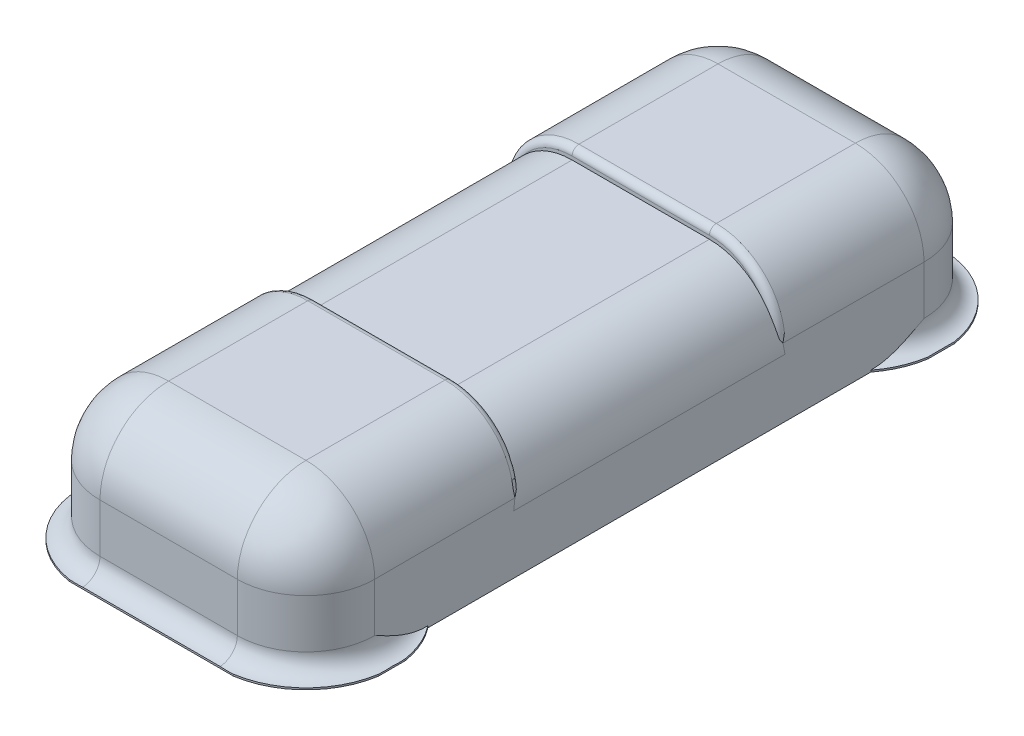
ISO-10303-21;
HEADER;
FILE_DESCRIPTION(('STEP AP214'),'2;1');
FILE_NAME('part.step','',(''),(''),'','','');
FILE_SCHEMA(('AUTOMOTIVE_DESIGN { 1 0 10303 214 1 1 1 1 }'));
ENDSEC;
DATA;
#1=APPLICATION_CONTEXT('core data for automotive mechanical design processes');
#2=APPLICATION_PROTOCOL_DEFINITION('international standard','automotive_design',2000,#1);
#3=PRODUCT_CONTEXT('',#1,'mechanical');
#4=PRODUCT('Part','Part','',(#3));
#5=PRODUCT_RELATED_PRODUCT_CATEGORY('part','',(#4));
#6=PRODUCT_DEFINITION_FORMATION('','',#4);
#7=PRODUCT_DEFINITION_CONTEXT('part definition',#1,'design');
#8=PRODUCT_DEFINITION('design','',#6,#7);
#9=PRODUCT_DEFINITION_SHAPE('','',#8);
#10=(LENGTH_UNIT() NAMED_UNIT(*) SI_UNIT(.MILLI.,.METRE.));
#11=(NAMED_UNIT(*) PLANE_ANGLE_UNIT() SI_UNIT($,.RADIAN.));
#12=(NAMED_UNIT(*) SI_UNIT($,.STERADIAN.) SOLID_ANGLE_UNIT());
#13=UNCERTAINTY_MEASURE_WITH_UNIT(LENGTH_MEASURE(1.E-05),#10,'distance_accuracy_value','');
#14=(GEOMETRIC_REPRESENTATION_CONTEXT(3) GLOBAL_UNCERTAINTY_ASSIGNED_CONTEXT((#13)) GLOBAL_UNIT_ASSIGNED_CONTEXT((#10,
#11,#12)) REPRESENTATION_CONTEXT('',''));
#15=CARTESIAN_POINT('',(0.,0.,0.));
#16=DIRECTION('',(0.,0.,1.));
#17=DIRECTION('',(1.,0.,0.));
#18=AXIS2_PLACEMENT_3D('',#15,#16,#17);
#19=CARTESIAN_POINT('',(1.2,2.031,8.905));
#20=DIRECTION('',(1.,0.,0.));
#21=DIRECTION('',(0.,0.,-1.));
#22=AXIS2_PLACEMENT_3D('',#19,#20,#21);
#23=CYLINDRICAL_SURFACE('',#22,0.02);
#24=DIRECTION('',(-1.,0.,0.));
#25=VECTOR('',#24,1.);
#26=CARTESIAN_POINT('',(1.,2.031,8.925));
#27=LINE('',#26,#25);
#28=CARTESIAN_POINT('',(1.2,2.03100000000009,8.925));
#29=VERTEX_POINT('',#28);
#30=CARTESIAN_POINT('',(1.6,2.031,8.925));
#31=VERTEX_POINT('',#30);
#32=EDGE_CURVE('E894',#29,#31,#27,.F.);
#33=ORIENTED_EDGE('',*,*,#32,.T.);
#34=CARTESIAN_POINT('',(1.6,2.031,8.905));
#35=DIRECTION('',(1.,0.,0.));
#36=DIRECTION('',(0.,1.,0.));
#37=AXIS2_PLACEMENT_3D('',#34,#35,#36);
#38=CIRCLE('',#37,0.02);
#39=CARTESIAN_POINT('',(1.6,2.051,8.905));
#40=VERTEX_POINT('',#39);
#41=EDGE_CURVE('E387',#40,#31,#38,.T.);
#42=ORIENTED_EDGE('',*,*,#41,.F.);
#43=DIRECTION('',(1.,0.,0.));
#44=VECTOR('',#43,1.);
#45=CARTESIAN_POINT('',(1.4,2.051,8.905));
#46=LINE('',#45,#44);
#47=CARTESIAN_POINT('',(1.2,2.051,8.905));
#48=VERTEX_POINT('',#47);
#49=EDGE_CURVE('E395',#48,#40,#46,.T.);
#50=ORIENTED_EDGE('',*,*,#49,.F.);
#51=CARTESIAN_POINT('',(1.2,2.031,8.905));
#52=DIRECTION('',(1.,0.,0.));
#53=DIRECTION('',(0.,1.,0.));
#54=AXIS2_PLACEMENT_3D('',#51,#52,#53);
#55=CIRCLE('',#54,0.02);
#56=EDGE_CURVE('E399',#29,#48,#55,.F.);
#57=ORIENTED_EDGE('',*,*,#56,.F.);
#58=EDGE_LOOP('',(#33,#42,#50,#57));
#59=FACE_BOUND('',#58,.T.);
#60=ADVANCED_FACE('F17',(#59),#23,.T.);
#61=CARTESIAN_POINT('',(1.6,2.031,9.695));
#62=DIRECTION('',(-1.,0.,0.));
#63=DIRECTION('',(0.,0.,1.));
#64=AXIS2_PLACEMENT_3D('',#61,#62,#63);
#65=CYLINDRICAL_SURFACE('',#64,0.02);
#66=DIRECTION('',(1.,0.,0.));
#67=VECTOR('',#66,1.);
#68=CARTESIAN_POINT('',(1.8,2.031,9.675));
#69=LINE('',#68,#67);
#70=CARTESIAN_POINT('',(1.6,2.03100000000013,9.675));
#71=VERTEX_POINT('',#70);
#72=CARTESIAN_POINT('',(1.2,2.031,9.675));
#73=VERTEX_POINT('',#72);
#74=EDGE_CURVE('E983',#71,#73,#69,.F.);
#75=ORIENTED_EDGE('',*,*,#74,.T.);
#76=CARTESIAN_POINT('',(1.2,2.031,9.695));
#77=DIRECTION('',(-1.,0.,0.));
#78=DIRECTION('',(0.,1.,0.));
#79=AXIS2_PLACEMENT_3D('',#76,#77,#78);
#80=CIRCLE('',#79,0.02);
#81=CARTESIAN_POINT('',(1.2,2.051,9.695));
#82=VERTEX_POINT('',#81);
#83=EDGE_CURVE('E345',#82,#73,#80,.T.);
#84=ORIENTED_EDGE('',*,*,#83,.F.);
#85=DIRECTION('',(1.,0.,0.));
#86=VECTOR('',#85,1.);
#87=CARTESIAN_POINT('',(1.4,2.051,9.695));
#88=LINE('',#87,#86);
#89=CARTESIAN_POINT('',(1.6,2.051,9.695));
#90=VERTEX_POINT('',#89);
#91=EDGE_CURVE('E835',#90,#82,#88,.F.);
#92=ORIENTED_EDGE('',*,*,#91,.F.);
#93=CARTESIAN_POINT('',(1.6,2.031,9.695));
#94=DIRECTION('',(-1.,0.,0.));
#95=DIRECTION('',(0.,1.,0.));
#96=AXIS2_PLACEMENT_3D('',#93,#94,#95);
#97=CIRCLE('',#96,0.02);
#98=EDGE_CURVE('E836',#71,#90,#97,.F.);
#99=ORIENTED_EDGE('',*,*,#98,.F.);
#100=EDGE_LOOP('',(#75,#84,#92,#99));
#101=FACE_BOUND('',#100,.T.);
#102=ADVANCED_FACE('F372',(#101),#65,.T.);
#103=CARTESIAN_POINT('',(1.2,1.851,10.1));
#104=DIRECTION('',(1.,0.,0.));
#105=DIRECTION('',(0.,0.,-1.));
#106=AXIS2_PLACEMENT_3D('',#103,#104,#105);
#107=CYLINDRICAL_SURFACE('',#106,0.2);
#108=DIRECTION('',(1.,0.,0.));
#109=VECTOR('',#108,1.);
#110=CARTESIAN_POINT('',(1.4,2.051,10.1));
#111=LINE('',#110,#109);
#112=CARTESIAN_POINT('',(1.2,2.051,10.1));
#113=VERTEX_POINT('',#112);
#114=CARTESIAN_POINT('',(1.6,2.051,10.1));
#115=VERTEX_POINT('',#114);
#116=EDGE_CURVE('E352',#113,#115,#111,.T.);
#117=ORIENTED_EDGE('',*,*,#116,.F.);
#118=CARTESIAN_POINT('',(1.2,1.99242135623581,10.2414213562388));
#119=CARTESIAN_POINT('',(1.19999960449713,1.99454777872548,10.2392950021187));
#120=CARTESIAN_POINT('',(1.19999088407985,1.99662614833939,10.2371206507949));
#121=CARTESIAN_POINT('',(1.19996540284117,2.00065374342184,10.2327122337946));
#122=CARTESIAN_POINT('',(1.19994875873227,2.00260439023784,10.2304794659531));
#123=CARTESIAN_POINT('',(1.19991567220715,2.00639050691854,10.2259461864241));
#124=CARTESIAN_POINT('',(1.19989922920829,2.00822671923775,10.2236462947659));
#125=CARTESIAN_POINT('',(1.19987120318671,2.01179500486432,10.2189688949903));
#126=CARTESIAN_POINT('',(1.19985961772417,2.01352713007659,10.2165914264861));
#127=CARTESIAN_POINT('',(1.19984361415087,2.01689498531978,10.2117478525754));
#128=CARTESIAN_POINT('',(1.19983923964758,2.01853007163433,10.2092812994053));
#129=CARTESIAN_POINT('',(1.19983792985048,2.02170815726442,10.2042480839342));
#130=CARTESIAN_POINT('',(1.19984108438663,2.02324981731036,10.2016805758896));
#131=CARTESIAN_POINT('',(1.19985364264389,2.02624186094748,10.1964341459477));
#132=CARTESIAN_POINT('',(1.19986315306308,2.02769021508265,10.1937540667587));
#133=CARTESIAN_POINT('',(1.1998862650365,2.03049299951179,10.1882719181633));
#134=CARTESIAN_POINT('',(1.19989995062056,2.03184472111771,10.1854684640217));
#135=CARTESIAN_POINT('',(1.19992877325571,2.03444825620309,10.1797302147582));
#136=CARTESIAN_POINT('',(1.19994393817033,2.03569669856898,10.1767938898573));
#137=CARTESIAN_POINT('',(1.19997304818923,2.03808454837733,10.1707822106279));
#138=CARTESIAN_POINT('',(1.19998694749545,2.03921994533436,10.1677052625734));
#139=CARTESIAN_POINT('',(1.20001123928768,2.04136969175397,10.1614066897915));
#140=CARTESIAN_POINT('',(1.20002151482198,2.04237942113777,10.1581834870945));
#141=CARTESIAN_POINT('',(1.20003703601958,2.04426324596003,10.1515891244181));
#142=CARTESIAN_POINT('',(1.20004211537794,2.04513214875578,10.148216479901));
#143=CARTESIAN_POINT('',(1.20004681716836,2.04671751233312,10.1413225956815));
#144=CARTESIAN_POINT('',(1.20004626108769,2.04742825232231,10.1378000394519));
#145=CARTESIAN_POINT('',(1.20004067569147,2.04867867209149,10.1306085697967));
#146=CARTESIAN_POINT('',(1.20003550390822,2.04921215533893,10.1269385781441));
#147=CARTESIAN_POINT('',(1.2000232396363,2.05008799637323,10.1194575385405));
#148=CARTESIAN_POINT('',(1.2000160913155,2.05042373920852,10.1156457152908));
#149=CARTESIAN_POINT('',(1.20000451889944,2.05088329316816,10.1078895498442));
#150=CARTESIAN_POINT('',(1.20000018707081,2.05100014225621,10.1039447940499));
#151=CARTESIAN_POINT('',(1.2,2.051,10.1));
#152=B_SPLINE_CURVE_WITH_KNOTS('',3,(#118,#119,#120,#121,#122,#123,#124,#125,#126,#127,#128,
#129,#130,#131,#132,#133,#134,#135,#136,#137,#138,#139,#140,#141,#142,#143,#144,#145,#146,#147,
#148,#149,#150,#151),.UNSPECIFIED.,.F.,.F.,(4,2,2,2,2,2,2,2,2,2,2,2,2,2,2,2,4),(0.,
0.00902066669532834,0.0179123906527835,0.0267386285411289,0.0355604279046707,0.0444353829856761,
0.0534167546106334,0.0625528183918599,0.0718864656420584,0.0814550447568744,0.09129040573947,
0.101419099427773,0.111862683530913,0.122638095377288,0.133758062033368,0.145231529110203,
0.157064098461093),.UNSPECIFIED.);
#153=CARTESIAN_POINT('',(1.2,1.99242135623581,10.2414213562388));
#154=VERTEX_POINT('',#153);
#155=EDGE_CURVE('E336',#154,#113,#152,.T.);
#156=ORIENTED_EDGE('',*,*,#155,.F.);
#157=CARTESIAN_POINT('',(1.2,1.851,10.3));
#158=CARTESIAN_POINT('',(1.20000018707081,1.85494479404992,10.3000001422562));
#159=CARTESIAN_POINT('',(1.20000451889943,1.85888954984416,10.2998832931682));
#160=CARTESIAN_POINT('',(1.20001609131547,1.86664571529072,10.2994237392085));
#161=CARTESIAN_POINT('',(1.20002323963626,1.87045753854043,10.2990879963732));
#162=CARTESIAN_POINT('',(1.20003550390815,1.87793857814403,10.2982121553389));
#163=CARTESIAN_POINT('',(1.20004067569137,1.88160856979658,10.2976786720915));
#164=CARTESIAN_POINT('',(1.20004626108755,1.88880003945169,10.2964282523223));
#165=CARTESIAN_POINT('',(1.20004681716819,1.89232259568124,10.2957175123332));
#166=CARTESIAN_POINT('',(1.20004211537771,1.89921647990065,10.2941321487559));
#167=CARTESIAN_POINT('',(1.20003703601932,1.90258912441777,10.2932632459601));
#168=CARTESIAN_POINT('',(1.20002151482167,1.90918348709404,10.2913794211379));
#169=CARTESIAN_POINT('',(1.20001123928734,1.912406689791,10.2903696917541));
#170=CARTESIAN_POINT('',(1.19998694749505,1.91870526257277,10.2882199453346));
#171=CARTESIAN_POINT('',(1.1999730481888,1.92178221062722,10.2870845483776));
#172=CARTESIAN_POINT('',(1.19994393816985,1.9277938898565,10.2846966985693));
#173=CARTESIAN_POINT('',(1.1999287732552,1.93073021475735,10.2834482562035));
#174=CARTESIAN_POINT('',(1.19989995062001,1.93646846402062,10.2808447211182));
#175=CARTESIAN_POINT('',(1.19988626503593,1.93927191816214,10.2794929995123));
#176=CARTESIAN_POINT('',(1.19986315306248,1.9447540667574,10.2766902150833));
#177=CARTESIAN_POINT('',(1.19985364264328,1.94743414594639,10.2752418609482));
#178=CARTESIAN_POINT('',(1.19984108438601,1.95268057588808,10.2722498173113));
#179=CARTESIAN_POINT('',(1.19983792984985,1.95524808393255,10.2707081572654));
#180=CARTESIAN_POINT('',(1.19983923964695,1.96028129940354,10.2675300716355));
#181=CARTESIAN_POINT('',(1.19984361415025,1.96274785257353,10.265894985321));
#182=CARTESIAN_POINT('',(1.19985961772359,1.96759142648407,10.2625271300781));
#183=CARTESIAN_POINT('',(1.19987120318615,1.96996889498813,10.2607950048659));
#184=CARTESIAN_POINT('',(1.19989922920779,1.97464629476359,10.2572267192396));
#185=CARTESIAN_POINT('',(1.1999156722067,1.97694618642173,10.2553905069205));
#186=CARTESIAN_POINT('',(1.19994875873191,1.98147946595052,10.2516043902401));
#187=CARTESIAN_POINT('',(1.19996540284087,1.98371223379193,10.2496537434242));
#188=CARTESIAN_POINT('',(1.19999088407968,1.98812065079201,10.2456261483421));
#189=CARTESIAN_POINT('',(1.19999960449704,1.99029500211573,10.2435477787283));
#190=CARTESIAN_POINT('',(1.2,1.99242135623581,10.2414213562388));
#191=B_SPLINE_CURVE_WITH_KNOTS('',3,(#157,#158,#159,#160,#161,#162,#163,#164,#165,#166,#167,
#168,#169,#170,#171,#172,#173,#174,#175,#176,#177,#178,#179,#180,#181,#182,#183,#184,#185,#186,
#187,#188,#189,#190),.UNSPECIFIED.,.F.,.F.,(4,2,2,2,2,2,2,2,2,2,2,2,2,2,2,2,4),(0.,
0.0118325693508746,0.0233060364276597,0.0344260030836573,0.0452014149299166,0.0556449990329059,
0.0657736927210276,0.0756090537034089,0.0851776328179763,0.0945112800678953,0.103647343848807,
0.112628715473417,0.121503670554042,0.13032546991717,0.139151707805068,0.148043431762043,
0.157064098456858),.UNSPECIFIED.);
#192=CARTESIAN_POINT('',(1.2,1.851,10.3));
#193=VERTEX_POINT('',#192);
#194=EDGE_CURVE('E331',#193,#154,#191,.T.);
#195=ORIENTED_EDGE('',*,*,#194,.F.);
#196=DIRECTION('',(1.,0.,0.));
#197=VECTOR('',#196,1.);
#198=CARTESIAN_POINT('',(1.,1.851,10.3));
#199=LINE('',#198,#197);
#200=CARTESIAN_POINT('',(1.6,1.851,10.3));
#201=VERTEX_POINT('',#200);
#202=EDGE_CURVE('E1131',#201,#193,#199,.F.);
#203=ORIENTED_EDGE('',*,*,#202,.F.);
#204=CARTESIAN_POINT('',(1.6,1.99242135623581,10.2414213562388));
#205=CARTESIAN_POINT('',(1.60000068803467,1.9901309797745,10.2437118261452));
#206=CARTESIAN_POINT('',(1.60000634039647,1.98778488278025,10.2459465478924));
#207=CARTESIAN_POINT('',(1.60002039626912,1.9830111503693,10.2502775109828));
#208=CARTESIAN_POINT('',(1.60002877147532,1.98058457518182,10.2523749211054));
#209=CARTESIAN_POINT('',(1.60004138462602,1.97563707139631,10.2564475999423));
#210=CARTESIAN_POINT('',(1.60004562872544,1.97311628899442,10.2584230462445));
#211=CARTESIAN_POINT('',(1.60004817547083,1.96796530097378,10.2622636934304));
#212=CARTESIAN_POINT('',(1.60004643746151,1.96533446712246,10.264128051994));
#213=CARTESIAN_POINT('',(1.60003822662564,1.95994717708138,10.2677534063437));
#214=CARTESIAN_POINT('',(1.60003168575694,1.95718945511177,10.2695125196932));
#215=CARTESIAN_POINT('',(1.60001785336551,1.95153170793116,10.2729292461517));
#216=CARTESIAN_POINT('',(1.60001054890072,1.94862990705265,10.2745839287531));
#217=CARTESIAN_POINT('',(1.60000406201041,1.94482474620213,10.2766292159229));
#218=CARTESIAN_POINT('',(1.60000278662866,1.94395722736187,10.27708731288));
#219=CARTESIAN_POINT('',(1.60000102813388,1.94220851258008,10.2779943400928));
#220=CARTESIAN_POINT('',(1.60000055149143,1.94132726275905,10.2784431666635));
#221=CARTESIAN_POINT('',(1.59999883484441,1.93859442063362,10.2798095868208));
#222=CARTESIAN_POINT('',(1.59999732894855,1.93673173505,10.2807051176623));
#223=CARTESIAN_POINT('',(1.59999215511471,1.93294878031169,10.2824522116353));
#224=CARTESIAN_POINT('',(1.59998845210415,1.93102806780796,10.2833028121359));
#225=CARTESIAN_POINT('',(1.59997864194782,1.92631580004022,10.2853014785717));
#226=CARTESIAN_POINT('',(1.59997219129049,1.92351042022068,10.2864171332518));
#227=CARTESIAN_POINT('',(1.59995981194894,1.91777528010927,10.2885488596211));
#228=CARTESIAN_POINT('',(1.59995390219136,1.91484421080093,10.2895614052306));
#229=CARTESIAN_POINT('',(1.59994447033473,1.9088535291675,10.2914762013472));
#230=CARTESIAN_POINT('',(1.59994102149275,1.90579263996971,10.2923744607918));
#231=CARTESIAN_POINT('',(1.5999376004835,1.89954017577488,10.2940480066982));
#232=CARTESIAN_POINT('',(1.5999377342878,1.89634741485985,10.2948188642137));
#233=CARTESIAN_POINT('',(1.599941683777,1.88983114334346,10.2962232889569));
#234=CARTESIAN_POINT('',(1.59994561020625,1.88650659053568,10.2968520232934));
#235=CARTESIAN_POINT('',(1.59995620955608,1.87972895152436,10.2979565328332));
#236=CARTESIAN_POINT('',(1.59996296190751,1.87627501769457,10.2984271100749));
#237=CARTESIAN_POINT('',(1.59997704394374,1.86924323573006,10.2991985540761));
#238=CARTESIAN_POINT('',(1.59998438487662,1.86566478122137,10.2994939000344));
#239=CARTESIAN_POINT('',(1.59999583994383,1.85839110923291,10.2998975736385));
#240=CARTESIAN_POINT('',(1.59999985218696,1.85469556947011,10.3000001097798));
#241=CARTESIAN_POINT('',(1.6,1.851,10.3));
#242=B_SPLINE_CURVE_WITH_KNOTS('',3,(#204,#205,#206,#207,#208,#209,#210,#211,#212,#213,#214,
#215,#216,#217,#218,#219,#220,#221,#222,#223,#224,#225,#226,#227,#228,#229,#230,#231,#232,#233,
#234,#235,#236,#237,#238,#239,#240,#241),.UNSPECIFIED.,.F.,.F.,(4,2,2,2,2,2,2,2,2,2,2,2,2,2,2,2,
2,2,4),(0.,0.00971645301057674,0.0193349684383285,0.0289391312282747,0.0386086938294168,
0.0484179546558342,0.0584345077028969,0.0613775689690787,0.0643443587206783,0.0705435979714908,
0.0768445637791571,0.0858985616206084,0.0951983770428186,0.104764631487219,0.114614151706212,
0.124760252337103,0.135213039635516,0.145979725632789,0.157064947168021),.UNSPECIFIED.);
#243=CARTESIAN_POINT('',(1.6,1.99242135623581,10.2414213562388));
#244=VERTEX_POINT('',#243);
#245=EDGE_CURVE('E1980',#244,#201,#242,.T.);
#246=ORIENTED_EDGE('',*,*,#245,.F.);
#247=CARTESIAN_POINT('',(1.6,2.051,10.1));
#248=CARTESIAN_POINT('',(1.59999981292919,2.05100014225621,10.1039447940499));
#249=CARTESIAN_POINT('',(1.59999548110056,2.05088329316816,10.1078895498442));
#250=CARTESIAN_POINT('',(1.5999839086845,2.05042373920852,10.1156457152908));
#251=CARTESIAN_POINT('',(1.5999767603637,2.05008799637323,10.1194575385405));
#252=CARTESIAN_POINT('',(1.59996449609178,2.04921215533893,10.1269385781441));
#253=CARTESIAN_POINT('',(1.59995932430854,2.04867867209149,10.1306085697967));
#254=CARTESIAN_POINT('',(1.59995373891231,2.04742825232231,10.1378000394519));
#255=CARTESIAN_POINT('',(1.59995318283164,2.04671751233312,10.1413225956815));
#256=CARTESIAN_POINT('',(1.59995788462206,2.04513214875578,10.148216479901));
#257=CARTESIAN_POINT('',(1.59996296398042,2.04426324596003,10.1515891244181));
#258=CARTESIAN_POINT('',(1.59997848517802,2.04237942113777,10.1581834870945));
#259=CARTESIAN_POINT('',(1.59998876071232,2.04136969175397,10.1614066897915));
#260=CARTESIAN_POINT('',(1.60001305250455,2.03921994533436,10.1677052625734));
#261=CARTESIAN_POINT('',(1.60002695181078,2.03808454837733,10.1707822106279));
#262=CARTESIAN_POINT('',(1.60005606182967,2.03569669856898,10.1767938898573));
#263=CARTESIAN_POINT('',(1.60007122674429,2.03444825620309,10.1797302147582));
#264=CARTESIAN_POINT('',(1.60010004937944,2.03184472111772,10.1854684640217));
#265=CARTESIAN_POINT('',(1.6001137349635,2.03049299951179,10.1882719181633));
#266=CARTESIAN_POINT('',(1.60013684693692,2.02769021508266,10.1937540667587));
#267=CARTESIAN_POINT('',(1.60014635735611,2.02624186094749,10.1964341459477));
#268=CARTESIAN_POINT('',(1.60015891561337,2.02324981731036,10.2016805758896));
#269=CARTESIAN_POINT('',(1.60016207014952,2.02170815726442,10.2042480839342));
#270=CARTESIAN_POINT('',(1.60016076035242,2.01853007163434,10.2092812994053));
#271=CARTESIAN_POINT('',(1.60015638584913,2.01689498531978,10.2117478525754));
#272=CARTESIAN_POINT('',(1.60014038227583,2.01352713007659,10.2165914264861));
#273=CARTESIAN_POINT('',(1.60012879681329,2.01179500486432,10.2189688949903));
#274=CARTESIAN_POINT('',(1.60010077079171,2.00822671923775,10.2236462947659));
#275=CARTESIAN_POINT('',(1.60008432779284,2.00639050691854,10.2259461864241));
#276=CARTESIAN_POINT('',(1.60005124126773,2.00260439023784,10.2304794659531));
#277=CARTESIAN_POINT('',(1.60003459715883,2.00065374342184,10.2327122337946));
#278=CARTESIAN_POINT('',(1.60000911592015,1.99662614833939,10.2371206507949));
#279=CARTESIAN_POINT('',(1.60000039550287,1.99454777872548,10.2392950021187));
#280=CARTESIAN_POINT('',(1.6,1.99242135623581,10.2414213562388));
#281=B_SPLINE_CURVE_WITH_KNOTS('',3,(#247,#248,#249,#250,#251,#252,#253,#254,#255,#256,#257,
#258,#259,#260,#261,#262,#263,#264,#265,#266,#267,#268,#269,#270,#271,#272,#273,#274,#275,#276,
#277,#278,#279,#280),.UNSPECIFIED.,.F.,.F.,(4,2,2,2,2,2,2,2,2,2,2,2,2,2,2,2,4),(0.,
0.0118325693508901,0.0233060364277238,0.0344260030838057,0.0452014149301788,0.0556449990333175,
0.0657736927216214,0.0756090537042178,0.0851776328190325,0.094511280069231,0.103647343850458,
0.112628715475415,0.121503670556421,0.130325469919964,0.139151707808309,0.148043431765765,
0.157064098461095),.UNSPECIFIED.);
#282=EDGE_CURVE('E841',#115,#244,#281,.T.);
#283=ORIENTED_EDGE('',*,*,#282,.F.);
#284=EDGE_LOOP('',(#117,#156,#195,#203,#246,#283));
#285=FACE_BOUND('',#284,.T.);
#286=ADVANCED_FACE('F350',(#285),#107,.T.);
#287=CARTESIAN_POINT('',(1.6,1.851,8.5));
#288=DIRECTION('',(-1.,0.,0.));
#289=DIRECTION('',(0.,0.,1.));
#290=AXIS2_PLACEMENT_3D('',#287,#288,#289);
#291=CYLINDRICAL_SURFACE('',#290,0.2);
#292=DIRECTION('',(1.,0.,0.));
#293=VECTOR('',#292,1.);
#294=CARTESIAN_POINT('',(1.4,2.051,8.5));
#295=LINE('',#294,#293);
#296=CARTESIAN_POINT('',(1.6,2.051,8.5));
#297=VERTEX_POINT('',#296);
#298=CARTESIAN_POINT('',(1.2,2.051,8.5));
#299=VERTEX_POINT('',#298);
#300=EDGE_CURVE('E450',#297,#299,#295,.F.);
#301=ORIENTED_EDGE('',*,*,#300,.F.);
#302=CARTESIAN_POINT('',(1.6,1.99242135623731,8.35857864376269));
#303=CARTESIAN_POINT('',(1.60000039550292,1.99454777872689,8.36070499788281));
#304=CARTESIAN_POINT('',(1.60000911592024,1.99662614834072,8.36287934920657));
#305=CARTESIAN_POINT('',(1.60003459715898,2.00065374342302,8.36728776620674));
#306=CARTESIAN_POINT('',(1.60005124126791,2.00260439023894,8.36952053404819));
#307=CARTESIAN_POINT('',(1.60008432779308,2.00639050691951,8.37405381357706));
#308=CARTESIAN_POINT('',(1.60010077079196,2.00822671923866,8.37635370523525));
#309=CARTESIAN_POINT('',(1.60012879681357,2.01179500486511,8.3810311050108));
#310=CARTESIAN_POINT('',(1.60014038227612,2.01352713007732,8.3834085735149));
#311=CARTESIAN_POINT('',(1.60015638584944,2.01689498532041,8.38825214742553));
#312=CARTESIAN_POINT('',(1.60016076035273,2.01853007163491,8.39071870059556));
#313=CARTESIAN_POINT('',(1.60016207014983,2.02170815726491,8.39575191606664));
#314=CARTESIAN_POINT('',(1.60015891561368,2.02324981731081,8.39831942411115));
#315=CARTESIAN_POINT('',(1.60014635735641,2.02624186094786,8.40356585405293));
#316=CARTESIAN_POINT('',(1.60013684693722,2.02769021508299,8.40624593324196));
#317=CARTESIAN_POINT('',(1.60011373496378,2.03049299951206,8.4117280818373));
#318=CARTESIAN_POINT('',(1.60010004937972,2.03184472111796,8.41453153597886));
#319=CARTESIAN_POINT('',(1.60007122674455,2.03444825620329,8.4202697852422));
#320=CARTESIAN_POINT('',(1.60005606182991,2.03569669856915,8.42320611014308));
#321=CARTESIAN_POINT('',(1.60002695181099,2.03808454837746,8.42921778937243));
#322=CARTESIAN_POINT('',(1.60001305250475,2.03921994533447,8.43229473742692));
#323=CARTESIAN_POINT('',(1.59998876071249,2.04136969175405,8.43859331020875));
#324=CARTESIAN_POINT('',(1.59997848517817,2.04237942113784,8.44181651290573));
#325=CARTESIAN_POINT('',(1.59996296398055,2.04426324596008,8.44841087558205));
#326=CARTESIAN_POINT('',(1.59995788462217,2.04513214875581,8.45178352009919));
#327=CARTESIAN_POINT('',(1.59995318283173,2.04671751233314,8.45867740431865));
#328=CARTESIAN_POINT('',(1.59995373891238,2.04742825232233,8.46219996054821));
#329=CARTESIAN_POINT('',(1.59995932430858,2.0486786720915,8.46939143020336));
#330=CARTESIAN_POINT('',(1.59996449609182,2.04921215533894,8.47306142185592));
#331=CARTESIAN_POINT('',(1.59997676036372,2.05008799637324,8.48054246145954));
#332=CARTESIAN_POINT('',(1.59998390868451,2.05042373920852,8.48435428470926));
#333=CARTESIAN_POINT('',(1.59999548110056,2.05088329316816,8.49211045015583));
#334=CARTESIAN_POINT('',(1.59999981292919,2.05100014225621,8.49605520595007));
#335=CARTESIAN_POINT('',(1.6,2.051,8.5));
#336=B_SPLINE_CURVE_WITH_KNOTS('',3,(#302,#303,#304,#305,#306,#307,#308,#309,#310,#311,#312,
#313,#314,#315,#316,#317,#318,#319,#320,#321,#322,#323,#324,#325,#326,#327,#328,#329,#330,#331,
#332,#333,#334,#335),.UNSPECIFIED.,.F.,.F.,(4,2,2,2,2,2,2,2,2,2,2,2,2,2,2,2,4),(0.,
0.00902066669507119,0.0179123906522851,0.0267386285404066,0.0355604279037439,0.0444353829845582,
0.0534167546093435,0.0625528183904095,0.0718864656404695,0.081455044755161,0.0912904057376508,
0.10141909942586,0.111862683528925,0.122638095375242,0.133758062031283,0.145231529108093,
0.157064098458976),.UNSPECIFIED.);
#337=CARTESIAN_POINT('',(1.6,1.99242135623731,8.35857864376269));
#338=VERTEX_POINT('',#337);
#339=EDGE_CURVE('E419',#338,#297,#336,.T.);
#340=ORIENTED_EDGE('',*,*,#339,.F.);
#341=CARTESIAN_POINT('',(1.6,1.851,8.3));
#342=CARTESIAN_POINT('',(1.59999981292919,1.85494479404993,8.2999998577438));
#343=CARTESIAN_POINT('',(1.59999548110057,1.85888954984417,8.30011670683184));
#344=CARTESIAN_POINT('',(1.59998390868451,1.86664571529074,8.30057626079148));
#345=CARTESIAN_POINT('',(1.59997676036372,1.87045753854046,8.30091200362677));
#346=CARTESIAN_POINT('',(1.59996449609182,1.87793857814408,8.30178784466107));
#347=CARTESIAN_POINT('',(1.59995932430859,1.88160856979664,8.3023213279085));
#348=CARTESIAN_POINT('',(1.59995373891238,1.88880003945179,8.30357174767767));
#349=CARTESIAN_POINT('',(1.59995318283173,1.89232259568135,8.30428248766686));
#350=CARTESIAN_POINT('',(1.59995788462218,1.89921647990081,8.30586785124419));
#351=CARTESIAN_POINT('',(1.59996296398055,1.90258912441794,8.30673675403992));
#352=CARTESIAN_POINT('',(1.59997848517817,1.90918348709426,8.30862057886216));
#353=CARTESIAN_POINT('',(1.59998876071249,1.91240668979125,8.30963030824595));
#354=CARTESIAN_POINT('',(1.60001305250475,1.91870526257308,8.31178005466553));
#355=CARTESIAN_POINT('',(1.60002695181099,1.92178221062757,8.31291545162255));
#356=CARTESIAN_POINT('',(1.60005606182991,1.92779388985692,8.31530330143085));
#357=CARTESIAN_POINT('',(1.60007122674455,1.9307302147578,8.31655174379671));
#358=CARTESIAN_POINT('',(1.60010004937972,1.93646846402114,8.31915527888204));
#359=CARTESIAN_POINT('',(1.60011373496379,1.93927191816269,8.32050700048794));
#360=CARTESIAN_POINT('',(1.60013684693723,1.94475406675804,8.32330978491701));
#361=CARTESIAN_POINT('',(1.60014635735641,1.94743414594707,8.32475813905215));
#362=CARTESIAN_POINT('',(1.60015891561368,1.95268057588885,8.32775018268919));
#363=CARTESIAN_POINT('',(1.60016207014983,1.95524808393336,8.32929184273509));
#364=CARTESIAN_POINT('',(1.60016076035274,1.96028129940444,8.33246992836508));
#365=CARTESIAN_POINT('',(1.60015638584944,1.96274785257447,8.33410501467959));
#366=CARTESIAN_POINT('',(1.60014038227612,1.9675914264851,8.33747286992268));
#367=CARTESIAN_POINT('',(1.60012879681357,1.9699688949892,8.33920499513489));
#368=CARTESIAN_POINT('',(1.60010077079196,1.97464629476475,8.34277328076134));
#369=CARTESIAN_POINT('',(1.60008432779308,1.97694618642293,8.34460949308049));
#370=CARTESIAN_POINT('',(1.60005124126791,1.98147946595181,8.34839560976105));
#371=CARTESIAN_POINT('',(1.60003459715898,1.98371223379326,8.35034625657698));
#372=CARTESIAN_POINT('',(1.60000911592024,1.98812065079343,8.35437385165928));
#373=CARTESIAN_POINT('',(1.60000039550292,1.99029500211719,8.35645222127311));
#374=CARTESIAN_POINT('',(1.6,1.99242135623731,8.35857864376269));
#375=B_SPLINE_CURVE_WITH_KNOTS('',3,(#341,#342,#343,#344,#345,#346,#347,#348,#349,#350,#351,
#352,#353,#354,#355,#356,#357,#358,#359,#360,#361,#362,#363,#364,#365,#366,#367,#368,#369,#370,
#371,#372,#373,#374),.UNSPECIFIED.,.F.,.F.,(4,2,2,2,2,2,2,2,2,2,2,2,2,2,2,2,4),(0.,
0.0118325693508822,0.0233060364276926,0.0344260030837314,0.0452014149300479,0.0556449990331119,
0.0657736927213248,0.0756090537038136,0.0851776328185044,0.0945112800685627,0.103647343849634,
0.112628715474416,0.121503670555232,0.130325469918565,0.139151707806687,0.148043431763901,
0.157064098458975),.UNSPECIFIED.);
#376=CARTESIAN_POINT('',(1.6,1.851,8.3));
#377=VERTEX_POINT('',#376);
#378=EDGE_CURVE('E407',#377,#338,#375,.T.);
#379=ORIENTED_EDGE('',*,*,#378,.F.);
#380=DIRECTION('',(-1.,0.,0.));
#381=VECTOR('',#380,1.);
#382=CARTESIAN_POINT('',(1.8,1.851,8.3));
#383=LINE('',#382,#381);
#384=CARTESIAN_POINT('',(1.2,1.851,8.3));
#385=VERTEX_POINT('',#384);
#386=EDGE_CURVE('E1123',#385,#377,#383,.F.);
#387=ORIENTED_EDGE('',*,*,#386,.F.);
#388=CARTESIAN_POINT('',(1.2,1.99242135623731,8.35857864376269));
#389=CARTESIAN_POINT('',(1.19999931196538,1.9901309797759,8.35628817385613));
#390=CARTESIAN_POINT('',(1.19999365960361,1.98778488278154,8.35405345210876));
#391=CARTESIAN_POINT('',(1.19997960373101,1.98301115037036,8.34972248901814));
#392=CARTESIAN_POINT('',(1.19997122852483,1.98058457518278,8.34762507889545));
#393=CARTESIAN_POINT('',(1.19995861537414,1.97563707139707,8.34355240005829));
#394=CARTESIAN_POINT('',(1.19995437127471,1.97311628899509,8.34157695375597));
#395=CARTESIAN_POINT('',(1.19995182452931,1.96796530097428,8.33773630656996));
#396=CARTESIAN_POINT('',(1.19995356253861,1.96533446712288,8.33587194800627));
#397=CARTESIAN_POINT('',(1.19996177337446,1.95994717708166,8.3322465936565));
#398=CARTESIAN_POINT('',(1.19996831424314,1.95718945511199,8.33048748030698));
#399=CARTESIAN_POINT('',(1.19998214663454,1.95153170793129,8.32707075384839));
#400=CARTESIAN_POINT('',(1.19998945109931,1.94862990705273,8.32541607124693));
#401=CARTESIAN_POINT('',(1.1999959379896,1.94482474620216,8.32337078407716));
#402=CARTESIAN_POINT('',(1.19999721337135,1.94395722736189,8.32291268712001));
#403=CARTESIAN_POINT('',(1.19999897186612,1.94220851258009,8.32200565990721));
#404=CARTESIAN_POINT('',(1.19999944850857,1.94132726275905,8.32155683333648));
#405=CARTESIAN_POINT('',(1.20000116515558,1.93859442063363,8.32019041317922));
#406=CARTESIAN_POINT('',(1.20000267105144,1.93673173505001,8.31929488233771));
#407=CARTESIAN_POINT('',(1.20000784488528,1.93294878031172,8.31754778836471));
#408=CARTESIAN_POINT('',(1.20001154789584,1.931028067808,8.31669718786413));
#409=CARTESIAN_POINT('',(1.20002135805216,1.92631580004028,8.31469852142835));
#410=CARTESIAN_POINT('',(1.20002780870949,1.92351042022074,8.31358286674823));
#411=CARTESIAN_POINT('',(1.20004018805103,1.91777528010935,8.31145114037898));
#412=CARTESIAN_POINT('',(1.20004609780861,1.91484421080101,8.31043859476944));
#413=CARTESIAN_POINT('',(1.20005552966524,1.9088535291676,8.30852379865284));
#414=CARTESIAN_POINT('',(1.20005897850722,1.90579263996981,8.30762553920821));
#415=CARTESIAN_POINT('',(1.20006239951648,1.89954017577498,8.30595199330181));
#416=CARTESIAN_POINT('',(1.20006226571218,1.89634741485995,8.30518113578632));
#417=CARTESIAN_POINT('',(1.20005831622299,1.88983114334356,8.30377671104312));
#418=CARTESIAN_POINT('',(1.20005438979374,1.88650659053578,8.30314797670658));
#419=CARTESIAN_POINT('',(1.20004379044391,1.87972895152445,8.30204346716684));
#420=CARTESIAN_POINT('',(1.20003703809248,1.87627501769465,8.30157288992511));
#421=CARTESIAN_POINT('',(1.20002295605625,1.86924323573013,8.30080144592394));
#422=CARTESIAN_POINT('',(1.20001561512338,1.86566478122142,8.30050609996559));
#423=CARTESIAN_POINT('',(1.20000416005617,1.85839110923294,8.30010242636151));
#424=CARTESIAN_POINT('',(1.20000014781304,1.85469556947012,8.29999989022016));
#425=CARTESIAN_POINT('',(1.2,1.851,8.3));
#426=B_SPLINE_CURVE_WITH_KNOTS('',3,(#388,#389,#390,#391,#392,#393,#394,#395,#396,#397,#398,
#399,#400,#401,#402,#403,#404,#405,#406,#407,#408,#409,#410,#411,#412,#413,#414,#415,#416,#417,
#418,#419,#420,#421,#422,#423,#424,#425),.UNSPECIFIED.,.F.,.F.,(4,2,2,2,2,2,2,2,2,2,2,2,2,2,2,2,
2,2,4),(0.,0.00971645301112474,0.0193349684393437,0.0289391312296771,0.0386086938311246,
0.0484179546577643,0.0584345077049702,0.061377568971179,0.0643443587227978,0.0705435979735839,
0.0768445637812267,0.0858985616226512,0.0951983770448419,0.104764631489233,0.114614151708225,
0.124760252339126,0.135213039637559,0.145979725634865,0.157064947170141),.UNSPECIFIED.);
#427=CARTESIAN_POINT('',(1.2,1.99242135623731,8.35857864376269));
#428=VERTEX_POINT('',#427);
#429=EDGE_CURVE('E431',#428,#385,#426,.T.);
#430=ORIENTED_EDGE('',*,*,#429,.F.);
#431=CARTESIAN_POINT('',(1.2,2.051,8.5));
#432=CARTESIAN_POINT('',(1.20000018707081,2.05100014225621,8.49605520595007));
#433=CARTESIAN_POINT('',(1.20000451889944,2.05088329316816,8.49211045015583));
#434=CARTESIAN_POINT('',(1.20001609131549,2.05042373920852,8.48435428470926));
#435=CARTESIAN_POINT('',(1.20002323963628,2.05008799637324,8.48054246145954));
#436=CARTESIAN_POINT('',(1.20003550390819,2.04921215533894,8.47306142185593));
#437=CARTESIAN_POINT('',(1.20004067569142,2.04867867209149,8.46939143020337));
#438=CARTESIAN_POINT('',(1.20004626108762,2.04742825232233,8.46219996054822));
#439=CARTESIAN_POINT('',(1.20004681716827,2.04671751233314,8.45867740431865));
#440=CARTESIAN_POINT('',(1.20004211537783,2.04513214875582,8.4517835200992));
#441=CARTESIAN_POINT('',(1.20003703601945,2.04426324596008,8.44841087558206));
#442=CARTESIAN_POINT('',(1.20002151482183,2.04237942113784,8.44181651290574));
#443=CARTESIAN_POINT('',(1.20001123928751,2.04136969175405,8.43859331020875));
#444=CARTESIAN_POINT('',(1.19998694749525,2.03921994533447,8.43229473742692));
#445=CARTESIAN_POINT('',(1.19997304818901,2.03808454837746,8.42921778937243));
#446=CARTESIAN_POINT('',(1.19994393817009,2.03569669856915,8.42320611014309));
#447=CARTESIAN_POINT('',(1.19992877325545,2.03444825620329,8.4202697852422));
#448=CARTESIAN_POINT('',(1.19989995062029,2.03184472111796,8.41453153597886));
#449=CARTESIAN_POINT('',(1.19988626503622,2.03049299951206,8.41172808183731));
#450=CARTESIAN_POINT('',(1.19986315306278,2.02769021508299,8.40624593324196));
#451=CARTESIAN_POINT('',(1.19985364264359,2.02624186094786,8.40356585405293));
#452=CARTESIAN_POINT('',(1.19984108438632,2.02324981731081,8.39831942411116));
#453=CARTESIAN_POINT('',(1.19983792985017,2.02170815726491,8.39575191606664));
#454=CARTESIAN_POINT('',(1.19983923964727,2.01853007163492,8.39071870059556));
#455=CARTESIAN_POINT('',(1.19984361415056,2.01689498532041,8.38825214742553));
#456=CARTESIAN_POINT('',(1.19985961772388,2.01352713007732,8.3834085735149));
#457=CARTESIAN_POINT('',(1.19987120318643,2.01179500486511,8.3810311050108));
#458=CARTESIAN_POINT('',(1.19989922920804,2.00822671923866,8.37635370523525));
#459=CARTESIAN_POINT('',(1.19991567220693,2.00639050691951,8.37405381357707));
#460=CARTESIAN_POINT('',(1.19994875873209,2.00260439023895,8.36952053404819));
#461=CARTESIAN_POINT('',(1.19996540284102,2.00065374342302,8.36728776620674));
#462=CARTESIAN_POINT('',(1.19999088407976,1.99662614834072,8.36287934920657));
#463=CARTESIAN_POINT('',(1.19999960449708,1.99454777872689,8.36070499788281));
#464=CARTESIAN_POINT('',(1.2,1.99242135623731,8.35857864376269));
#465=B_SPLINE_CURVE_WITH_KNOTS('',3,(#431,#432,#433,#434,#435,#436,#437,#438,#439,#440,#441,
#442,#443,#444,#445,#446,#447,#448,#449,#450,#451,#452,#453,#454,#455,#456,#457,#458,#459,#460,
#461,#462,#463,#464),.UNSPECIFIED.,.F.,.F.,(4,2,2,2,2,2,2,2,2,2,2,2,2,2,2,2,4),(0.,
0.0118325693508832,0.0233060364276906,0.03442600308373,0.0452014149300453,0.05564499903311,
0.0657736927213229,0.0756090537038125,0.0851776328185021,0.0945112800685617,0.10364734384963,
0.112628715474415,0.12150367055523,0.130325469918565,0.139151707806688,0.148043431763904,
0.157064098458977),.UNSPECIFIED.);
#466=EDGE_CURVE('E441',#299,#428,#465,.T.);
#467=ORIENTED_EDGE('',*,*,#466,.F.);
#468=EDGE_LOOP('',(#301,#340,#379,#387,#430,#467));
#469=FACE_BOUND('',#468,.T.);
#470=ADVANCED_FACE('F371',(#469),#291,.T.);
#471=CARTESIAN_POINT('',(1.2,1.851,10.1));
#472=DIRECTION('',(-0.577350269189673,0.577350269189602,0.577350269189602));
#473=DIRECTION('',(0.,0.707106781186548,-0.707106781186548));
#474=AXIS2_PLACEMENT_3D('',#471,#472,#473);
#475=SPHERICAL_SURFACE('',#474,0.2);
#476=CARTESIAN_POINT('',(1.08452994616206,1.96647005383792,10.2154700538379));
#477=VERTEX_POINT('',#476);
#478=VERTEX_LOOP('',#477);
#479=FACE_BOUND('',#478,.T.);
#480=CARTESIAN_POINT('',(1.05857864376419,1.851,10.2414213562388));
#481=CARTESIAN_POINT('',(1.06070499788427,1.85100039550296,10.2435477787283));
#482=CARTESIAN_POINT('',(1.06287934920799,1.85100911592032,10.2456261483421));
#483=CARTESIAN_POINT('',(1.06728776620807,1.85103459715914,10.2496537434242));
#484=CARTESIAN_POINT('',(1.06952053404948,1.85105124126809,10.2516043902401));
#485=CARTESIAN_POINT('',(1.07405381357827,1.85108432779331,10.2553905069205));
#486=CARTESIAN_POINT('',(1.07635370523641,1.85110077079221,10.2572267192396));
#487=CARTESIAN_POINT('',(1.08103110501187,1.85112879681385,10.2607950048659));
#488=CARTESIAN_POINT('',(1.08340857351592,1.85114038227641,10.2625271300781));
#489=CARTESIAN_POINT('',(1.08825214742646,1.85115638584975,10.265894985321));
#490=CARTESIAN_POINT('',(1.09071870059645,1.85116076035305,10.2675300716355));
#491=CARTESIAN_POINT('',(1.09575191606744,1.85116207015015,10.2707081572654));
#492=CARTESIAN_POINT('',(1.09831942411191,1.851158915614,10.2722498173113));
#493=CARTESIAN_POINT('',(1.1035658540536,1.85114635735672,10.2752418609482));
#494=CARTESIAN_POINT('',(1.10624593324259,1.85113684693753,10.2766902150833));
#495=CARTESIAN_POINT('',(1.11172808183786,1.85111373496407,10.2794929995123));
#496=CARTESIAN_POINT('',(1.11453153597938,1.85110004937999,10.2808447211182));
#497=CARTESIAN_POINT('',(1.12026978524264,1.8510712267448,10.2834482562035));
#498=CARTESIAN_POINT('',(1.12320611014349,1.85105606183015,10.2846966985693));
#499=CARTESIAN_POINT('',(1.12921778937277,1.85102695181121,10.2870845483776));
#500=CARTESIAN_POINT('',(1.13229473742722,1.85101305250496,10.2882199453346));
#501=CARTESIAN_POINT('',(1.138593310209,1.85098876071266,10.2903696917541));
#502=CARTESIAN_POINT('',(1.14181651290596,1.85097848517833,10.2913794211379));
#503=CARTESIAN_POINT('',(1.14841087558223,1.85096296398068,10.2932632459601));
#504=CARTESIAN_POINT('',(1.15178352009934,1.85095788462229,10.2941321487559));
#505=CARTESIAN_POINT('',(1.15867740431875,1.85095318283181,10.2957175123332));
#506=CARTESIAN_POINT('',(1.1621999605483,1.85095373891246,10.2964282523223));
#507=CARTESIAN_POINT('',(1.16939143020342,1.85095932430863,10.2976786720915));
#508=CARTESIAN_POINT('',(1.17306142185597,1.85096449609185,10.2982121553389));
#509=CARTESIAN_POINT('',(1.18054246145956,1.85097676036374,10.2990879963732));
#510=CARTESIAN_POINT('',(1.18435428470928,1.85098390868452,10.2994237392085));
#511=CARTESIAN_POINT('',(1.19211045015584,1.85099548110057,10.2998832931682));
#512=CARTESIAN_POINT('',(1.19605520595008,1.85099981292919,10.3000001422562));
#513=CARTESIAN_POINT('',(1.2,1.851,10.3));
#514=B_SPLINE_CURVE_WITH_KNOTS('',3,(#480,#481,#482,#483,#484,#485,#486,#487,#488,#489,#490,
#491,#492,#493,#494,#495,#496,#497,#498,#499,#500,#501,#502,#503,#504,#505,#506,#507,#508,#509,
#510,#511,#512,#513),.UNSPECIFIED.,.F.,.F.,(4,2,2,2,2,2,2,2,2,2,2,2,2,2,2,2,4),(0.,
0.00902066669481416,0.0179123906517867,0.0267386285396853,0.035560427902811,0.0444353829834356,
0.0534167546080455,0.0625528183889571,0.0718864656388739,0.0814550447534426,0.0912904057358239,
0.101419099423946,0.111862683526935,0.122638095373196,0.133758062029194,0.145231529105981,
0.157064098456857),.UNSPECIFIED.);
#515=CARTESIAN_POINT('',(1.05857864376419,1.851,10.2414213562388));
#516=VERTEX_POINT('',#515);
#517=EDGE_CURVE('E340',#193,#516,#514,.F.);
#518=ORIENTED_EDGE('',*,*,#517,.F.);
#519=ORIENTED_EDGE('',*,*,#194,.T.);
#520=ORIENTED_EDGE('',*,*,#155,.T.);
#521=CARTESIAN_POINT('',(1.2,2.051,10.1));
#522=CARTESIAN_POINT('',(1.19756984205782,2.05100002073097,10.0999999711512));
#523=CARTESIAN_POINT('',(1.19513968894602,2.05095570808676,10.099998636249));
#524=CARTESIAN_POINT('',(1.19033022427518,2.05078030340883,10.0999945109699));
#525=CARTESIAN_POINT('',(1.18795084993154,2.05065092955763,10.099991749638));
#526=CARTESIAN_POINT('',(1.18324540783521,2.05031065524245,10.099985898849));
#527=CARTESIAN_POINT('',(1.1809192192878,2.05010142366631,10.0999828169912));
#528=CARTESIAN_POINT('',(1.17632210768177,2.04960663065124,10.0999771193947));
#529=CARTESIAN_POINT('',(1.17405101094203,2.04932268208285,10.0999744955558));
#530=CARTESIAN_POINT('',(1.16956554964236,2.04868351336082,10.0999702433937));
#531=CARTESIAN_POINT('',(1.16735096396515,2.04832984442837,10.0999685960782));
#532=CARTESIAN_POINT('',(1.16297951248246,2.04755612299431,10.0999665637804));
#533=CARTESIAN_POINT('',(1.16082238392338,2.04713755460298,10.0999661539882));
#534=CARTESIAN_POINT('',(1.15656637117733,2.04623870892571,10.0999666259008));
#535=CARTESIAN_POINT('',(1.15446718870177,2.04575984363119,10.0999674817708));
#536=CARTESIAN_POINT('',(1.15032714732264,2.04474482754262,10.0999702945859));
#537=CARTESIAN_POINT('',(1.14828596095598,2.0442100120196,10.0999722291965));
#538=CARTESIAN_POINT('',(1.14426156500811,2.04308723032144,10.0999768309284));
#539=CARTESIAN_POINT('',(1.1422780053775,2.04250051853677,10.0999794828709));
#540=CARTESIAN_POINT('',(1.13836811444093,2.04127775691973,10.0999849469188));
#541=CARTESIAN_POINT('',(1.13644141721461,2.0406428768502,10.0999877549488));
#542=CARTESIAN_POINT('',(1.13264411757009,2.03932723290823,10.0999929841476));
#543=CARTESIAN_POINT('',(1.13077314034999,2.03864755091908,10.0999954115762));
#544=CARTESIAN_POINT('',(1.12708581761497,2.03724538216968,10.0999986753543));
#545=CARTESIAN_POINT('',(1.12526909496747,2.03652388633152,10.0999995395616));
#546=CARTESIAN_POINT('',(1.12126172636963,2.03486397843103,10.100000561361));
#547=CARTESIAN_POINT('',(1.11907640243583,2.03391268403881,10.1000005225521));
#548=CARTESIAN_POINT('',(1.11477400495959,2.03194761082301,10.1000000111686));
#549=CARTESIAN_POINT('',(1.1126563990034,2.0309349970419,10.0999995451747));
#550=CARTESIAN_POINT('',(1.10866952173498,2.02894155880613,10.1000004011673));
#551=CARTESIAN_POINT('',(1.10679671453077,2.02796779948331,10.1000015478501));
#552=CARTESIAN_POINT('',(1.10311304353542,2.02597779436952,10.1000065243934));
#553=CARTESIAN_POINT('',(1.10130166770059,2.02496249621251,10.100010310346));
#554=CARTESIAN_POINT('',(1.09760014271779,2.0228113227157,10.1000186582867));
#555=CARTESIAN_POINT('',(1.09571206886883,2.0216718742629,10.100023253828));
#556=CARTESIAN_POINT('',(1.09199844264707,2.01934607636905,10.1000316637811));
#557=CARTESIAN_POINT('',(1.09017240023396,2.01816050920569,10.1000354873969));
#558=CARTESIAN_POINT('',(1.08657763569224,2.01574225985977,10.1000411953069));
#559=CARTESIAN_POINT('',(1.08480852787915,2.01451015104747,10.1000430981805));
#560=CARTESIAN_POINT('',(1.08132242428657,2.01199756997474,10.1000444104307));
#561=CARTESIAN_POINT('',(1.07960516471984,2.01071746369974,10.1000438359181));
#562=CARTESIAN_POINT('',(1.0762176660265,2.00810662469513,10.1000402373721));
#563=CARTESIAN_POINT('',(1.07454730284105,2.00677605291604,10.1000372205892));
#564=CARTESIAN_POINT('',(1.07124876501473,2.00406105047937,10.1000295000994));
#565=CARTESIAN_POINT('',(1.0696206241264,2.00267657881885,10.1000247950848));
#566=CARTESIAN_POINT('',(1.06640210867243,1.99984962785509,10.1000151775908));
#567=CARTESIAN_POINT('',(1.0648119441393,1.99840690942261,10.1000102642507));
#568=CARTESIAN_POINT('',(1.06166550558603,1.99545849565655,10.1000027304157));
#569=CARTESIAN_POINT('',(1.0601096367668,1.99395236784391,10.1000001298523));
#570=CARTESIAN_POINT('',(1.05857864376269,1.99242135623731,10.1));
#571=B_SPLINE_CURVE_WITH_KNOTS('',3,(#521,#522,#523,#524,#525,#526,#527,#528,#529,#530,#531,
#532,#533,#534,#535,#536,#537,#538,#539,#540,#541,#542,#543,#544,#545,#546,#547,#548,#549,#550,
#551,#552,#553,#554,#555,#556,#557,#558,#559,#560,#561,#562,#563,#564,#565,#566,#567,#568,#569,
#570),.UNSPECIFIED.,.F.,.F.,(4,2,2,2,2,2,2,2,2,2,2,2,2,2,2,2,2,2,2,2,2,2,2,2,4),(0.,
0.00729005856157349,0.014437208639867,0.0214425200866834,0.0283075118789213,0.0350341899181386,
0.0416250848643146,0.0480832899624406,0.0544124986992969,0.0606170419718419,0.0667019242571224,
0.0726728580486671,0.0785362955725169,0.0856849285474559,0.0927252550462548,0.0990567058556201,
0.105285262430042,0.111899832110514,0.11843014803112,0.124896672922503,0.131321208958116,
0.137726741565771,0.144137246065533,0.150577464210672,0.157072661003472),.UNSPECIFIED.);
#572=CARTESIAN_POINT('',(1.05857864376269,1.99242135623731,10.1));
#573=VERTEX_POINT('',#572);
#574=EDGE_CURVE('E1154',#573,#113,#571,.F.);
#575=ORIENTED_EDGE('',*,*,#574,.F.);
#576=CARTESIAN_POINT('',(1.05857864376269,1.99242135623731,10.1));
#577=CARTESIAN_POINT('',(1.05645222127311,1.99029500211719,10.1000003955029));
#578=CARTESIAN_POINT('',(1.05437385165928,1.98812065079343,10.1000091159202));
#579=CARTESIAN_POINT('',(1.05034625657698,1.98371223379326,10.100034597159));
#580=CARTESIAN_POINT('',(1.04839560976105,1.98147946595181,10.1000512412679));
#581=CARTESIAN_POINT('',(1.04460949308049,1.97694618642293,10.1000843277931));
#582=CARTESIAN_POINT('',(1.04277328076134,1.97464629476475,10.100100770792));
#583=CARTESIAN_POINT('',(1.03920499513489,1.9699688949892,10.1001287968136));
#584=CARTESIAN_POINT('',(1.03747286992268,1.9675914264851,10.1001403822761));
#585=CARTESIAN_POINT('',(1.03410501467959,1.96274785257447,10.1001563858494));
#586=CARTESIAN_POINT('',(1.03246992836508,1.96028129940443,10.1001607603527));
#587=CARTESIAN_POINT('',(1.02929184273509,1.95524808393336,10.1001620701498));
#588=CARTESIAN_POINT('',(1.02775018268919,1.95268057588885,10.1001589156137));
#589=CARTESIAN_POINT('',(1.02475813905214,1.94743414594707,10.1001463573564));
#590=CARTESIAN_POINT('',(1.02330978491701,1.94475406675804,10.1001368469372));
#591=CARTESIAN_POINT('',(1.02050700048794,1.93927191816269,10.1001137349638));
#592=CARTESIAN_POINT('',(1.01915527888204,1.93646846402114,10.1001000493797));
#593=CARTESIAN_POINT('',(1.01655174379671,1.9307302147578,10.1000712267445));
#594=CARTESIAN_POINT('',(1.01530330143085,1.92779388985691,10.1000560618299));
#595=CARTESIAN_POINT('',(1.01291545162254,1.92178221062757,10.100026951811));
#596=CARTESIAN_POINT('',(1.01178005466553,1.91870526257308,10.1000130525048));
#597=CARTESIAN_POINT('',(1.00963030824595,1.91240668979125,10.0999887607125));
#598=CARTESIAN_POINT('',(1.00862057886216,1.90918348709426,10.0999784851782));
#599=CARTESIAN_POINT('',(1.00673675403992,1.90258912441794,10.0999629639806));
#600=CARTESIAN_POINT('',(1.00586785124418,1.8992164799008,10.0999578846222));
#601=CARTESIAN_POINT('',(1.00428248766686,1.89232259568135,10.0999531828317));
#602=CARTESIAN_POINT('',(1.00357174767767,1.88880003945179,10.0999537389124));
#603=CARTESIAN_POINT('',(1.0023213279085,1.88160856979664,10.0999593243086));
#604=CARTESIAN_POINT('',(1.00178784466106,1.87793857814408,10.0999644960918));
#605=CARTESIAN_POINT('',(1.00091200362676,1.87045753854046,10.0999767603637));
#606=CARTESIAN_POINT('',(1.00057626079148,1.86664571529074,10.0999839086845));
#607=CARTESIAN_POINT('',(1.00011670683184,1.85888954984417,10.0999954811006));
#608=CARTESIAN_POINT('',(0.999999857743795,1.85494479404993,10.0999998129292));
#609=CARTESIAN_POINT('',(1.,1.851,10.1));
#610=B_SPLINE_CURVE_WITH_KNOTS('',3,(#576,#577,#578,#579,#580,#581,#582,#583,#584,#585,#586,
#587,#588,#589,#590,#591,#592,#593,#594,#595,#596,#597,#598,#599,#600,#601,#602,#603,#604,#605,
#606,#607,#608,#609),.UNSPECIFIED.,.F.,.F.,(4,2,2,2,2,2,2,2,2,2,2,2,2,2,2,2,4),(0.,
0.00902066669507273,0.0179123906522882,0.0267386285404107,0.0355604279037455,0.044435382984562,
0.0534167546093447,0.0625528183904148,0.071886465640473,0.0814550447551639,0.0912904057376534,
0.101419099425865,0.111862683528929,0.122638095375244,0.133758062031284,0.145231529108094,
0.157064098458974),.UNSPECIFIED.);
#611=CARTESIAN_POINT('',(1.,1.851,10.1));
#612=VERTEX_POINT('',#611);
#613=EDGE_CURVE('E1151',#612,#573,#610,.F.);
#614=ORIENTED_EDGE('',*,*,#613,.F.);
#615=CARTESIAN_POINT('',(1.,1.851,10.1));
#616=CARTESIAN_POINT('',(0.999999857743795,1.85099981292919,10.1039447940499));
#617=CARTESIAN_POINT('',(1.00011670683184,1.85099548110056,10.1078895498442));
#618=CARTESIAN_POINT('',(1.00057626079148,1.8509839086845,10.1156457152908));
#619=CARTESIAN_POINT('',(1.00091200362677,1.8509767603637,10.1194575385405));
#620=CARTESIAN_POINT('',(1.00178784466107,1.85096449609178,10.1269385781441));
#621=CARTESIAN_POINT('',(1.00232132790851,1.85095932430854,10.1306085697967));
#622=CARTESIAN_POINT('',(1.00357174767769,1.85095373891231,10.1378000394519));
#623=CARTESIAN_POINT('',(1.00428248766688,1.85095318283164,10.1413225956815));
#624=CARTESIAN_POINT('',(1.00586785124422,1.85095788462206,10.148216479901));
#625=CARTESIAN_POINT('',(1.00673675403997,1.85096296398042,10.1515891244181));
#626=CARTESIAN_POINT('',(1.00862057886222,1.85097848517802,10.1581834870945));
#627=CARTESIAN_POINT('',(1.00963030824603,1.85098876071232,10.1614066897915));
#628=CARTESIAN_POINT('',(1.01178005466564,1.85101305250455,10.1677052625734));
#629=CARTESIAN_POINT('',(1.01291545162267,1.85102695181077,10.1707822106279));
#630=CARTESIAN_POINT('',(1.01530330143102,1.85105606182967,10.1767938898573));
#631=CARTESIAN_POINT('',(1.01655174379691,1.85107122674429,10.1797302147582));
#632=CARTESIAN_POINT('',(1.01915527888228,1.85110004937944,10.1854684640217));
#633=CARTESIAN_POINT('',(1.02050700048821,1.8511137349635,10.1882719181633));
#634=CARTESIAN_POINT('',(1.02330978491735,1.85113684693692,10.1937540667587));
#635=CARTESIAN_POINT('',(1.02475813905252,1.85114635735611,10.1964341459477));
#636=CARTESIAN_POINT('',(1.02775018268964,1.85115891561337,10.2016805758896));
#637=CARTESIAN_POINT('',(1.02929184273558,1.85116207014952,10.2042480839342));
#638=CARTESIAN_POINT('',(1.03246992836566,1.85116076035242,10.2092812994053));
#639=CARTESIAN_POINT('',(1.03410501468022,1.85115638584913,10.2117478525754));
#640=CARTESIAN_POINT('',(1.03747286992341,1.85114038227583,10.2165914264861));
#641=CARTESIAN_POINT('',(1.03920499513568,1.85112879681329,10.2189688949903));
#642=CARTESIAN_POINT('',(1.04277328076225,1.85110077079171,10.2236462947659));
#643=CARTESIAN_POINT('',(1.04460949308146,1.85108432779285,10.2259461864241));
#644=CARTESIAN_POINT('',(1.04839560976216,1.85105124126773,10.2304794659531));
#645=CARTESIAN_POINT('',(1.05034625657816,1.85103459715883,10.2327122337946));
#646=CARTESIAN_POINT('',(1.05437385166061,1.85100911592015,10.2371206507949));
#647=CARTESIAN_POINT('',(1.05645222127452,1.85100039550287,10.2392950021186));
#648=CARTESIAN_POINT('',(1.05857864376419,1.851,10.2414213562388));
#649=B_SPLINE_CURVE_WITH_KNOTS('',3,(#615,#616,#617,#618,#619,#620,#621,#622,#623,#624,#625,
#626,#627,#628,#629,#630,#631,#632,#633,#634,#635,#636,#637,#638,#639,#640,#641,#642,#643,#644,
#645,#646,#647,#648),.UNSPECIFIED.,.F.,.F.,(4,2,2,2,2,2,2,2,2,2,2,2,2,2,2,2,4),(0.,
0.0118325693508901,0.0233060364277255,0.0344260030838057,0.0452014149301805,0.0556449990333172,
0.0657736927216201,0.0756090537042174,0.0851776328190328,0.0945112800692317,0.103647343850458,
0.112628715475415,0.121503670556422,0.130325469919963,0.139151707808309,0.148043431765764,
0.157064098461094),.UNSPECIFIED.);
#650=EDGE_CURVE('E1149',#516,#612,#649,.F.);
#651=ORIENTED_EDGE('',*,*,#650,.F.);
#652=EDGE_LOOP('',(#518,#519,#520,#575,#614,#651));
#653=FACE_BOUND('',#652,.T.);
#654=ADVANCED_FACE('F334',(#479,#653),#475,.T.);
#655=CARTESIAN_POINT('',(1.2,1.851,9.695));
#656=DIRECTION('',(0.,0.,1.));
#657=DIRECTION('',(1.,0.,0.));
#658=AXIS2_PLACEMENT_3D('',#655,#656,#657);
#659=TOROIDAL_SURFACE('',#658,0.18,0.02);
#660=CARTESIAN_POINT('',(1.2,1.851,9.695));
#661=DIRECTION('',(0.,0.,1.));
#662=DIRECTION('',(1.,0.,0.));
#663=AXIS2_PLACEMENT_3D('',#660,#661,#662);
#664=CIRCLE('',#663,0.2);
#665=CARTESIAN_POINT('',(1.00113140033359,1.85099999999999,9.69037961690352));
#666=VERTEX_POINT('',#665);
#667=EDGE_CURVE('E1162',#82,#666,#664,.T.);
#668=ORIENTED_EDGE('',*,*,#667,.F.);
#669=ORIENTED_EDGE('',*,*,#83,.T.);
#670=CARTESIAN_POINT('',(1.2,1.851,9.675));
#671=DIRECTION('',(0.,0.,1.));
#672=DIRECTION('',(0.,1.,0.));
#673=AXIS2_PLACEMENT_3D('',#670,#671,#672);
#674=CIRCLE('',#673,0.18);
#675=CARTESIAN_POINT('',(1.05870209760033,1.96254459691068,9.67500001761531));
#676=VERTEX_POINT('',#675);
#677=EDGE_CURVE('E394',#73,#676,#674,.T.);
#678=ORIENTED_EDGE('',*,*,#677,.T.);
#679=CARTESIAN_POINT('',(1.05857981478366,1.96242252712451,9.67500004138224));
#680=CARTESIAN_POINT('',(1.05598007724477,1.95982300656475,9.67500102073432));
#681=CARTESIAN_POINT('',(1.05345411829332,1.95714984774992,9.67501589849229));
#682=CARTESIAN_POINT('',(1.0486394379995,1.95175947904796,9.67507611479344));
#683=CARTESIAN_POINT('',(1.04634557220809,1.94904685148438,9.67512040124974));
#684=CARTESIAN_POINT('',(1.04198684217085,1.9436018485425,9.67523954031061));
#685=CARTESIAN_POINT('',(1.03991672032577,1.94087365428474,9.67531324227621));
#686=CARTESIAN_POINT('',(1.03599565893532,1.93542012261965,9.67549134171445));
#687=CARTESIAN_POINT('',(1.03413939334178,1.93269857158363,9.67559447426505));
#688=CARTESIAN_POINT('',(1.03063511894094,1.9272791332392,9.67583140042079));
#689=CARTESIAN_POINT('',(1.02898175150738,1.92458464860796,9.67596380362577));
#690=CARTESIAN_POINT('',(1.02587143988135,1.91923840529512,9.67625911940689));
#691=CARTESIAN_POINT('',(1.02440914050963,1.9165896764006,9.67642050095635));
#692=CARTESIAN_POINT('',(1.02166847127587,1.91135229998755,9.67677349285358));
#693=CARTESIAN_POINT('',(1.02038478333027,1.90876632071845,9.67696341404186));
#694=CARTESIAN_POINT('',(1.01798839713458,1.9036701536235,9.67737308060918));
#695=CARTESIAN_POINT('',(1.01687044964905,1.90116228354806,9.67759095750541));
#696=CARTESIAN_POINT('',(1.01479236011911,1.89623647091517,9.67805600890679));
#697=CARTESIAN_POINT('',(1.01382706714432,1.8938205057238,9.67830110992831));
#698=CARTESIAN_POINT('',(1.01204104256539,1.88909114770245,9.67881996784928));
#699=CARTESIAN_POINT('',(1.011215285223,1.88677940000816,9.67909141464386));
#700=CARTESIAN_POINT('',(1.00969519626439,1.88226971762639,9.67966220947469));
#701=CARTESIAN_POINT('',(1.00899598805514,1.8800731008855,9.67995897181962));
#702=CARTESIAN_POINT('',(1.00771612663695,1.87580362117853,9.68057955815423));
#703=CARTESIAN_POINT('',(1.00713076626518,1.87373174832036,9.68090047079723));
#704=CARTESIAN_POINT('',(1.00606612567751,1.869720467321,9.68156838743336));
#705=CARTESIAN_POINT('',(1.00558232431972,1.86778171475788,9.68191209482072));
#706=CARTESIAN_POINT('',(1.00470887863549,1.86404435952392,9.68262472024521));
#707=CARTESIAN_POINT('',(1.00431490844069,1.86224605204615,9.6829898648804));
#708=CARTESIAN_POINT('',(1.00360976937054,1.85879601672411,9.6837439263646));
#709=CARTESIAN_POINT('',(1.00329447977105,1.85714420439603,9.68412852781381));
#710=CARTESIAN_POINT('',(1.00273634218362,1.85399355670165,9.68492176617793));
#711=CARTESIAN_POINT('',(1.00248955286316,1.85249411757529,9.68532526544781));
#712=CARTESIAN_POINT('',(1.00226280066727,1.851,9.68575923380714));
#713=B_SPLINE_CURVE_WITH_KNOTS('',3,(#679,#680,#681,#682,#683,#684,#685,#686,#687,#688,#689,
#690,#691,#692,#693,#694,#695,#696,#697,#698,#699,#700,#701,#702,#703,#704,#705,#706,#707,#708,
#709,#710,#711,#712),.UNSPECIFIED.,.F.,.F.,(4,2,2,2,2,2,2,2,2,2,2,2,2,2,2,2,4),(0.,
0.0110276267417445,0.0216805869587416,0.0319522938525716,0.0418359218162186,0.0513244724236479,
0.0604108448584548,0.0690879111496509,0.0773485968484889,0.0851859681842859,0.0925933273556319,
0.0995643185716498,0.106093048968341,0.112174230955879,0.117803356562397,0.122976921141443,
0.127692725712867),.UNSPECIFIED.);
#714=EDGE_CURVE('E1285',#666,#676,#713,.F.);
#715=ORIENTED_EDGE('',*,*,#714,.F.);
#716=EDGE_LOOP('',(#668,#669,#678,#715));
#717=FACE_BOUND('',#716,.T.);
#718=ADVANCED_FACE('F1178',(#717),#659,.T.);
#719=CARTESIAN_POINT('',(1.2,1.851,8.905));
#720=DIRECTION('',(0.,0.,-1.));
#721=DIRECTION('',(-1.,0.,0.));
#722=AXIS2_PLACEMENT_3D('',#719,#720,#721);
#723=TOROIDAL_SURFACE('',#722,0.18,0.02);
#724=CARTESIAN_POINT('',(1.00226280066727,1.851,8.91424076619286));
#725=CARTESIAN_POINT('',(1.00248955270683,1.85249411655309,8.91467473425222));
#726=CARTESIAN_POINT('',(1.00273634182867,1.85399355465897,8.9150782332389));
#727=CARTESIAN_POINT('',(1.00329447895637,1.85714420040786,8.91587147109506));
#728=CARTESIAN_POINT('',(1.00360976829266,1.85879601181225,8.91625607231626));
#729=CARTESIAN_POINT('',(1.00431490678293,1.86224604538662,8.91701013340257));
#730=CARTESIAN_POINT('',(1.00470887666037,1.86404435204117,8.91737527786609));
#731=CARTESIAN_POINT('',(1.00558232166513,1.86778170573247,8.91808790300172));
#732=CARTESIAN_POINT('',(1.00606612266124,1.86972045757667,8.91843161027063));
#733=CARTESIAN_POINT('',(1.00713076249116,1.87373173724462,8.91909952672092));
#734=CARTESIAN_POINT('',(1.00771612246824,1.87580360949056,8.91942043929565));
#735=CARTESIAN_POINT('',(1.00899598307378,1.88007308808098,8.92004102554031));
#736=CARTESIAN_POINT('',(1.00969519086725,1.88226970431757,8.92033778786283));
#737=CARTESIAN_POINT('',(1.01121527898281,1.88677938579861,8.92090858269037));
#738=CARTESIAN_POINT('',(1.01204103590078,1.88909113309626,8.92118002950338));
#739=CARTESIAN_POINT('',(1.01382705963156,1.89382049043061,8.9216988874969));
#740=CARTESIAN_POINT('',(1.01479235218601,1.89623645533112,8.92194398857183));
#741=CARTESIAN_POINT('',(1.0168704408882,1.90116226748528,8.92240904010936));
#742=CARTESIAN_POINT('',(1.01798838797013,1.90367013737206,8.92262691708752));
#743=CARTESIAN_POINT('',(1.02038477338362,1.90876630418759,8.9230365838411));
#744=CARTESIAN_POINT('',(1.02166846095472,1.91135228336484,8.92322650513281));
#745=CARTESIAN_POINT('',(1.024409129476,1.91658965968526,8.92357949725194));
#746=CARTESIAN_POINT('',(1.02587142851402,1.91923838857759,8.92374087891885));
#747=CARTESIAN_POINT('',(1.02898173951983,1.92458463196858,8.92403619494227));
#748=CARTESIAN_POINT('',(1.03063510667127,1.92727911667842,8.92416859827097));
#749=CARTESIAN_POINT('',(1.03413938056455,1.93269855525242,8.92440552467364));
#750=CARTESIAN_POINT('',(1.03599564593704,1.93542010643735,8.92450865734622));
#751=CARTESIAN_POINT('',(1.03991670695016,1.94087363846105,8.92468675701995));
#752=CARTESIAN_POINT('',(1.04198682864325,1.94360183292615,8.92476045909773));
#753=CARTESIAN_POINT('',(1.04634555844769,1.94904683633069,8.9248795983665));
#754=CARTESIAN_POINT('',(1.04863942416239,1.95175946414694,8.92492388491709));
#755=CARTESIAN_POINT('',(1.05345410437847,1.95714983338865,8.92498410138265));
#756=CARTESIAN_POINT('',(1.05598006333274,1.95982299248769,8.92499897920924));
#757=CARTESIAN_POINT('',(1.05857980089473,1.96242251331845,8.92499995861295));
#758=B_SPLINE_CURVE_WITH_KNOTS('',3,(#724,#725,#726,#727,#728,#729,#730,#731,#732,#733,#734,
#735,#736,#737,#738,#739,#740,#741,#742,#743,#744,#745,#746,#747,#748,#749,#750,#751,#752,#753,
#754,#755,#756,#757),.UNSPECIFIED.,.F.,.F.,(4,2,2,2,2,2,2,2,2,2,2,2,2,2,2,2,4),(0.,
0.00471580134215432,0.00988936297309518,0.0155184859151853,0.0215996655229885,
0.0281283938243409,0.0350993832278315,0.0425067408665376,0.0503441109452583,0.0586047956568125,
0.0672818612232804,0.0763682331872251,0.0858567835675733,0.0957404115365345,0.106012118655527,
0.116665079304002,0.127692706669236),.UNSPECIFIED.);
#759=CARTESIAN_POINT('',(1.05870209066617,1.96254458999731,8.92499998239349));
#760=VERTEX_POINT('',#759);
#761=CARTESIAN_POINT('',(1.00113140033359,1.85099999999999,8.90962038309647));
#762=VERTEX_POINT('',#761);
#763=EDGE_CURVE('E1295',#760,#762,#758,.F.);
#764=ORIENTED_EDGE('',*,*,#763,.F.);
#765=CARTESIAN_POINT('',(1.2,1.851,8.925));
#766=DIRECTION('',(0.,0.,-1.));
#767=DIRECTION('',(-0.784308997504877,0.620370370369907,0.));
#768=AXIS2_PLACEMENT_3D('',#765,#766,#767);
#769=CIRCLE('',#768,0.180000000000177);
#770=EDGE_CURVE('E889',#760,#29,#769,.T.);
#771=ORIENTED_EDGE('',*,*,#770,.T.);
#772=ORIENTED_EDGE('',*,*,#56,.T.);
#773=CARTESIAN_POINT('',(1.2,1.851,8.905));
#774=DIRECTION('',(0.,0.,1.));
#775=DIRECTION('',(1.,0.,0.));
#776=AXIS2_PLACEMENT_3D('',#773,#774,#775);
#777=CIRCLE('',#776,0.2);
#778=EDGE_CURVE('E514',#762,#48,#777,.F.);
#779=ORIENTED_EDGE('',*,*,#778,.F.);
#780=EDGE_LOOP('',(#764,#771,#772,#779));
#781=FACE_BOUND('',#780,.T.);
#782=ADVANCED_FACE('F484',(#781),#723,.T.);
#783=CARTESIAN_POINT('',(1.2,1.851,8.5));
#784=DIRECTION('',(-0.577350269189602,0.577350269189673,-0.577350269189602));
#785=DIRECTION('',(0.707106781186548,0.,-0.707106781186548));
#786=AXIS2_PLACEMENT_3D('',#783,#784,#785);
#787=SPHERICAL_SURFACE('',#786,0.2);
#788=CARTESIAN_POINT('',(1.08452994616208,1.96647005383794,8.38452994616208));
#789=VERTEX_POINT('',#788);
#790=VERTEX_LOOP('',#789);
#791=FACE_BOUND('',#790,.T.);
#792=ORIENTED_EDGE('',*,*,#429,.T.);
#793=CARTESIAN_POINT('',(1.2,1.851,8.3));
#794=CARTESIAN_POINT('',(1.19605520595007,1.85099981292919,8.2999998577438));
#795=CARTESIAN_POINT('',(1.19211045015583,1.85099548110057,8.30011670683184));
#796=CARTESIAN_POINT('',(1.18435428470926,1.85098390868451,8.30057626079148));
#797=CARTESIAN_POINT('',(1.18054246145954,1.85097676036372,8.30091200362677));
#798=CARTESIAN_POINT('',(1.17306142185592,1.85096449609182,8.30178784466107));
#799=CARTESIAN_POINT('',(1.16939143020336,1.85095932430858,8.3023213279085));
#800=CARTESIAN_POINT('',(1.16219996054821,1.85095373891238,8.30357174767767));
#801=CARTESIAN_POINT('',(1.15867740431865,1.85095318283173,8.30428248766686));
#802=CARTESIAN_POINT('',(1.15178352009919,1.85095788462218,8.30586785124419));
#803=CARTESIAN_POINT('',(1.14841087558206,1.85096296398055,8.30673675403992));
#804=CARTESIAN_POINT('',(1.14181651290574,1.85097848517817,8.30862057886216));
#805=CARTESIAN_POINT('',(1.13859331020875,1.85098876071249,8.30963030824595));
#806=CARTESIAN_POINT('',(1.13229473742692,1.85101305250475,8.31178005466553));
#807=CARTESIAN_POINT('',(1.12921778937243,1.85102695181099,8.31291545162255));
#808=CARTESIAN_POINT('',(1.12320611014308,1.85105606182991,8.31530330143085));
#809=CARTESIAN_POINT('',(1.1202697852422,1.85107122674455,8.31655174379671));
#810=CARTESIAN_POINT('',(1.11453153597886,1.85110004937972,8.31915527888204));
#811=CARTESIAN_POINT('',(1.1117280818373,1.85111373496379,8.32050700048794));
#812=CARTESIAN_POINT('',(1.10624593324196,1.85113684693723,8.32330978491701));
#813=CARTESIAN_POINT('',(1.10356585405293,1.85114635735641,8.32475813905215));
#814=CARTESIAN_POINT('',(1.09831942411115,1.85115891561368,8.32775018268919));
#815=CARTESIAN_POINT('',(1.09575191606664,1.85116207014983,8.32929184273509));
#816=CARTESIAN_POINT('',(1.09071870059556,1.85116076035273,8.33246992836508));
#817=CARTESIAN_POINT('',(1.08825214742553,1.85115638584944,8.33410501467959));
#818=CARTESIAN_POINT('',(1.0834085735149,1.85114038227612,8.33747286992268));
#819=CARTESIAN_POINT('',(1.0810311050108,1.85112879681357,8.33920499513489));
#820=CARTESIAN_POINT('',(1.07635370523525,1.85110077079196,8.34277328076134));
#821=CARTESIAN_POINT('',(1.07405381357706,1.85108432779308,8.34460949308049));
#822=CARTESIAN_POINT('',(1.06952053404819,1.85105124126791,8.34839560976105));
#823=CARTESIAN_POINT('',(1.06728776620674,1.85103459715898,8.35034625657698));
#824=CARTESIAN_POINT('',(1.06287934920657,1.85100911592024,8.35437385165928));
#825=CARTESIAN_POINT('',(1.06070499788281,1.85100039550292,8.35645222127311));
#826=CARTESIAN_POINT('',(1.05857864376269,1.851,8.35857864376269));
#827=B_SPLINE_CURVE_WITH_KNOTS('',3,(#793,#794,#795,#796,#797,#798,#799,#800,#801,#802,#803,
#804,#805,#806,#807,#808,#809,#810,#811,#812,#813,#814,#815,#816,#817,#818,#819,#820,#821,#822,
#823,#824,#825,#826),.UNSPECIFIED.,.F.,.F.,(4,2,2,2,2,2,2,2,2,2,2,2,2,2,2,2,4),(0.,
0.0118325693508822,0.0233060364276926,0.0344260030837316,0.045201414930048,0.055644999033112,
0.065773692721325,0.0756090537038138,0.0851776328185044,0.0945112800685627,0.103647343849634,
0.112628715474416,0.121503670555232,0.130325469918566,0.139151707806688,0.148043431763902,
0.157064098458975),.UNSPECIFIED.);
#828=CARTESIAN_POINT('',(1.05857864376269,1.851,8.35857864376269));
#829=VERTEX_POINT('',#828);
#830=EDGE_CURVE('E510',#829,#385,#827,.F.);
#831=ORIENTED_EDGE('',*,*,#830,.F.);
#832=CARTESIAN_POINT('',(1.05857864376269,1.851,8.35857864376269));
#833=CARTESIAN_POINT('',(1.05645222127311,1.85100039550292,8.36070499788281));
#834=CARTESIAN_POINT('',(1.05437385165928,1.85100911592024,8.36287934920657));
#835=CARTESIAN_POINT('',(1.05034625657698,1.85103459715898,8.36728776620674));
#836=CARTESIAN_POINT('',(1.04839560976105,1.85105124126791,8.36952053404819));
#837=CARTESIAN_POINT('',(1.04460949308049,1.85108432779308,8.37405381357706));
#838=CARTESIAN_POINT('',(1.04277328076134,1.85110077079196,8.37635370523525));
#839=CARTESIAN_POINT('',(1.03920499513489,1.85112879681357,8.3810311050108));
#840=CARTESIAN_POINT('',(1.03747286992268,1.85114038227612,8.3834085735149));
#841=CARTESIAN_POINT('',(1.03410501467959,1.85115638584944,8.38825214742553));
#842=CARTESIAN_POINT('',(1.03246992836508,1.85116076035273,8.39071870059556));
#843=CARTESIAN_POINT('',(1.02929184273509,1.85116207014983,8.39575191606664));
#844=CARTESIAN_POINT('',(1.02775018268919,1.85115891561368,8.39831942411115));
#845=CARTESIAN_POINT('',(1.02475813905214,1.85114635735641,8.40356585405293));
#846=CARTESIAN_POINT('',(1.02330978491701,1.85113684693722,8.40624593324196));
#847=CARTESIAN_POINT('',(1.02050700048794,1.85111373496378,8.4117280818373));
#848=CARTESIAN_POINT('',(1.01915527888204,1.85110004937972,8.41453153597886));
#849=CARTESIAN_POINT('',(1.01655174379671,1.85107122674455,8.4202697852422));
#850=CARTESIAN_POINT('',(1.01530330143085,1.85105606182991,8.42320611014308));
#851=CARTESIAN_POINT('',(1.01291545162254,1.85102695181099,8.42921778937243));
#852=CARTESIAN_POINT('',(1.01178005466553,1.85101305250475,8.43229473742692));
#853=CARTESIAN_POINT('',(1.00963030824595,1.85098876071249,8.43859331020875));
#854=CARTESIAN_POINT('',(1.00862057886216,1.85097848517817,8.44181651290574));
#855=CARTESIAN_POINT('',(1.00673675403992,1.85096296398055,8.44841087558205));
#856=CARTESIAN_POINT('',(1.00586785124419,1.85095788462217,8.45178352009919));
#857=CARTESIAN_POINT('',(1.00428248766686,1.85095318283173,8.45867740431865));
#858=CARTESIAN_POINT('',(1.00357174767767,1.85095373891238,8.46219996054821));
#859=CARTESIAN_POINT('',(1.0023213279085,1.85095932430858,8.46939143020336));
#860=CARTESIAN_POINT('',(1.00178784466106,1.85096449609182,8.47306142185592));
#861=CARTESIAN_POINT('',(1.00091200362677,1.85097676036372,8.48054246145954));
#862=CARTESIAN_POINT('',(1.00057626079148,1.85098390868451,8.48435428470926));
#863=CARTESIAN_POINT('',(1.00011670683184,1.85099548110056,8.49211045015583));
#864=CARTESIAN_POINT('',(0.999999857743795,1.85099981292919,8.49605520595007));
#865=CARTESIAN_POINT('',(0.999999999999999,1.851,8.5));
#866=B_SPLINE_CURVE_WITH_KNOTS('',3,(#832,#833,#834,#835,#836,#837,#838,#839,#840,#841,#842,
#843,#844,#845,#846,#847,#848,#849,#850,#851,#852,#853,#854,#855,#856,#857,#858,#859,#860,#861,
#862,#863,#864,#865),.UNSPECIFIED.,.F.,.F.,(4,2,2,2,2,2,2,2,2,2,2,2,2,2,2,2,4),(0.,
0.00902066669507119,0.0179123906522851,0.0267386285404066,0.0355604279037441,0.0444353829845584,
0.0534167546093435,0.0625528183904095,0.0718864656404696,0.0814550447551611,0.0912904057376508,
0.101419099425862,0.111862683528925,0.122638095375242,0.133758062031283,0.145231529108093,
0.157064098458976),.UNSPECIFIED.);
#867=CARTESIAN_POINT('',(1.,1.851,8.5));
#868=VERTEX_POINT('',#867);
#869=EDGE_CURVE('E500',#868,#829,#866,.F.);
#870=ORIENTED_EDGE('',*,*,#869,.F.);
#871=CARTESIAN_POINT('',(0.999999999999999,1.851,8.5));
#872=CARTESIAN_POINT('',(0.999999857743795,1.85494479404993,8.50000018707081));
#873=CARTESIAN_POINT('',(1.00011670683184,1.85888954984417,8.50000451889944));
#874=CARTESIAN_POINT('',(1.00057626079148,1.86664571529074,8.50001609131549));
#875=CARTESIAN_POINT('',(1.00091200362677,1.87045753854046,8.50002323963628));
#876=CARTESIAN_POINT('',(1.00178784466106,1.87793857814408,8.50003550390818));
#877=CARTESIAN_POINT('',(1.0023213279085,1.88160856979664,8.50004067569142));
#878=CARTESIAN_POINT('',(1.00357174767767,1.88880003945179,8.50004626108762));
#879=CARTESIAN_POINT('',(1.00428248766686,1.89232259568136,8.50004681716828));
#880=CARTESIAN_POINT('',(1.00586785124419,1.89921647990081,8.50004211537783));
#881=CARTESIAN_POINT('',(1.00673675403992,1.90258912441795,8.50003703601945));
#882=CARTESIAN_POINT('',(1.00862057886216,1.90918348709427,8.50002151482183));
#883=CARTESIAN_POINT('',(1.00963030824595,1.91240668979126,8.50001123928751));
#884=CARTESIAN_POINT('',(1.01178005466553,1.91870526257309,8.49998694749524));
#885=CARTESIAN_POINT('',(1.01291545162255,1.92178221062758,8.49997304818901));
#886=CARTESIAN_POINT('',(1.01530330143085,1.92779388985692,8.49994393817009));
#887=CARTESIAN_POINT('',(1.01655174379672,1.93073021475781,8.49992877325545));
#888=CARTESIAN_POINT('',(1.01915527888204,1.93646846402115,8.49989995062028));
#889=CARTESIAN_POINT('',(1.02050700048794,1.9392719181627,8.49988626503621));
#890=CARTESIAN_POINT('',(1.02330978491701,1.94475406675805,8.49986315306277));
#891=CARTESIAN_POINT('',(1.02475813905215,1.94743414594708,8.49985364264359));
#892=CARTESIAN_POINT('',(1.02775018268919,1.95268057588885,8.49984108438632));
#893=CARTESIAN_POINT('',(1.0292918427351,1.95524808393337,8.49983792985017));
#894=CARTESIAN_POINT('',(1.03246992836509,1.96028129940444,8.49983923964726));
#895=CARTESIAN_POINT('',(1.0341050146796,1.96274785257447,8.49984361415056));
#896=CARTESIAN_POINT('',(1.03747286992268,1.9675914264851,8.49985961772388));
#897=CARTESIAN_POINT('',(1.03920499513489,1.96996889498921,8.49987120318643));
#898=CARTESIAN_POINT('',(1.04277328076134,1.97464629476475,8.49989922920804));
#899=CARTESIAN_POINT('',(1.04460949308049,1.97694618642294,8.49991567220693));
#900=CARTESIAN_POINT('',(1.04839560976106,1.98147946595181,8.49994875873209));
#901=CARTESIAN_POINT('',(1.05034625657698,1.98371223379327,8.49996540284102));
#902=CARTESIAN_POINT('',(1.05437385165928,1.98812065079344,8.49999088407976));
#903=CARTESIAN_POINT('',(1.05645222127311,1.99029500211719,8.49999960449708));
#904=CARTESIAN_POINT('',(1.05857864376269,1.99242135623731,8.5));
#905=B_SPLINE_CURVE_WITH_KNOTS('',3,(#871,#872,#873,#874,#875,#876,#877,#878,#879,#880,#881,
#882,#883,#884,#885,#886,#887,#888,#889,#890,#891,#892,#893,#894,#895,#896,#897,#898,#899,#900,
#901,#902,#903,#904),.UNSPECIFIED.,.F.,.F.,(4,2,2,2,2,2,2,2,2,2,2,2,2,2,2,2,4),(0.,
0.0118325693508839,0.0233060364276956,0.0344260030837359,0.0452014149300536,0.055644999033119,
0.0657736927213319,0.0756090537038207,0.085177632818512,0.0945112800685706,0.103647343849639,
0.112628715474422,0.121503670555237,0.130325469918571,0.139151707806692,0.148043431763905,
0.157064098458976),.UNSPECIFIED.);
#906=CARTESIAN_POINT('',(1.05857864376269,1.99242135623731,8.5));
#907=VERTEX_POINT('',#906);
#908=EDGE_CURVE('E459',#907,#868,#905,.F.);
#909=ORIENTED_EDGE('',*,*,#908,.F.);
#910=CARTESIAN_POINT('',(1.05857864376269,1.99242135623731,8.5));
#911=CARTESIAN_POINT('',(1.06070499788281,1.99454777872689,8.49999960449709));
#912=CARTESIAN_POINT('',(1.06287934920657,1.99662614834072,8.49999088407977));
#913=CARTESIAN_POINT('',(1.06728776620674,2.00065374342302,8.49996540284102));
#914=CARTESIAN_POINT('',(1.06952053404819,2.00260439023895,8.49994875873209));
#915=CARTESIAN_POINT('',(1.07405381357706,2.00639050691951,8.49991567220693));
#916=CARTESIAN_POINT('',(1.07635370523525,2.00822671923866,8.49989922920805));
#917=CARTESIAN_POINT('',(1.0810311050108,2.01179500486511,8.49987120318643));
#918=CARTESIAN_POINT('',(1.0834085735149,2.01352713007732,8.49985961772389));
#919=CARTESIAN_POINT('',(1.08825214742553,2.01689498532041,8.49984361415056));
#920=CARTESIAN_POINT('',(1.09071870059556,2.01853007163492,8.49983923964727));
#921=CARTESIAN_POINT('',(1.09575191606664,2.02170815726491,8.49983792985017));
#922=CARTESIAN_POINT('',(1.09831942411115,2.02324981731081,8.49984108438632));
#923=CARTESIAN_POINT('',(1.10356585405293,2.02624186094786,8.49985364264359));
#924=CARTESIAN_POINT('',(1.10624593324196,2.02769021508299,8.49986315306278));
#925=CARTESIAN_POINT('',(1.11172808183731,2.03049299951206,8.49988626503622));
#926=CARTESIAN_POINT('',(1.11453153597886,2.03184472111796,8.49989995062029));
#927=CARTESIAN_POINT('',(1.1202697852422,2.03444825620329,8.49992877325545));
#928=CARTESIAN_POINT('',(1.12320611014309,2.03569669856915,8.49994393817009));
#929=CARTESIAN_POINT('',(1.12921778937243,2.03808454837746,8.49997304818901));
#930=CARTESIAN_POINT('',(1.13229473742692,2.03921994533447,8.49998694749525));
#931=CARTESIAN_POINT('',(1.13859331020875,2.04136969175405,8.50001123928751));
#932=CARTESIAN_POINT('',(1.14181651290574,2.04237942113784,8.50002151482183));
#933=CARTESIAN_POINT('',(1.14841087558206,2.04426324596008,8.50003703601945));
#934=CARTESIAN_POINT('',(1.1517835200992,2.04513214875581,8.50004211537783));
#935=CARTESIAN_POINT('',(1.15867740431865,2.04671751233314,8.50004681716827));
#936=CARTESIAN_POINT('',(1.16219996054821,2.04742825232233,8.50004626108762));
#937=CARTESIAN_POINT('',(1.16939143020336,2.04867867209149,8.50004067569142));
#938=CARTESIAN_POINT('',(1.17306142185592,2.04921215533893,8.50003550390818));
#939=CARTESIAN_POINT('',(1.18054246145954,2.05008799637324,8.50002323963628));
#940=CARTESIAN_POINT('',(1.18435428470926,2.05042373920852,8.50001609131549));
#941=CARTESIAN_POINT('',(1.19211045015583,2.05088329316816,8.50000451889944));
#942=CARTESIAN_POINT('',(1.19605520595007,2.05100014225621,8.50000018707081));
#943=CARTESIAN_POINT('',(1.2,2.051,8.5));
#944=B_SPLINE_CURVE_WITH_KNOTS('',3,(#910,#911,#912,#913,#914,#915,#916,#917,#918,#919,#920,
#921,#922,#923,#924,#925,#926,#927,#928,#929,#930,#931,#932,#933,#934,#935,#936,#937,#938,#939,
#940,#941,#942,#943),.UNSPECIFIED.,.F.,.F.,(4,2,2,2,2,2,2,2,2,2,2,2,2,2,2,2,4),(0.,
0.00902066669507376,0.0179123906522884,0.0267386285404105,0.0355604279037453,0.0444353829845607,
0.053416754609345,0.0625528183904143,0.0718864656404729,0.0814550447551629,0.0912904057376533,
0.101419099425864,0.111862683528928,0.122638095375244,0.133758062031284,0.145231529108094,
0.157064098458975),.UNSPECIFIED.);
#945=EDGE_CURVE('E455',#299,#907,#944,.F.);
#946=ORIENTED_EDGE('',*,*,#945,.F.);
#947=ORIENTED_EDGE('',*,*,#466,.T.);
#948=EDGE_LOOP('',(#792,#831,#870,#909,#946,#947));
#949=FACE_BOUND('',#948,.T.);
#950=ADVANCED_FACE('F457',(#791,#949),#787,.T.);
#951=CARTESIAN_POINT('',(1.6,1.851,8.5));
#952=DIRECTION('',(0.577350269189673,0.577350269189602,-0.577350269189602));
#953=DIRECTION('',(0.,-0.707106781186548,-0.707106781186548));
#954=AXIS2_PLACEMENT_3D('',#951,#952,#953);
#955=SPHERICAL_SURFACE('',#954,0.2);
#956=CARTESIAN_POINT('',(1.71547005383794,1.96647005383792,8.38452994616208));
#957=VERTEX_POINT('',#956);
#958=VERTEX_LOOP('',#957);
#959=FACE_BOUND('',#958,.T.);
#960=CARTESIAN_POINT('',(1.74142135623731,1.851,8.35857864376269));
#961=CARTESIAN_POINT('',(1.73913097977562,1.85100068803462,8.35628817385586));
#962=CARTESIAN_POINT('',(1.73678488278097,1.85100634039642,8.35405345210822));
#963=CARTESIAN_POINT('',(1.73201115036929,1.85102039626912,8.34972248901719));
#964=CARTESIAN_POINT('',(1.72958457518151,1.85102877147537,8.34762507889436));
#965=CARTESIAN_POINT('',(1.72463707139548,1.85104138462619,8.34355240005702));
#966=CARTESIAN_POINT('',(1.72211628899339,1.85104562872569,8.34157695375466));
#967=CARTESIAN_POINT('',(1.71696530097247,1.85104817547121,8.33773630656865));
#968=CARTESIAN_POINT('',(1.71433446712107,1.85104643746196,8.33587194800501));
#969=CARTESIAN_POINT('',(1.70894717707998,1.85103822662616,8.33224659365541));
#970=CARTESIAN_POINT('',(1.70618945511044,1.85103168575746,8.33048748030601));
#971=CARTESIAN_POINT('',(1.70053170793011,1.85101785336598,8.32707075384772));
#972=CARTESIAN_POINT('',(1.69762990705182,1.85101054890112,8.32541607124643));
#973=CARTESIAN_POINT('',(1.69382474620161,1.85100406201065,8.32337078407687));
#974=CARTESIAN_POINT('',(1.69295722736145,1.85100278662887,8.32291268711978));
#975=CARTESIAN_POINT('',(1.69120851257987,1.85100102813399,8.3220056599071));
#976=CARTESIAN_POINT('',(1.69032726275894,1.85100055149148,8.32155683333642));
#977=CARTESIAN_POINT('',(1.68759442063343,1.8509988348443,8.32019041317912));
#978=CARTESIAN_POINT('',(1.68573173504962,1.85099732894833,8.31929488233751));
#979=CARTESIAN_POINT('',(1.68194878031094,1.85099215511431,8.31754778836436));
#980=CARTESIAN_POINT('',(1.68002806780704,1.85098845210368,8.3166971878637));
#981=CARTESIAN_POINT('',(1.67531580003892,1.85097864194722,8.31469852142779));
#982=CARTESIAN_POINT('',(1.67251042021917,1.85097219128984,8.31358286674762));
#983=CARTESIAN_POINT('',(1.6667752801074,1.85095981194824,8.31145114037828));
#984=CARTESIAN_POINT('',(1.6638442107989,1.85095390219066,8.31043859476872));
#985=CARTESIAN_POINT('',(1.65785352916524,1.85094447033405,8.30852379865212));
#986=CARTESIAN_POINT('',(1.65479263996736,1.85094102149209,8.30762553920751));
#987=CARTESIAN_POINT('',(1.64854017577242,1.85093760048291,8.30595199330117));
#988=CARTESIAN_POINT('',(1.64534741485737,1.85093773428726,8.30518113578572));
#989=CARTESIAN_POINT('',(1.63883114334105,1.85094168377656,8.30377671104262));
#990=CARTESIAN_POINT('',(1.63550659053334,1.85094561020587,8.30314797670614));
#991=CARTESIAN_POINT('',(1.62872895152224,1.85095620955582,8.30204346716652));
#992=CARTESIAN_POINT('',(1.62527501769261,1.8509629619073,8.30157288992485));
#993=CARTESIAN_POINT('',(1.61824323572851,1.85097704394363,8.3008014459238));
#994=CARTESIAN_POINT('',(1.61466478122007,1.85098438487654,8.3005060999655));
#995=CARTESIAN_POINT('',(1.60739110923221,1.85099583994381,8.30010242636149));
#996=CARTESIAN_POINT('',(1.60369556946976,1.85099985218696,8.29999989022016));
#997=CARTESIAN_POINT('',(1.6,1.851,8.3));
#998=B_SPLINE_CURVE_WITH_KNOTS('',3,(#960,#961,#962,#963,#964,#965,#966,#967,#968,#969,#970,
#971,#972,#973,#974,#975,#976,#977,#978,#979,#980,#981,#982,#983,#984,#985,#986,#987,#988,#989,
#990,#991,#992,#993,#994,#995,#996,#997),.UNSPECIFIED.,.F.,.F.,(4,2,2,2,2,2,2,2,2,2,2,2,2,2,2,2,
2,2,4),(0.,0.00971645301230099,0.0193349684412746,0.0289391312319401,0.0386086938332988,
0.0484179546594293,0.0584345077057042,0.0613775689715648,0.0643443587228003,0.0705435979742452,
0.0768445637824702,0.0858985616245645,0.0951983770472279,0.104764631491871,0.114614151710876,
0.124760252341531,0.135213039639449,0.145979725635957,0.157064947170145),.UNSPECIFIED.);
#999=CARTESIAN_POINT('',(1.74142135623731,1.851,8.35857864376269));
#1000=VERTEX_POINT('',#999);
#1001=EDGE_CURVE('E1065',#377,#1000,#998,.F.);
#1002=ORIENTED_EDGE('',*,*,#1001,.F.);
#1003=ORIENTED_EDGE('',*,*,#378,.T.);
#1004=ORIENTED_EDGE('',*,*,#339,.T.);
#1005=CARTESIAN_POINT('',(1.6,2.051,8.5));
#1006=CARTESIAN_POINT('',(1.60394479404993,2.0510001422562,8.50000018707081));
#1007=CARTESIAN_POINT('',(1.60788954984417,2.05088329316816,8.50000451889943));
#1008=CARTESIAN_POINT('',(1.61564571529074,2.05042373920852,8.50001609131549));
#1009=CARTESIAN_POINT('',(1.61945753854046,2.05008799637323,8.50002323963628));
#1010=CARTESIAN_POINT('',(1.62693857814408,2.04921215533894,8.50003550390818));
#1011=CARTESIAN_POINT('',(1.63060856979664,2.0486786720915,8.50004067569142));
#1012=CARTESIAN_POINT('',(1.63780003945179,2.04742825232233,8.50004626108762));
#1013=CARTESIAN_POINT('',(1.64132259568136,2.04671751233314,8.50004681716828));
#1014=CARTESIAN_POINT('',(1.64821647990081,2.04513214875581,8.50004211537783));
#1015=CARTESIAN_POINT('',(1.65158912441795,2.04426324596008,8.50003703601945));
#1016=CARTESIAN_POINT('',(1.65818348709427,2.04237942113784,8.50002151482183));
#1017=CARTESIAN_POINT('',(1.66140668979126,2.04136969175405,8.50001123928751));
#1018=CARTESIAN_POINT('',(1.66770526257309,2.03921994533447,8.49998694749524));
#1019=CARTESIAN_POINT('',(1.67078221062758,2.03808454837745,8.49997304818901));
#1020=CARTESIAN_POINT('',(1.67679388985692,2.03569669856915,8.49994393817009));
#1021=CARTESIAN_POINT('',(1.6797302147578,2.03444825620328,8.49992877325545));
#1022=CARTESIAN_POINT('',(1.68546846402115,2.03184472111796,8.49989995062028));
#1023=CARTESIAN_POINT('',(1.6882719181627,2.03049299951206,8.49988626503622));
#1024=CARTESIAN_POINT('',(1.69375406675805,2.02769021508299,8.49986315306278));
#1025=CARTESIAN_POINT('',(1.69643414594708,2.02624186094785,8.49985364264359));
#1026=CARTESIAN_POINT('',(1.70168057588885,2.02324981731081,8.49984108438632));
#1027=CARTESIAN_POINT('',(1.70424808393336,2.0217081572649,8.49983792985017));
#1028=CARTESIAN_POINT('',(1.70928129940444,2.01853007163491,8.49983923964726));
#1029=CARTESIAN_POINT('',(1.71174785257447,2.0168949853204,8.49984361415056));
#1030=CARTESIAN_POINT('',(1.7165914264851,2.01352713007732,8.49985961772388));
#1031=CARTESIAN_POINT('',(1.7189688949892,2.01179500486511,8.49987120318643));
#1032=CARTESIAN_POINT('',(1.72364629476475,2.00822671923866,8.49989922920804));
#1033=CARTESIAN_POINT('',(1.72594618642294,2.00639050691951,8.49991567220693));
#1034=CARTESIAN_POINT('',(1.73047946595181,2.00260439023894,8.49994875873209));
#1035=CARTESIAN_POINT('',(1.73271223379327,2.00065374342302,8.49996540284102));
#1036=CARTESIAN_POINT('',(1.73712065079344,1.99662614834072,8.49999088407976));
#1037=CARTESIAN_POINT('',(1.73929500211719,1.99454777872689,8.49999960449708));
#1038=CARTESIAN_POINT('',(1.74142135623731,1.99242135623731,8.5));
#1039=B_SPLINE_CURVE_WITH_KNOTS('',3,(#1005,#1006,#1007,#1008,#1009,#1010,#1011,#1012,#1013,
#1014,#1015,#1016,#1017,#1018,#1019,#1020,#1021,#1022,#1023,#1024,#1025,#1026,#1027,#1028,#1029,
#1030,#1031,#1032,#1033,#1034,#1035,#1036,#1037,#1038),.UNSPECIFIED.,.F.,.F.,(4,2,2,2,2,2,2,2,2,
2,2,2,2,2,2,2,4),(0.,0.0118325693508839,0.0233060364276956,0.0344260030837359,
0.0452014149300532,0.0556449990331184,0.0657736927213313,0.0756090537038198,0.0851776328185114,
0.09451128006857,0.103647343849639,0.112628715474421,0.121503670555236,0.13032546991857,
0.139151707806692,0.148043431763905,0.157064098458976),.UNSPECIFIED.);
#1040=CARTESIAN_POINT('',(1.74142135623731,1.99242135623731,8.5));
#1041=VERTEX_POINT('',#1040);
#1042=EDGE_CURVE('E1009',#1041,#297,#1039,.F.);
#1043=ORIENTED_EDGE('',*,*,#1042,.F.);
#1044=CARTESIAN_POINT('',(1.74142135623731,1.99242135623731,8.5));
#1045=CARTESIAN_POINT('',(1.7435477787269,1.99029500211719,8.49999960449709));
#1046=CARTESIAN_POINT('',(1.74562614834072,1.98812065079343,8.49999088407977));
#1047=CARTESIAN_POINT('',(1.74965374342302,1.98371223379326,8.49996540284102));
#1048=CARTESIAN_POINT('',(1.75160439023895,1.98147946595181,8.49994875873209));
#1049=CARTESIAN_POINT('',(1.75539050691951,1.97694618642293,8.49991567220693));
#1050=CARTESIAN_POINT('',(1.75722671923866,1.97464629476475,8.49989922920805));
#1051=CARTESIAN_POINT('',(1.76079500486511,1.9699688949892,8.49987120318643));
#1052=CARTESIAN_POINT('',(1.76252713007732,1.9675914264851,8.49985961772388));
#1053=CARTESIAN_POINT('',(1.76589498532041,1.96274785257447,8.49984361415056));
#1054=CARTESIAN_POINT('',(1.76753007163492,1.96028129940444,8.49983923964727));
#1055=CARTESIAN_POINT('',(1.77070815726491,1.95524808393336,8.49983792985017));
#1056=CARTESIAN_POINT('',(1.77224981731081,1.95268057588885,8.49984108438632));
#1057=CARTESIAN_POINT('',(1.77524186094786,1.94743414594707,8.49985364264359));
#1058=CARTESIAN_POINT('',(1.77669021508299,1.94475406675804,8.49986315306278));
#1059=CARTESIAN_POINT('',(1.77949299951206,1.93927191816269,8.49988626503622));
#1060=CARTESIAN_POINT('',(1.78084472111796,1.93646846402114,8.49989995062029));
#1061=CARTESIAN_POINT('',(1.78344825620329,1.9307302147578,8.49992877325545));
#1062=CARTESIAN_POINT('',(1.78469669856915,1.92779388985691,8.49994393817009));
#1063=CARTESIAN_POINT('',(1.78708454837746,1.92178221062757,8.49997304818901));
#1064=CARTESIAN_POINT('',(1.78821994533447,1.91870526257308,8.49998694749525));
#1065=CARTESIAN_POINT('',(1.79036969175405,1.91240668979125,8.50001123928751));
#1066=CARTESIAN_POINT('',(1.79137942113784,1.90918348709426,8.50002151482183));
#1067=CARTESIAN_POINT('',(1.79326324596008,1.90258912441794,8.50003703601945));
#1068=CARTESIAN_POINT('',(1.79413214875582,1.8992164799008,8.50004211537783));
#1069=CARTESIAN_POINT('',(1.79571751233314,1.89232259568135,8.50004681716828));
#1070=CARTESIAN_POINT('',(1.79642825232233,1.88880003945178,8.50004626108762));
#1071=CARTESIAN_POINT('',(1.7976786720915,1.88160856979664,8.50004067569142));
#1072=CARTESIAN_POINT('',(1.79821215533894,1.87793857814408,8.50003550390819));
#1073=CARTESIAN_POINT('',(1.79908799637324,1.87045753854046,8.50002323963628));
#1074=CARTESIAN_POINT('',(1.79942373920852,1.86664571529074,8.50001609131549));
#1075=CARTESIAN_POINT('',(1.79988329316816,1.85888954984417,8.50000451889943));
#1076=CARTESIAN_POINT('',(1.80000014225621,1.85494479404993,8.50000018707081));
#1077=CARTESIAN_POINT('',(1.8,1.851,8.5));
#1078=B_SPLINE_CURVE_WITH_KNOTS('',3,(#1044,#1045,#1046,#1047,#1048,#1049,#1050,#1051,#1052,
#1053,#1054,#1055,#1056,#1057,#1058,#1059,#1060,#1061,#1062,#1063,#1064,#1065,#1066,#1067,#1068,
#1069,#1070,#1071,#1072,#1073,#1074,#1075,#1076,#1077),.UNSPECIFIED.,.F.,.F.,(4,2,2,2,2,2,2,2,2,
2,2,2,2,2,2,2,4),(0.,0.00902066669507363,0.0179123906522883,0.0267386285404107,
0.0355604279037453,0.0444353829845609,0.0534167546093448,0.0625528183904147,0.0718864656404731,
0.0814550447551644,0.0912904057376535,0.101419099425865,0.111862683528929,0.122638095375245,
0.133758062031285,0.145231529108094,0.157064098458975),.UNSPECIFIED.);
#1079=CARTESIAN_POINT('',(1.8,1.851,8.5));
#1080=VERTEX_POINT('',#1079);
#1081=EDGE_CURVE('E1044',#1080,#1041,#1078,.F.);
#1082=ORIENTED_EDGE('',*,*,#1081,.F.);
#1083=CARTESIAN_POINT('',(1.8,1.851,8.5));
#1084=CARTESIAN_POINT('',(1.80000014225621,1.85099981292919,8.49605520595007));
#1085=CARTESIAN_POINT('',(1.79988329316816,1.85099548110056,8.49211045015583));
#1086=CARTESIAN_POINT('',(1.79942373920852,1.85098390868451,8.48435428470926));
#1087=CARTESIAN_POINT('',(1.79908799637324,1.85097676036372,8.48054246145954));
#1088=CARTESIAN_POINT('',(1.79821215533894,1.85096449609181,8.47306142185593));
#1089=CARTESIAN_POINT('',(1.7976786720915,1.85095932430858,8.46939143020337));
#1090=CARTESIAN_POINT('',(1.79642825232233,1.85095373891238,8.46219996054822));
#1091=CARTESIAN_POINT('',(1.79571751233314,1.85095318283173,8.45867740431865));
#1092=CARTESIAN_POINT('',(1.79413214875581,1.85095788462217,8.45178352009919));
#1093=CARTESIAN_POINT('',(1.79326324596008,1.85096296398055,8.44841087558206));
#1094=CARTESIAN_POINT('',(1.79137942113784,1.85097848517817,8.44181651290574));
#1095=CARTESIAN_POINT('',(1.79036969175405,1.85098876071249,8.43859331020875));
#1096=CARTESIAN_POINT('',(1.78821994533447,1.85101305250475,8.43229473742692));
#1097=CARTESIAN_POINT('',(1.78708454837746,1.85102695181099,8.42921778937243));
#1098=CARTESIAN_POINT('',(1.78469669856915,1.85105606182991,8.42320611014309));
#1099=CARTESIAN_POINT('',(1.78344825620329,1.85107122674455,8.4202697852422));
#1100=CARTESIAN_POINT('',(1.78084472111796,1.85110004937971,8.41453153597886));
#1101=CARTESIAN_POINT('',(1.77949299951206,1.85111373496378,8.41172808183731));
#1102=CARTESIAN_POINT('',(1.77669021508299,1.85113684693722,8.40624593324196));
#1103=CARTESIAN_POINT('',(1.77524186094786,1.85114635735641,8.40356585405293));
#1104=CARTESIAN_POINT('',(1.77224981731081,1.85115891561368,8.39831942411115));
#1105=CARTESIAN_POINT('',(1.77070815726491,1.85116207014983,8.39575191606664));
#1106=CARTESIAN_POINT('',(1.76753007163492,1.85116076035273,8.39071870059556));
#1107=CARTESIAN_POINT('',(1.76589498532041,1.85115638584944,8.38825214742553));
#1108=CARTESIAN_POINT('',(1.76252713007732,1.85114038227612,8.3834085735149));
#1109=CARTESIAN_POINT('',(1.76079500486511,1.85112879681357,8.3810311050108));
#1110=CARTESIAN_POINT('',(1.75722671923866,1.85110077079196,8.37635370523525));
#1111=CARTESIAN_POINT('',(1.75539050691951,1.85108432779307,8.37405381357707));
#1112=CARTESIAN_POINT('',(1.75160439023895,1.85105124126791,8.36952053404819));
#1113=CARTESIAN_POINT('',(1.74965374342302,1.85103459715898,8.36728776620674));
#1114=CARTESIAN_POINT('',(1.74562614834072,1.85100911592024,8.36287934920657));
#1115=CARTESIAN_POINT('',(1.74354777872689,1.85100039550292,8.36070499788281));
#1116=CARTESIAN_POINT('',(1.74142135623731,1.851,8.35857864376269));
#1117=B_SPLINE_CURVE_WITH_KNOTS('',3,(#1083,#1084,#1085,#1086,#1087,#1088,#1089,#1090,#1091,
#1092,#1093,#1094,#1095,#1096,#1097,#1098,#1099,#1100,#1101,#1102,#1103,#1104,#1105,#1106,#1107,
#1108,#1109,#1110,#1111,#1112,#1113,#1114,#1115,#1116),.UNSPECIFIED.,.F.,.F.,(4,2,2,2,2,2,2,2,2,
2,2,2,2,2,2,2,4),(0.,0.0118325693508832,0.0233060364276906,0.03442600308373,0.0452014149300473,
0.0556449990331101,0.0657736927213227,0.0756090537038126,0.0851776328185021,0.0945112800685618,
0.103647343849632,0.112628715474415,0.12150367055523,0.130325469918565,0.139151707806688,
0.148043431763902,0.157064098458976),.UNSPECIFIED.);
#1118=EDGE_CURVE('E1055',#1000,#1080,#1117,.F.);
#1119=ORIENTED_EDGE('',*,*,#1118,.F.);
#1120=EDGE_LOOP('',(#1002,#1003,#1004,#1043,#1082,#1119));
#1121=FACE_BOUND('',#1120,.T.);
#1122=ADVANCED_FACE('F483',(#959,#1121),#955,.T.);
#1123=CARTESIAN_POINT('',(1.4,2.051,9.3));
#1124=DIRECTION('',(0.,1.,0.));
#1125=DIRECTION('',(0.,0.,1.));
#1126=AXIS2_PLACEMENT_3D('',#1123,#1124,#1125);
#1127=PLANE('',#1126);
#1128=DIRECTION('',(0.,0.,1.));
#1129=VECTOR('',#1128,1.);
#1130=CARTESIAN_POINT('',(1.2,2.051,8.8));
#1131=LINE('',#1130,#1129);
#1132=EDGE_CURVE('E464',#48,#299,#1131,.F.);
#1133=ORIENTED_EDGE('',*,*,#1132,.F.);
#1134=ORIENTED_EDGE('',*,*,#49,.T.);
#1135=DIRECTION('',(0.,0.,-1.));
#1136=VECTOR('',#1135,1.);
#1137=CARTESIAN_POINT('',(1.6,2.051,9.8));
#1138=LINE('',#1137,#1136);
#1139=EDGE_CURVE('E1001',#297,#40,#1138,.F.);
#1140=ORIENTED_EDGE('',*,*,#1139,.F.);
#1141=ORIENTED_EDGE('',*,*,#300,.T.);
#1142=EDGE_LOOP('',(#1133,#1134,#1140,#1141));
#1143=FACE_BOUND('',#1142,.T.);
#1144=ADVANCED_FACE('F1341',(#1143),#1127,.T.);
#1145=CARTESIAN_POINT('',(1.4,2.021,9.3));
#1146=DIRECTION('',(0.,1.,0.));
#1147=DIRECTION('',(0.,0.,1.));
#1148=AXIS2_PLACEMENT_3D('',#1145,#1146,#1147);
#1149=PLANE('',#1148);
#1150=DIRECTION('',(-1.,0.,0.));
#1151=VECTOR('',#1150,1.);
#1152=CARTESIAN_POINT('',(1.,2.021,8.925));
#1153=LINE('',#1152,#1151);
#1154=CARTESIAN_POINT('',(1.6,2.021,8.925));
#1155=VERTEX_POINT('',#1154);
#1156=CARTESIAN_POINT('',(1.2,2.021,8.925));
#1157=VERTEX_POINT('',#1156);
#1158=EDGE_CURVE('E903',#1155,#1157,#1153,.T.);
#1159=ORIENTED_EDGE('',*,*,#1158,.T.);
#1160=DIRECTION('',(0.,0.,-1.));
#1161=VECTOR('',#1160,1.);
#1162=CARTESIAN_POINT('',(1.2,2.021,8.8));
#1163=LINE('',#1162,#1161);
#1164=CARTESIAN_POINT('',(1.2,2.021,9.675));
#1165=VERTEX_POINT('',#1164);
#1166=EDGE_CURVE('E1164',#1165,#1157,#1163,.T.);
#1167=ORIENTED_EDGE('',*,*,#1166,.F.);
#1168=DIRECTION('',(1.,0.,0.));
#1169=VECTOR('',#1168,1.);
#1170=CARTESIAN_POINT('',(1.8,2.021,9.675));
#1171=LINE('',#1170,#1169);
#1172=CARTESIAN_POINT('',(1.6,2.021,9.675));
#1173=VERTEX_POINT('',#1172);
#1174=EDGE_CURVE('E990',#1165,#1173,#1171,.T.);
#1175=ORIENTED_EDGE('',*,*,#1174,.T.);
#1176=DIRECTION('',(0.,0.,1.));
#1177=VECTOR('',#1176,1.);
#1178=CARTESIAN_POINT('',(1.6,2.021,9.8));
#1179=LINE('',#1178,#1177);
#1180=EDGE_CURVE('E915',#1155,#1173,#1179,.T.);
#1181=ORIENTED_EDGE('',*,*,#1180,.F.);
#1182=EDGE_LOOP('',(#1159,#1167,#1175,#1181));
#1183=FACE_BOUND('',#1182,.T.);
#1184=ADVANCED_FACE('F961',(#1183),#1149,.T.);
#1185=CARTESIAN_POINT('',(1.8,2.051,9.675));
#1186=DIRECTION('',(0.,0.,1.));
#1187=DIRECTION('',(1.,0.,0.));
#1188=AXIS2_PLACEMENT_3D('',#1185,#1186,#1187);
#1189=PLANE('',#1188);
#1190=CARTESIAN_POINT('',(1.6,1.851,9.675));
#1191=DIRECTION('',(0.,0.,1.));
#1192=DIRECTION('',(0.784308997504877,0.620370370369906,0.));
#1193=AXIS2_PLACEMENT_3D('',#1190,#1191,#1192);
#1194=CIRCLE('',#1193,0.180000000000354);
#1195=CARTESIAN_POINT('',(1.74129790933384,1.96254458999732,9.67500001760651));
#1196=VERTEX_POINT('',#1195);
#1197=EDGE_CURVE('E755',#1196,#71,#1194,.T.);
#1198=ORIENTED_EDGE('',*,*,#1197,.F.);
#1199=CARTESIAN_POINT('',(1.6,1.821,9.675));
#1200=DIRECTION('',(0.,0.,-1.));
#1201=DIRECTION('',(0.,1.,0.));
#1202=AXIS2_PLACEMENT_3D('',#1199,#1200,#1201);
#1203=CIRCLE('',#1202,0.2);
#1204=EDGE_CURVE('E922',#1173,#1196,#1203,.T.);
#1205=ORIENTED_EDGE('',*,*,#1204,.F.);
#1206=ORIENTED_EDGE('',*,*,#1174,.F.);
#1207=CARTESIAN_POINT('',(1.2,1.821,9.675));
#1208=DIRECTION('',(0.,0.,-1.));
#1209=DIRECTION('',(-0.705878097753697,0.708333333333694,0.));
#1210=AXIS2_PLACEMENT_3D('',#1207,#1208,#1209);
#1211=CIRCLE('',#1210,0.2);
#1212=EDGE_CURVE('E1333',#676,#1165,#1211,.T.);
#1213=ORIENTED_EDGE('',*,*,#1212,.F.);
#1214=ORIENTED_EDGE('',*,*,#677,.F.);
#1215=ORIENTED_EDGE('',*,*,#74,.F.);
#1216=EDGE_LOOP('',(#1198,#1205,#1206,#1213,#1214,#1215));
#1217=FACE_BOUND('',#1216,.T.);
#1218=ADVANCED_FACE('F952',(#1217),#1189,.F.);
#1219=CARTESIAN_POINT('',(1.6,1.851,8.905));
#1220=DIRECTION('',(0.,0.,-1.));
#1221=DIRECTION('',(-1.,0.,0.));
#1222=AXIS2_PLACEMENT_3D('',#1219,#1220,#1221);
#1223=TOROIDAL_SURFACE('',#1222,0.18,0.02);
#1224=CARTESIAN_POINT('',(1.6,1.851,8.905));
#1225=DIRECTION('',(0.,0.,-1.));
#1226=DIRECTION('',(-1.,0.,0.));
#1227=AXIS2_PLACEMENT_3D('',#1224,#1225,#1226);
#1228=CIRCLE('',#1227,0.2);
#1229=CARTESIAN_POINT('',(1.79886859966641,1.85099999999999,8.90962038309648));
#1230=VERTEX_POINT('',#1229);
#1231=EDGE_CURVE('E923',#40,#1230,#1228,.T.);
#1232=ORIENTED_EDGE('',*,*,#1231,.F.);
#1233=ORIENTED_EDGE('',*,*,#41,.T.);
#1234=CARTESIAN_POINT('',(1.6,1.851,8.925));
#1235=DIRECTION('',(0.,0.,-1.));
#1236=DIRECTION('',(0.,1.,0.));
#1237=AXIS2_PLACEMENT_3D('',#1234,#1235,#1236);
#1238=CIRCLE('',#1237,0.18);
#1239=CARTESIAN_POINT('',(1.74129790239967,1.96254459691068,8.92499998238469));
#1240=VERTEX_POINT('',#1239);
#1241=EDGE_CURVE('E852',#31,#1240,#1238,.T.);
#1242=ORIENTED_EDGE('',*,*,#1241,.T.);
#1243=CARTESIAN_POINT('',(1.74142018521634,1.96242252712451,8.92499995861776));
#1244=CARTESIAN_POINT('',(1.74401992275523,1.95982300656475,8.92499897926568));
#1245=CARTESIAN_POINT('',(1.74654588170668,1.95714984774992,8.92498410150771));
#1246=CARTESIAN_POINT('',(1.7513605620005,1.95175947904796,8.92492388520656));
#1247=CARTESIAN_POINT('',(1.75365442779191,1.94904685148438,8.92487959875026));
#1248=CARTESIAN_POINT('',(1.75801315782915,1.9436018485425,8.92476045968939));
#1249=CARTESIAN_POINT('',(1.76008327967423,1.94087365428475,8.92468675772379));
#1250=CARTESIAN_POINT('',(1.76400434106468,1.93542012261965,8.92450865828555));
#1251=CARTESIAN_POINT('',(1.76586060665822,1.93269857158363,8.92440552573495));
#1252=CARTESIAN_POINT('',(1.76936488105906,1.9272791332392,8.92416859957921));
#1253=CARTESIAN_POINT('',(1.77101824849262,1.92458464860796,8.92403619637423));
#1254=CARTESIAN_POINT('',(1.77412856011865,1.91923840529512,8.92374088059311));
#1255=CARTESIAN_POINT('',(1.77559085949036,1.9165896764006,8.92357949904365));
#1256=CARTESIAN_POINT('',(1.77833152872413,1.91135229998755,8.92322650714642));
#1257=CARTESIAN_POINT('',(1.77961521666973,1.90876632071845,8.92303658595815));
#1258=CARTESIAN_POINT('',(1.78201160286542,1.9036701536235,8.92262691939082));
#1259=CARTESIAN_POINT('',(1.78312955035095,1.90116228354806,8.92240904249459));
#1260=CARTESIAN_POINT('',(1.78520763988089,1.89623647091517,8.92194399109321));
#1261=CARTESIAN_POINT('',(1.78617293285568,1.8938205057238,8.92169889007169));
#1262=CARTESIAN_POINT('',(1.78795895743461,1.88909114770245,8.92118003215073));
#1263=CARTESIAN_POINT('',(1.788784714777,1.88677940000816,8.92090858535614));
#1264=CARTESIAN_POINT('',(1.79030480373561,1.88226971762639,8.92033779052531));
#1265=CARTESIAN_POINT('',(1.79100401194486,1.8800731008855,8.92004102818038));
#1266=CARTESIAN_POINT('',(1.79228387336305,1.87580362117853,8.91942044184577));
#1267=CARTESIAN_POINT('',(1.79286923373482,1.87373174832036,8.91909952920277));
#1268=CARTESIAN_POINT('',(1.79393387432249,1.869720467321,8.91843161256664));
#1269=CARTESIAN_POINT('',(1.79441767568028,1.86778171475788,8.91808790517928));
#1270=CARTESIAN_POINT('',(1.79529112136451,1.86404435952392,8.91737527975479));
#1271=CARTESIAN_POINT('',(1.79568509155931,1.86224605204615,8.91701013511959));
#1272=CARTESIAN_POINT('',(1.79639023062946,1.85879601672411,8.9162560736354));
#1273=CARTESIAN_POINT('',(1.79670552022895,1.85714420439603,8.91587147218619));
#1274=CARTESIAN_POINT('',(1.79726365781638,1.85399355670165,8.91507823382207));
#1275=CARTESIAN_POINT('',(1.79751044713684,1.85249411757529,8.91467473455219));
#1276=CARTESIAN_POINT('',(1.79773719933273,1.851,8.91424076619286));
#1277=B_SPLINE_CURVE_WITH_KNOTS('',3,(#1243,#1244,#1245,#1246,#1247,#1248,#1249,#1250,#1251,
#1252,#1253,#1254,#1255,#1256,#1257,#1258,#1259,#1260,#1261,#1262,#1263,#1264,#1265,#1266,#1267,
#1268,#1269,#1270,#1271,#1272,#1273,#1274,#1275,#1276),.UNSPECIFIED.,.F.,.F.,(4,2,2,2,2,2,2,2,2,
2,2,2,2,2,2,2,4),(0.,0.0110276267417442,0.0216805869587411,0.0319522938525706,
0.0418359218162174,0.0513244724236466,0.0604108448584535,0.0690879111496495,0.0773485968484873,
0.0851859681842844,0.0925933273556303,0.0995643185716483,0.106093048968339,0.112174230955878,
0.117803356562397,0.122976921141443,0.127692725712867),.UNSPECIFIED.);
#1278=EDGE_CURVE('E931',#1230,#1240,#1277,.F.);
#1279=ORIENTED_EDGE('',*,*,#1278,.F.);
#1280=EDGE_LOOP('',(#1232,#1233,#1242,#1279));
#1281=FACE_BOUND('',#1280,.T.);
#1282=ADVANCED_FACE('F867',(#1281),#1223,.T.);
#1283=CARTESIAN_POINT('',(1.,2.051,8.925));
#1284=DIRECTION('',(0.,0.,-1.));
#1285=DIRECTION('',(-1.,0.,0.));
#1286=AXIS2_PLACEMENT_3D('',#1283,#1284,#1285);
#1287=PLANE('',#1286);
#1288=ORIENTED_EDGE('',*,*,#770,.F.);
#1289=CARTESIAN_POINT('',(1.2,1.821,8.925));
#1290=DIRECTION('',(0.,0.,1.));
#1291=DIRECTION('',(0.,1.,0.));
#1292=AXIS2_PLACEMENT_3D('',#1289,#1290,#1291);
#1293=CIRCLE('',#1292,0.2);
#1294=EDGE_CURVE('E1279',#1157,#760,#1293,.T.);
#1295=ORIENTED_EDGE('',*,*,#1294,.F.);
#1296=ORIENTED_EDGE('',*,*,#1158,.F.);
#1297=CARTESIAN_POINT('',(1.6,1.821,8.925));
#1298=DIRECTION('',(0.,0.,1.));
#1299=DIRECTION('',(0.705878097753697,0.708333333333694,0.));
#1300=AXIS2_PLACEMENT_3D('',#1297,#1298,#1299);
#1301=CIRCLE('',#1300,0.2);
#1302=EDGE_CURVE('E831',#1240,#1155,#1301,.T.);
#1303=ORIENTED_EDGE('',*,*,#1302,.F.);
#1304=ORIENTED_EDGE('',*,*,#1241,.F.);
#1305=ORIENTED_EDGE('',*,*,#32,.F.);
#1306=EDGE_LOOP('',(#1288,#1295,#1296,#1303,#1304,#1305));
#1307=FACE_BOUND('',#1306,.T.);
#1308=ADVANCED_FACE('F858',(#1307),#1287,.F.);
#1309=CARTESIAN_POINT('',(1.4,2.051,9.3));
#1310=DIRECTION('',(0.,1.,0.));
#1311=DIRECTION('',(0.,0.,1.));
#1312=AXIS2_PLACEMENT_3D('',#1309,#1310,#1311);
#1313=PLANE('',#1312);
#1314=DIRECTION('',(0.,0.,-1.));
#1315=VECTOR('',#1314,1.);
#1316=CARTESIAN_POINT('',(1.6,2.051,9.8));
#1317=LINE('',#1316,#1315);
#1318=EDGE_CURVE('E822',#90,#115,#1317,.F.);
#1319=ORIENTED_EDGE('',*,*,#1318,.F.);
#1320=ORIENTED_EDGE('',*,*,#91,.T.);
#1321=DIRECTION('',(0.,0.,1.));
#1322=VECTOR('',#1321,1.);
#1323=CARTESIAN_POINT('',(1.2,2.051,8.8));
#1324=LINE('',#1323,#1322);
#1325=EDGE_CURVE('E1159',#113,#82,#1324,.F.);
#1326=ORIENTED_EDGE('',*,*,#1325,.F.);
#1327=ORIENTED_EDGE('',*,*,#116,.T.);
#1328=EDGE_LOOP('',(#1319,#1320,#1326,#1327));
#1329=FACE_BOUND('',#1328,.T.);
#1330=ADVANCED_FACE('F774',(#1329),#1313,.T.);
#1331=CARTESIAN_POINT('',(1.6,1.851,9.695));
#1332=DIRECTION('',(0.,0.,1.));
#1333=DIRECTION('',(1.,0.,0.));
#1334=AXIS2_PLACEMENT_3D('',#1331,#1332,#1333);
#1335=TOROIDAL_SURFACE('',#1334,0.18,0.02);
#1336=CARTESIAN_POINT('',(1.79773719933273,1.851,9.68575923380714));
#1337=CARTESIAN_POINT('',(1.79751044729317,1.85249411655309,9.68532526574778));
#1338=CARTESIAN_POINT('',(1.79726365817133,1.85399355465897,9.6849217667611));
#1339=CARTESIAN_POINT('',(1.79670552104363,1.85714420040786,9.68412852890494));
#1340=CARTESIAN_POINT('',(1.79639023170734,1.85879601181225,9.68374392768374));
#1341=CARTESIAN_POINT('',(1.79568509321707,1.86224604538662,9.68298986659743));
#1342=CARTESIAN_POINT('',(1.79529112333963,1.86404435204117,9.68262472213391));
#1343=CARTESIAN_POINT('',(1.79441767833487,1.86778170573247,9.68191209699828));
#1344=CARTESIAN_POINT('',(1.79393387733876,1.86972045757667,9.68156838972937));
#1345=CARTESIAN_POINT('',(1.79286923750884,1.87373173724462,9.68090047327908));
#1346=CARTESIAN_POINT('',(1.79228387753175,1.87580360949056,9.68057956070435));
#1347=CARTESIAN_POINT('',(1.79100401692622,1.88007308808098,9.67995897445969));
#1348=CARTESIAN_POINT('',(1.79030480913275,1.88226970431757,9.67966221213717));
#1349=CARTESIAN_POINT('',(1.78878472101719,1.88677938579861,9.67909141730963));
#1350=CARTESIAN_POINT('',(1.78795896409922,1.88909113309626,9.67881997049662));
#1351=CARTESIAN_POINT('',(1.78617294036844,1.89382049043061,9.6783011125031));
#1352=CARTESIAN_POINT('',(1.78520764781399,1.89623645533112,9.67805601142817));
#1353=CARTESIAN_POINT('',(1.7831295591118,1.90116226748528,9.67759095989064));
#1354=CARTESIAN_POINT('',(1.78201161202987,1.90367013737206,9.67737308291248));
#1355=CARTESIAN_POINT('',(1.77961522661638,1.90876630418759,9.6769634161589));
#1356=CARTESIAN_POINT('',(1.77833153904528,1.91135228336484,9.67677349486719));
#1357=CARTESIAN_POINT('',(1.775590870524,1.91658965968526,9.67642050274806));
#1358=CARTESIAN_POINT('',(1.77412857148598,1.91923838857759,9.67625912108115));
#1359=CARTESIAN_POINT('',(1.77101826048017,1.92458463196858,9.67596380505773));
#1360=CARTESIAN_POINT('',(1.76936489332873,1.92727911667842,9.67583140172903));
#1361=CARTESIAN_POINT('',(1.76586061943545,1.93269855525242,9.67559447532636));
#1362=CARTESIAN_POINT('',(1.76400435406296,1.93542010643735,9.67549134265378));
#1363=CARTESIAN_POINT('',(1.76008329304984,1.94087363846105,9.67531324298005));
#1364=CARTESIAN_POINT('',(1.75801317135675,1.94360183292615,9.67523954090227));
#1365=CARTESIAN_POINT('',(1.75365444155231,1.94904683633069,9.6751204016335));
#1366=CARTESIAN_POINT('',(1.75136057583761,1.95175946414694,9.67507611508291));
#1367=CARTESIAN_POINT('',(1.74654589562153,1.95714983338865,9.67501589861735));
#1368=CARTESIAN_POINT('',(1.74401993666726,1.95982299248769,9.67500102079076));
#1369=CARTESIAN_POINT('',(1.74142019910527,1.96242251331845,9.67500004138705));
#1370=B_SPLINE_CURVE_WITH_KNOTS('',3,(#1336,#1337,#1338,#1339,#1340,#1341,#1342,#1343,#1344,
#1345,#1346,#1347,#1348,#1349,#1350,#1351,#1352,#1353,#1354,#1355,#1356,#1357,#1358,#1359,#1360,
#1361,#1362,#1363,#1364,#1365,#1366,#1367,#1368,#1369),.UNSPECIFIED.,.F.,.F.,(4,2,2,2,2,2,2,2,2,
2,2,2,2,2,2,2,4),(0.,0.00471580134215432,0.00988936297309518,0.0155184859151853,
0.0215996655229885,0.0281283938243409,0.0350993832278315,0.0425067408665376,0.0503441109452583,
0.0586047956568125,0.0672818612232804,0.0763682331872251,0.0858567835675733,0.0957404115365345,
0.106012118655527,0.116665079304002,0.127692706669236),.UNSPECIFIED.);
#1371=CARTESIAN_POINT('',(1.79886859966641,1.85099999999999,9.69037961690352));
#1372=VERTEX_POINT('',#1371);
#1373=EDGE_CURVE('E788',#1196,#1372,#1370,.F.);
#1374=ORIENTED_EDGE('',*,*,#1373,.F.);
#1375=ORIENTED_EDGE('',*,*,#1197,.T.);
#1376=ORIENTED_EDGE('',*,*,#98,.T.);
#1377=CARTESIAN_POINT('',(1.6,1.851,9.695));
#1378=DIRECTION('',(0.,0.,-1.));
#1379=DIRECTION('',(-1.,0.,0.));
#1380=AXIS2_PLACEMENT_3D('',#1377,#1378,#1379);
#1381=CIRCLE('',#1380,0.2);
#1382=EDGE_CURVE('E1934',#1372,#90,#1381,.F.);
#1383=ORIENTED_EDGE('',*,*,#1382,.F.);
#1384=EDGE_LOOP('',(#1374,#1375,#1376,#1383));
#1385=FACE_BOUND('',#1384,.T.);
#1386=ADVANCED_FACE('F762',(#1385),#1335,.T.);
#1387=CARTESIAN_POINT('',(1.6,1.851,10.1));
#1388=DIRECTION('',(0.577350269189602,0.577350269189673,0.577350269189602));
#1389=DIRECTION('',(-0.707106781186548,0.,0.707106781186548));
#1390=AXIS2_PLACEMENT_3D('',#1387,#1388,#1389);
#1391=SPHERICAL_SURFACE('',#1390,0.2);
#1392=CARTESIAN_POINT('',(1.71547005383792,1.96647005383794,10.2154700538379));
#1393=VERTEX_POINT('',#1392);
#1394=VERTEX_LOOP('',#1393);
#1395=FACE_BOUND('',#1394,.T.);
#1396=ORIENTED_EDGE('',*,*,#245,.T.);
#1397=CARTESIAN_POINT('',(1.6,1.851,10.3));
#1398=CARTESIAN_POINT('',(1.60394479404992,1.85099981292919,10.3000001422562));
#1399=CARTESIAN_POINT('',(1.60788954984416,1.85099548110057,10.2998832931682));
#1400=CARTESIAN_POINT('',(1.61564571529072,1.85098390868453,10.2994237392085));
#1401=CARTESIAN_POINT('',(1.61945753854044,1.85097676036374,10.2990879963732));
#1402=CARTESIAN_POINT('',(1.62693857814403,1.85096449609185,10.2982121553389));
#1403=CARTESIAN_POINT('',(1.63060856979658,1.85095932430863,10.2976786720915));
#1404=CARTESIAN_POINT('',(1.63780003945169,1.85095373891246,10.2964282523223));
#1405=CARTESIAN_POINT('',(1.64132259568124,1.85095318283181,10.2957175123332));
#1406=CARTESIAN_POINT('',(1.64821647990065,1.85095788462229,10.2941321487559));
#1407=CARTESIAN_POINT('',(1.65158912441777,1.85096296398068,10.2932632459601));
#1408=CARTESIAN_POINT('',(1.65818348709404,1.85097848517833,10.2913794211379));
#1409=CARTESIAN_POINT('',(1.661406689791,1.85098876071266,10.2903696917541));
#1410=CARTESIAN_POINT('',(1.66770526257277,1.85101305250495,10.2882199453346));
#1411=CARTESIAN_POINT('',(1.67078221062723,1.8510269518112,10.2870845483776));
#1412=CARTESIAN_POINT('',(1.6767938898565,1.85105606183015,10.2846966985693));
#1413=CARTESIAN_POINT('',(1.67973021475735,1.8510712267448,10.2834482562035));
#1414=CARTESIAN_POINT('',(1.68546846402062,1.85110004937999,10.2808447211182));
#1415=CARTESIAN_POINT('',(1.68827191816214,1.85111373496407,10.2794929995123));
#1416=CARTESIAN_POINT('',(1.6937540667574,1.85113684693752,10.2766902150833));
#1417=CARTESIAN_POINT('',(1.69643414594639,1.85114635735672,10.2752418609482));
#1418=CARTESIAN_POINT('',(1.70168057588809,1.85115891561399,10.2722498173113));
#1419=CARTESIAN_POINT('',(1.70424808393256,1.85116207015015,10.2707081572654));
#1420=CARTESIAN_POINT('',(1.70928129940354,1.85116076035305,10.2675300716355));
#1421=CARTESIAN_POINT('',(1.71174785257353,1.85115638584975,10.265894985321));
#1422=CARTESIAN_POINT('',(1.71659142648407,1.85114038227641,10.2625271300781));
#1423=CARTESIAN_POINT('',(1.71896889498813,1.85112879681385,10.2607950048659));
#1424=CARTESIAN_POINT('',(1.72364629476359,1.85110077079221,10.2572267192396));
#1425=CARTESIAN_POINT('',(1.72594618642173,1.85108432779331,10.2553905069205));
#1426=CARTESIAN_POINT('',(1.73047946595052,1.85105124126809,10.2516043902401));
#1427=CARTESIAN_POINT('',(1.73271223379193,1.85103459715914,10.2496537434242));
#1428=CARTESIAN_POINT('',(1.73712065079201,1.85100911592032,10.2456261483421));
#1429=CARTESIAN_POINT('',(1.73929500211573,1.85100039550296,10.2435477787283));
#1430=CARTESIAN_POINT('',(1.74142135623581,1.851,10.2414213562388));
#1431=B_SPLINE_CURVE_WITH_KNOTS('',3,(#1397,#1398,#1399,#1400,#1401,#1402,#1403,#1404,#1405,
#1406,#1407,#1408,#1409,#1410,#1411,#1412,#1413,#1414,#1415,#1416,#1417,#1418,#1419,#1420,#1421,
#1422,#1423,#1424,#1425,#1426,#1427,#1428,#1429,#1430),.UNSPECIFIED.,.F.,.F.,(4,2,2,2,2,2,2,2,2,
2,2,2,2,2,2,2,4),(0.,0.0118325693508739,0.0233060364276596,0.0344260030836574,
0.0452014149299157,0.0556449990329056,0.0657736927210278,0.0756090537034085,0.0851776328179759,
0.0945112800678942,0.103647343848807,0.112628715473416,0.121503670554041,0.130325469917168,
0.139151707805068,0.148043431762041,0.157064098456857),.UNSPECIFIED.);
#1432=CARTESIAN_POINT('',(1.74142135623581,1.851,10.2414213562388));
#1433=VERTEX_POINT('',#1432);
#1434=EDGE_CURVE('E2017',#1433,#201,#1431,.F.);
#1435=ORIENTED_EDGE('',*,*,#1434,.F.);
#1436=CARTESIAN_POINT('',(1.74142135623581,1.851,10.2414213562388));
#1437=CARTESIAN_POINT('',(1.74354777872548,1.85100039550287,10.2392950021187));
#1438=CARTESIAN_POINT('',(1.74562614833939,1.85100911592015,10.2371206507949));
#1439=CARTESIAN_POINT('',(1.74965374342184,1.85103459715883,10.2327122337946));
#1440=CARTESIAN_POINT('',(1.75160439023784,1.85105124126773,10.2304794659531));
#1441=CARTESIAN_POINT('',(1.75539050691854,1.85108432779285,10.2259461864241));
#1442=CARTESIAN_POINT('',(1.75722671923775,1.85110077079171,10.2236462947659));
#1443=CARTESIAN_POINT('',(1.76079500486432,1.85112879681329,10.2189688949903));
#1444=CARTESIAN_POINT('',(1.76252713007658,1.85114038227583,10.2165914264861));
#1445=CARTESIAN_POINT('',(1.76589498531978,1.85115638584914,10.2117478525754));
#1446=CARTESIAN_POINT('',(1.76753007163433,1.85116076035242,10.2092812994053));
#1447=CARTESIAN_POINT('',(1.77070815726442,1.85116207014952,10.2042480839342));
#1448=CARTESIAN_POINT('',(1.77224981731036,1.85115891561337,10.2016805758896));
#1449=CARTESIAN_POINT('',(1.77524186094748,1.85114635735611,10.1964341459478));
#1450=CARTESIAN_POINT('',(1.77669021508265,1.85113684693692,10.1937540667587));
#1451=CARTESIAN_POINT('',(1.77949299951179,1.8511137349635,10.1882719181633));
#1452=CARTESIAN_POINT('',(1.78084472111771,1.85110004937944,10.1854684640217));
#1453=CARTESIAN_POINT('',(1.78344825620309,1.85107122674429,10.1797302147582));
#1454=CARTESIAN_POINT('',(1.78469669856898,1.85105606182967,10.1767938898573));
#1455=CARTESIAN_POINT('',(1.78708454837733,1.85102695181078,10.1707822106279));
#1456=CARTESIAN_POINT('',(1.78821994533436,1.85101305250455,10.1677052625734));
#1457=CARTESIAN_POINT('',(1.79036969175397,1.85098876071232,10.1614066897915));
#1458=CARTESIAN_POINT('',(1.79137942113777,1.85097848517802,10.1581834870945));
#1459=CARTESIAN_POINT('',(1.79326324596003,1.85096296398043,10.1515891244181));
#1460=CARTESIAN_POINT('',(1.79413214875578,1.85095788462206,10.148216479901));
#1461=CARTESIAN_POINT('',(1.79571751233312,1.85095318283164,10.1413225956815));
#1462=CARTESIAN_POINT('',(1.79642825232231,1.85095373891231,10.1378000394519));
#1463=CARTESIAN_POINT('',(1.79767867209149,1.85095932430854,10.1306085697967));
#1464=CARTESIAN_POINT('',(1.79821215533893,1.85096449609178,10.1269385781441));
#1465=CARTESIAN_POINT('',(1.79908799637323,1.8509767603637,10.1194575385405));
#1466=CARTESIAN_POINT('',(1.79942373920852,1.8509839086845,10.1156457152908));
#1467=CARTESIAN_POINT('',(1.79988329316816,1.85099548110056,10.1078895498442));
#1468=CARTESIAN_POINT('',(1.8000001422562,1.85099981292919,10.1039447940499));
#1469=CARTESIAN_POINT('',(1.8,1.851,10.1));
#1470=B_SPLINE_CURVE_WITH_KNOTS('',3,(#1436,#1437,#1438,#1439,#1440,#1441,#1442,#1443,#1444,
#1445,#1446,#1447,#1448,#1449,#1450,#1451,#1452,#1453,#1454,#1455,#1456,#1457,#1458,#1459,#1460,
#1461,#1462,#1463,#1464,#1465,#1466,#1467,#1468,#1469),.UNSPECIFIED.,.F.,.F.,(4,2,2,2,2,2,2,2,2,
2,2,2,2,2,2,2,4),(0.,0.00902066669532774,0.0179123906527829,0.0267386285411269,
0.0355604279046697,0.0444353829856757,0.0534167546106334,0.0625528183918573,0.071886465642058,
0.0814550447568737,0.0912904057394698,0.101419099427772,0.111862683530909,0.122638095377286,
0.133758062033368,0.145231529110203,0.157064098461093),.UNSPECIFIED.);
#1471=CARTESIAN_POINT('',(1.8,1.851,10.1));
#1472=VERTEX_POINT('',#1471);
#1473=EDGE_CURVE('E1935',#1472,#1433,#1470,.F.);
#1474=ORIENTED_EDGE('',*,*,#1473,.F.);
#1475=CARTESIAN_POINT('',(1.8,1.851,10.1));
#1476=CARTESIAN_POINT('',(1.80000014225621,1.85494479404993,10.0999998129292));
#1477=CARTESIAN_POINT('',(1.79988329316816,1.85888954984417,10.0999954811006));
#1478=CARTESIAN_POINT('',(1.79942373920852,1.86664571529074,10.0999839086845));
#1479=CARTESIAN_POINT('',(1.79908799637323,1.87045753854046,10.0999767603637));
#1480=CARTESIAN_POINT('',(1.79821215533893,1.87793857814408,10.0999644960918));
#1481=CARTESIAN_POINT('',(1.7976786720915,1.88160856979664,10.0999593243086));
#1482=CARTESIAN_POINT('',(1.79642825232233,1.88880003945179,10.0999537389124));
#1483=CARTESIAN_POINT('',(1.79571751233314,1.89232259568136,10.0999531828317));
#1484=CARTESIAN_POINT('',(1.79413214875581,1.89921647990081,10.0999578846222));
#1485=CARTESIAN_POINT('',(1.79326324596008,1.90258912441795,10.0999629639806));
#1486=CARTESIAN_POINT('',(1.79137942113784,1.90918348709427,10.0999784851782));
#1487=CARTESIAN_POINT('',(1.79036969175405,1.91240668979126,10.0999887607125));
#1488=CARTESIAN_POINT('',(1.78821994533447,1.91870526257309,10.1000130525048));
#1489=CARTESIAN_POINT('',(1.78708454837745,1.92178221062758,10.100026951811));
#1490=CARTESIAN_POINT('',(1.78469669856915,1.92779388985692,10.1000560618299));
#1491=CARTESIAN_POINT('',(1.78344825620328,1.9307302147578,10.1000712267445));
#1492=CARTESIAN_POINT('',(1.78084472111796,1.93646846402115,10.1001000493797));
#1493=CARTESIAN_POINT('',(1.77949299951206,1.9392719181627,10.1001137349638));
#1494=CARTESIAN_POINT('',(1.77669021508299,1.94475406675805,10.1001368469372));
#1495=CARTESIAN_POINT('',(1.77524186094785,1.94743414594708,10.1001463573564));
#1496=CARTESIAN_POINT('',(1.77224981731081,1.95268057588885,10.1001589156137));
#1497=CARTESIAN_POINT('',(1.7707081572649,1.95524808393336,10.1001620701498));
#1498=CARTESIAN_POINT('',(1.76753007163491,1.96028129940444,10.1001607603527));
#1499=CARTESIAN_POINT('',(1.7658949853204,1.96274785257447,10.1001563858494));
#1500=CARTESIAN_POINT('',(1.76252713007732,1.9675914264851,10.1001403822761));
#1501=CARTESIAN_POINT('',(1.76079500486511,1.9699688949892,10.1001287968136));
#1502=CARTESIAN_POINT('',(1.75722671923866,1.97464629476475,10.100100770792));
#1503=CARTESIAN_POINT('',(1.75539050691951,1.97694618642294,10.1000843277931));
#1504=CARTESIAN_POINT('',(1.75160439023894,1.98147946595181,10.1000512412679));
#1505=CARTESIAN_POINT('',(1.74965374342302,1.98371223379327,10.100034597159));
#1506=CARTESIAN_POINT('',(1.74562614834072,1.98812065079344,10.1000091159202));
#1507=CARTESIAN_POINT('',(1.74354777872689,1.99029500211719,10.1000003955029));
#1508=CARTESIAN_POINT('',(1.74142135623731,1.99242135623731,10.1));
#1509=B_SPLINE_CURVE_WITH_KNOTS('',3,(#1475,#1476,#1477,#1478,#1479,#1480,#1481,#1482,#1483,
#1484,#1485,#1486,#1487,#1488,#1489,#1490,#1491,#1492,#1493,#1494,#1495,#1496,#1497,#1498,#1499,
#1500,#1501,#1502,#1503,#1504,#1505,#1506,#1507,#1508),.UNSPECIFIED.,.F.,.F.,(4,2,2,2,2,2,2,2,2,
2,2,2,2,2,2,2,4),(0.,0.0118325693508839,0.0233060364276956,0.0344260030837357,
0.0452014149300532,0.0556449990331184,0.0657736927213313,0.0756090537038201,0.0851776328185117,
0.0945112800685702,0.103647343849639,0.112628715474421,0.121503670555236,0.13032546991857,
0.139151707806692,0.148043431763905,0.157064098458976),.UNSPECIFIED.);
#1510=CARTESIAN_POINT('',(1.74142135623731,1.99242135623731,10.1));
#1511=VERTEX_POINT('',#1510);
#1512=EDGE_CURVE('E801',#1511,#1472,#1509,.F.);
#1513=ORIENTED_EDGE('',*,*,#1512,.F.);
#1514=CARTESIAN_POINT('',(1.74142135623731,1.99242135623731,10.1));
#1515=CARTESIAN_POINT('',(1.73929500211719,1.9945477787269,10.1000003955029));
#1516=CARTESIAN_POINT('',(1.73712065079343,1.99662614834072,10.1000091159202));
#1517=CARTESIAN_POINT('',(1.73271223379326,2.00065374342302,10.100034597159));
#1518=CARTESIAN_POINT('',(1.73047946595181,2.00260439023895,10.1000512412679));
#1519=CARTESIAN_POINT('',(1.72594618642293,2.00639050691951,10.1000843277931));
#1520=CARTESIAN_POINT('',(1.72364629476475,2.00822671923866,10.100100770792));
#1521=CARTESIAN_POINT('',(1.7189688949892,2.01179500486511,10.1001287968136));
#1522=CARTESIAN_POINT('',(1.7165914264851,2.01352713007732,10.1001403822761));
#1523=CARTESIAN_POINT('',(1.71174785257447,2.01689498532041,10.1001563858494));
#1524=CARTESIAN_POINT('',(1.70928129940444,2.01853007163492,10.1001607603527));
#1525=CARTESIAN_POINT('',(1.70424808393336,2.02170815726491,10.1001620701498));
#1526=CARTESIAN_POINT('',(1.70168057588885,2.02324981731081,10.1001589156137));
#1527=CARTESIAN_POINT('',(1.69643414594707,2.02624186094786,10.1001463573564));
#1528=CARTESIAN_POINT('',(1.69375406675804,2.02769021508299,10.1001368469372));
#1529=CARTESIAN_POINT('',(1.68827191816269,2.03049299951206,10.1001137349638));
#1530=CARTESIAN_POINT('',(1.68546846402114,2.03184472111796,10.1001000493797));
#1531=CARTESIAN_POINT('',(1.6797302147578,2.03444825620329,10.1000712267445));
#1532=CARTESIAN_POINT('',(1.67679388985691,2.03569669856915,10.1000560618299));
#1533=CARTESIAN_POINT('',(1.67078221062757,2.03808454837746,10.100026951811));
#1534=CARTESIAN_POINT('',(1.66770526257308,2.03921994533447,10.1000130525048));
#1535=CARTESIAN_POINT('',(1.66140668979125,2.04136969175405,10.0999887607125));
#1536=CARTESIAN_POINT('',(1.65818348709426,2.04237942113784,10.0999784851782));
#1537=CARTESIAN_POINT('',(1.65158912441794,2.04426324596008,10.0999629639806));
#1538=CARTESIAN_POINT('',(1.6482164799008,2.04513214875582,10.0999578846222));
#1539=CARTESIAN_POINT('',(1.64132259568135,2.04671751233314,10.0999531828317));
#1540=CARTESIAN_POINT('',(1.63780003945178,2.04742825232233,10.0999537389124));
#1541=CARTESIAN_POINT('',(1.63060856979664,2.04867867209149,10.0999593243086));
#1542=CARTESIAN_POINT('',(1.62693857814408,2.04921215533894,10.0999644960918));
#1543=CARTESIAN_POINT('',(1.61945753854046,2.05008799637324,10.0999767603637));
#1544=CARTESIAN_POINT('',(1.61564571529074,2.05042373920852,10.0999839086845));
#1545=CARTESIAN_POINT('',(1.60788954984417,2.05088329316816,10.0999954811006));
#1546=CARTESIAN_POINT('',(1.60394479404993,2.05100014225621,10.0999998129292));
#1547=CARTESIAN_POINT('',(1.6,2.051,10.1));
#1548=B_SPLINE_CURVE_WITH_KNOTS('',3,(#1514,#1515,#1516,#1517,#1518,#1519,#1520,#1521,#1522,
#1523,#1524,#1525,#1526,#1527,#1528,#1529,#1530,#1531,#1532,#1533,#1534,#1535,#1536,#1537,#1538,
#1539,#1540,#1541,#1542,#1543,#1544,#1545,#1546,#1547),.UNSPECIFIED.,.F.,.F.,(4,2,2,2,2,2,2,2,2,
2,2,2,2,2,2,2,4),(0.,0.00902066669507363,0.0179123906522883,0.0267386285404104,
0.0355604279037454,0.0444353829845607,0.0534167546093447,0.0625528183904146,0.0718864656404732,
0.0814550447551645,0.0912904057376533,0.101419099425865,0.111862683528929,0.122638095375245,
0.133758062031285,0.145231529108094,0.157064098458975),.UNSPECIFIED.);
#1549=EDGE_CURVE('E830',#115,#1511,#1548,.F.);
#1550=ORIENTED_EDGE('',*,*,#1549,.F.);
#1551=ORIENTED_EDGE('',*,*,#282,.T.);
#1552=EDGE_LOOP('',(#1396,#1435,#1474,#1513,#1550,#1551));
#1553=FACE_BOUND('',#1552,.T.);
#1554=ADVANCED_FACE('F773',(#1395,#1553),#1391,.T.);
#1555=CARTESIAN_POINT('',(1.,1.651,10.3));
#1556=DIRECTION('',(0.,0.,1.));
#1557=DIRECTION('',(1.,0.,0.));
#1558=AXIS2_PLACEMENT_3D('',#1555,#1556,#1557);
#1559=PLANE('',#1558);
#1560=DIRECTION('',(0.,1.,0.));
#1561=VECTOR('',#1560,1.);
#1562=CARTESIAN_POINT('',(1.2,1.651,10.3));
#1563=LINE('',#1562,#1561);
#1564=CARTESIAN_POINT('',(1.2,1.709,10.3));
#1565=VERTEX_POINT('',#1564);
#1566=EDGE_CURVE('E1130',#1565,#193,#1563,.T.);
#1567=ORIENTED_EDGE('',*,*,#1566,.F.);
#1568=DIRECTION('',(1.,0.,0.));
#1569=VECTOR('',#1568,1.);
#1570=CARTESIAN_POINT('',(1.2,1.709,10.3));
#1571=LINE('',#1570,#1569);
#1572=CARTESIAN_POINT('',(1.6,1.709,10.3));
#1573=VERTEX_POINT('',#1572);
#1574=EDGE_CURVE('E1134',#1565,#1573,#1571,.T.);
#1575=ORIENTED_EDGE('',*,*,#1574,.T.);
#1576=DIRECTION('',(0.,1.,0.));
#1577=VECTOR('',#1576,1.);
#1578=CARTESIAN_POINT('',(1.6,1.651,10.3));
#1579=LINE('',#1578,#1577);
#1580=EDGE_CURVE('E2036',#201,#1573,#1579,.F.);
#1581=ORIENTED_EDGE('',*,*,#1580,.F.);
#1582=ORIENTED_EDGE('',*,*,#202,.T.);
#1583=EDGE_LOOP('',(#1567,#1575,#1581,#1582));
#1584=FACE_BOUND('',#1583,.T.);
#1585=ADVANCED_FACE('F1631',(#1584),#1559,.T.);
#1586=CARTESIAN_POINT('',(1.8,1.651,8.3));
#1587=DIRECTION('',(0.,0.,-1.));
#1588=DIRECTION('',(-1.,0.,0.));
#1589=AXIS2_PLACEMENT_3D('',#1586,#1587,#1588);
#1590=PLANE('',#1589);
#1591=DIRECTION('',(0.,1.,0.));
#1592=VECTOR('',#1591,1.);
#1593=CARTESIAN_POINT('',(1.6,1.651,8.3));
#1594=LINE('',#1593,#1592);
#1595=CARTESIAN_POINT('',(1.6,1.709,8.3));
#1596=VERTEX_POINT('',#1595);
#1597=EDGE_CURVE('E1608',#1596,#377,#1594,.T.);
#1598=ORIENTED_EDGE('',*,*,#1597,.F.);
#1599=DIRECTION('',(-1.,0.,0.));
#1600=VECTOR('',#1599,1.);
#1601=CARTESIAN_POINT('',(1.6,1.709,8.3));
#1602=LINE('',#1601,#1600);
#1603=CARTESIAN_POINT('',(1.2,1.709,8.3));
#1604=VERTEX_POINT('',#1603);
#1605=EDGE_CURVE('E2039',#1596,#1604,#1602,.T.);
#1606=ORIENTED_EDGE('',*,*,#1605,.T.);
#1607=DIRECTION('',(0.,1.,0.));
#1608=VECTOR('',#1607,1.);
#1609=CARTESIAN_POINT('',(1.2,1.651,8.3));
#1610=LINE('',#1609,#1608);
#1611=EDGE_CURVE('E1138',#385,#1604,#1610,.F.);
#1612=ORIENTED_EDGE('',*,*,#1611,.F.);
#1613=ORIENTED_EDGE('',*,*,#386,.T.);
#1614=EDGE_LOOP('',(#1598,#1606,#1612,#1613));
#1615=FACE_BOUND('',#1614,.T.);
#1616=ADVANCED_FACE('F1625',(#1615),#1590,.T.);
#1617=CARTESIAN_POINT('',(1.2,1.651,10.1));
#1618=DIRECTION('',(0.,1.,0.));
#1619=DIRECTION('',(0.,0.,1.));
#1620=AXIS2_PLACEMENT_3D('',#1617,#1618,#1619);
#1621=CYLINDRICAL_SURFACE('',#1620,0.2);
#1622=DIRECTION('',(0.,1.,0.));
#1623=VECTOR('',#1622,1.);
#1624=CARTESIAN_POINT('',(1.,1.651,10.1));
#1625=LINE('',#1624,#1623);
#1626=CARTESIAN_POINT('',(1.,1.709,10.1));
#1627=VERTEX_POINT('',#1626);
#1628=EDGE_CURVE('E536',#1627,#612,#1625,.T.);
#1629=ORIENTED_EDGE('',*,*,#1628,.F.);
#1630=CARTESIAN_POINT('',(1.2,1.709,10.1));
#1631=DIRECTION('',(0.,1.,0.));
#1632=DIRECTION('',(1.,0.,0.));
#1633=AXIS2_PLACEMENT_3D('',#1630,#1631,#1632);
#1634=CIRCLE('',#1633,0.2);
#1635=EDGE_CURVE('E1141',#1627,#1565,#1634,.T.);
#1636=ORIENTED_EDGE('',*,*,#1635,.T.);
#1637=ORIENTED_EDGE('',*,*,#1566,.T.);
#1638=ORIENTED_EDGE('',*,*,#517,.T.);
#1639=ORIENTED_EDGE('',*,*,#650,.T.);
#1640=EDGE_LOOP('',(#1629,#1636,#1637,#1638,#1639));
#1641=FACE_BOUND('',#1640,.T.);
#1642=ADVANCED_FACE('F1623',(#1641),#1621,.T.);
#1643=CARTESIAN_POINT('',(1.2,1.851,8.8));
#1644=DIRECTION('',(0.,0.,1.));
#1645=DIRECTION('',(1.,0.,0.));
#1646=AXIS2_PLACEMENT_3D('',#1643,#1644,#1645);
#1647=CYLINDRICAL_SURFACE('',#1646,0.2);
#1648=ORIENTED_EDGE('',*,*,#1325,.T.);
#1649=ORIENTED_EDGE('',*,*,#667,.T.);
#1650=DIRECTION('',(0.,0.,1.));
#1651=VECTOR('',#1650,1.);
#1652=CARTESIAN_POINT('',(1.,1.851,8.3));
#1653=LINE('',#1652,#1651);
#1654=EDGE_CURVE('E539',#612,#666,#1653,.F.);
#1655=ORIENTED_EDGE('',*,*,#1654,.F.);
#1656=ORIENTED_EDGE('',*,*,#613,.T.);
#1657=ORIENTED_EDGE('',*,*,#574,.T.);
#1658=EDGE_LOOP('',(#1648,#1649,#1655,#1656,#1657));
#1659=FACE_BOUND('',#1658,.T.);
#1660=ADVANCED_FACE('F1214',(#1659),#1647,.T.);
#1661=CARTESIAN_POINT('',(1.2,1.821,8.8));
#1662=DIRECTION('',(0.,0.,-1.));
#1663=DIRECTION('',(-1.,0.,0.));
#1664=AXIS2_PLACEMENT_3D('',#1661,#1662,#1663);
#1665=CYLINDRICAL_SURFACE('',#1664,0.2);
#1666=ORIENTED_EDGE('',*,*,#714,.T.);
#1667=ORIENTED_EDGE('',*,*,#1212,.T.);
#1668=ORIENTED_EDGE('',*,*,#1166,.T.);
#1669=ORIENTED_EDGE('',*,*,#1294,.T.);
#1670=ORIENTED_EDGE('',*,*,#763,.T.);
#1671=CARTESIAN_POINT('',(1.,1.821,8.905));
#1672=DIRECTION('',(0.,1.,0.));
#1673=VECTOR('',#1672,1.);
#1674=LINE('',#1671,#1673);
#1675=CARTESIAN_POINT('',(1.,1.821,8.905));
#1676=VERTEX_POINT('',#1675);
#1677=EDGE_CURVE('E528',#1676,#762,#1674,.T.);
#1678=ORIENTED_EDGE('',*,*,#1677,.F.);
#1679=DIRECTION('',(0.,0.,1.));
#1680=VECTOR('',#1679,1.);
#1681=CARTESIAN_POINT('',(1.,1.821,8.3));
#1682=LINE('',#1681,#1680);
#1683=CARTESIAN_POINT('',(1.,1.821,9.695));
#1684=VERTEX_POINT('',#1683);
#1685=EDGE_CURVE('E1219',#1684,#1676,#1682,.F.);
#1686=ORIENTED_EDGE('',*,*,#1685,.F.);
#1687=CARTESIAN_POINT('',(1.,1.851,9.695));
#1688=DIRECTION('',(0.,-1.,0.));
#1689=VECTOR('',#1688,1.);
#1690=LINE('',#1687,#1689);
#1691=EDGE_CURVE('E1217',#666,#1684,#1690,.T.);
#1692=ORIENTED_EDGE('',*,*,#1691,.F.);
#1693=EDGE_LOOP('',(#1666,#1667,#1668,#1669,#1670,#1678,#1686,#1692));
#1694=FACE_BOUND('',#1693,.T.);
#1695=ADVANCED_FACE('F1234',(#1694),#1665,.T.);
#1696=CARTESIAN_POINT('',(1.2,1.851,8.8));
#1697=DIRECTION('',(0.,0.,1.));
#1698=DIRECTION('',(1.,0.,0.));
#1699=AXIS2_PLACEMENT_3D('',#1696,#1697,#1698);
#1700=CYLINDRICAL_SURFACE('',#1699,0.2);
#1701=DIRECTION('',(0.,0.,1.));
#1702=VECTOR('',#1701,1.);
#1703=CARTESIAN_POINT('',(1.,1.851,8.3));
#1704=LINE('',#1703,#1702);
#1705=EDGE_CURVE('E525',#762,#868,#1704,.F.);
#1706=ORIENTED_EDGE('',*,*,#1705,.F.);
#1707=ORIENTED_EDGE('',*,*,#778,.T.);
#1708=ORIENTED_EDGE('',*,*,#1132,.T.);
#1709=ORIENTED_EDGE('',*,*,#945,.T.);
#1710=ORIENTED_EDGE('',*,*,#908,.T.);
#1711=EDGE_LOOP('',(#1706,#1707,#1708,#1709,#1710));
#1712=FACE_BOUND('',#1711,.T.);
#1713=ADVANCED_FACE('F1244',(#1712),#1700,.T.);
#1714=CARTESIAN_POINT('',(1.2,1.651,8.5));
#1715=DIRECTION('',(0.,1.,0.));
#1716=DIRECTION('',(0.,0.,1.));
#1717=AXIS2_PLACEMENT_3D('',#1714,#1715,#1716);
#1718=CYLINDRICAL_SURFACE('',#1717,0.2);
#1719=ORIENTED_EDGE('',*,*,#1611,.T.);
#1720=CARTESIAN_POINT('',(1.2,1.709,8.5));
#1721=DIRECTION('',(0.,1.,0.));
#1722=DIRECTION('',(-0.929128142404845,0.,-0.369757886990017));
#1723=AXIS2_PLACEMENT_3D('',#1720,#1721,#1722);
#1724=CIRCLE('',#1723,0.2);
#1725=CARTESIAN_POINT('',(1.,1.709,8.5));
#1726=VERTEX_POINT('',#1725);
#1727=EDGE_CURVE('E520',#1604,#1726,#1724,.T.);
#1728=ORIENTED_EDGE('',*,*,#1727,.T.);
#1729=DIRECTION('',(0.,1.,0.));
#1730=VECTOR('',#1729,1.);
#1731=CARTESIAN_POINT('',(1.,1.651,8.5));
#1732=LINE('',#1731,#1730);
#1733=EDGE_CURVE('E516',#868,#1726,#1732,.F.);
#1734=ORIENTED_EDGE('',*,*,#1733,.F.);
#1735=ORIENTED_EDGE('',*,*,#869,.T.);
#1736=ORIENTED_EDGE('',*,*,#830,.T.);
#1737=EDGE_LOOP('',(#1719,#1728,#1734,#1735,#1736));
#1738=FACE_BOUND('',#1737,.T.);
#1739=ADVANCED_FACE('F518',(#1738),#1718,.T.);
#1740=CARTESIAN_POINT('',(1.2,1.709,10.353));
#1741=DIRECTION('',(1.,0.,0.));
#1742=DIRECTION('',(0.,0.,-1.));
#1743=AXIS2_PLACEMENT_3D('',#1740,#1741,#1742);
#1744=CYLINDRICAL_SURFACE('',#1743,0.053);
#1745=CARTESIAN_POINT('',(1.6,1.709,10.353));
#1746=DIRECTION('',(1.,0.,0.));
#1747=DIRECTION('',(0.,0.,-1.));
#1748=AXIS2_PLACEMENT_3D('',#1745,#1746,#1747);
#1749=CIRCLE('',#1748,0.053);
#1750=CARTESIAN_POINT('',(1.60000000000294,1.65608497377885,10.35));
#1751=VERTEX_POINT('',#1750);
#1752=EDGE_CURVE('E1137',#1573,#1751,#1749,.F.);
#1753=ORIENTED_EDGE('',*,*,#1752,.F.);
#1754=ORIENTED_EDGE('',*,*,#1574,.F.);
#1755=CARTESIAN_POINT('',(1.2,1.709,10.353));
#1756=DIRECTION('',(1.,0.,0.));
#1757=DIRECTION('',(0.,0.,1.));
#1758=AXIS2_PLACEMENT_3D('',#1755,#1756,#1757);
#1759=CIRCLE('',#1758,0.053);
#1760=CARTESIAN_POINT('',(1.20000000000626,1.65608497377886,10.35));
#1761=VERTEX_POINT('',#1760);
#1762=EDGE_CURVE('E1144',#1565,#1761,#1759,.F.);
#1763=ORIENTED_EDGE('',*,*,#1762,.T.);
#1764=DIRECTION('',(1.,0.,0.));
#1765=VECTOR('',#1764,1.);
#1766=CARTESIAN_POINT('',(0.95,1.656084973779,10.35));
#1767=LINE('',#1766,#1765);
#1768=EDGE_CURVE('E1601',#1751,#1761,#1767,.F.);
#1769=ORIENTED_EDGE('',*,*,#1768,.F.);
#1770=EDGE_LOOP('',(#1753,#1754,#1763,#1769));
#1771=FACE_BOUND('',#1770,.T.);
#1772=ADVANCED_FACE('F719',(#1771),#1744,.F.);
#1773=CARTESIAN_POINT('',(1.2,1.709,10.1));
#1774=DIRECTION('',(0.,1.,0.));
#1775=DIRECTION('',(1.,0.,0.));
#1776=AXIS2_PLACEMENT_3D('',#1773,#1774,#1775);
#1777=TOROIDAL_SURFACE('',#1776,0.253,0.053);
#1778=ORIENTED_EDGE('',*,*,#1762,.F.);
#1779=ORIENTED_EDGE('',*,*,#1635,.F.);
#1780=CARTESIAN_POINT('',(1.,1.709,10.1));
#1781=CARTESIAN_POINT('',(1.00001783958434,1.70427820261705,10.090848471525));
#1782=CARTESIAN_POINT('',(0.999997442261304,1.69951932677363,10.08170546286));
#1783=CARTESIAN_POINT('',(0.999948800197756,1.690871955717,10.0644738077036));
#1784=CARTESIAN_POINT('',(0.999921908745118,1.68695041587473,10.056401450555));
#1785=CARTESIAN_POINT('',(0.999904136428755,1.68008438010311,10.0412457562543));
#1786=CARTESIAN_POINT('',(0.999908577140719,1.67708079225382,10.0341898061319));
#1787=CARTESIAN_POINT('',(0.999953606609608,1.67198344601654,10.0211721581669));
#1788=CARTESIAN_POINT('',(0.999987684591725,1.66982264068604,10.0152368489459));
#1789=CARTESIAN_POINT('',(1.00000593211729,1.66689342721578,10.0064466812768));
#1790=CARTESIAN_POINT('',(1.00000701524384,1.66599630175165,10.0036345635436));
#1791=CARTESIAN_POINT('',(1.00000868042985,1.66431017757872,9.99804037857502));
#1792=CARTESIAN_POINT('',(1.00000927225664,1.66351934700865,9.99525886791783));
#1793=CARTESIAN_POINT('',(1.00000873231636,1.66205005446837,9.98972908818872));
#1794=CARTESIAN_POINT('',(1.00000763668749,1.66136957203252,9.98698135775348));
#1795=CARTESIAN_POINT('',(1.00000520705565,1.66012688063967,9.98152278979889));
#1796=CARTESIAN_POINT('',(1.00000387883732,1.65956239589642,9.97881247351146));
#1797=CARTESIAN_POINT('',(1.00000152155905,1.65855616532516,9.97343387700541));
#1798=CARTESIAN_POINT('',(1.00000048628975,1.658111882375,9.97076607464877));
#1799=CARTESIAN_POINT('',(0.999999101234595,1.65734987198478,9.96547876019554));
#1800=CARTESIAN_POINT('',(0.999998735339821,1.65702932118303,9.96285965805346));
#1801=CARTESIAN_POINT('',(0.999998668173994,1.65651759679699,9.95767689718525));
#1802=CARTESIAN_POINT('',(0.999998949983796,1.65632329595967,9.95511355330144));
#1803=CARTESIAN_POINT('',(0.999999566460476,1.65606632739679,9.95005075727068));
#1804=CARTESIAN_POINT('',(0.999999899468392,1.65600020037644,9.94755147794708));
#1805=CARTESIAN_POINT('',(1.,1.656,9.945051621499));
#1806=B_SPLINE_CURVE_WITH_KNOTS('',3,(#1780,#1781,#1782,#1783,#1784,#1785,#1786,#1787,#1788,
#1789,#1790,#1791,#1792,#1793,#1794,#1795,#1796,#1797,#1798,#1799,#1800,#1801,#1802,#1803,#1804,
#1805),.UNSPECIFIED.,.F.,.F.,(4,2,2,2,2,2,2,2,2,2,2,2,4),(0.,0.0309097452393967,
0.0578285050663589,0.0808227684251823,0.099763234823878,0.108617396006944,0.117291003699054,
0.125781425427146,0.134084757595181,0.142196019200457,0.150109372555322,0.157818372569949,
0.165316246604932),.UNSPECIFIED.);
#1807=CARTESIAN_POINT('',(1.00000000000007,1.656,9.94505162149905));
#1808=VERTEX_POINT('',#1807);
#1809=EDGE_CURVE('E1397',#1808,#1627,#1806,.F.);
#1810=ORIENTED_EDGE('',*,*,#1809,.F.);
#1811=CARTESIAN_POINT('',(1.2,1.656,10.1));
#1812=DIRECTION('',(0.,-1.,0.));
#1813=DIRECTION('',(0.,0.,-1.));
#1814=AXIS2_PLACEMENT_3D('',#1811,#1812,#1813);
#1815=CIRCLE('',#1814,0.253);
#1816=CARTESIAN_POINT('',(0.950000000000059,1.656,10.0611541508));
#1817=VERTEX_POINT('',#1816);
#1818=EDGE_CURVE('E1402',#1817,#1808,#1815,.T.);
#1819=ORIENTED_EDGE('',*,*,#1818,.F.);
#1820=CARTESIAN_POINT('',(0.95,1.656,10.0611541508));
#1821=CARTESIAN_POINT('',(0.95000018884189,1.65600039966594,10.0644254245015));
#1822=CARTESIAN_POINT('',(0.950002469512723,1.65600716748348,10.0676966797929));
#1823=CARTESIAN_POINT('',(0.950008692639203,1.65602590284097,10.0742100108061));
#1824=CARTESIAN_POINT('',(0.950012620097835,1.65603782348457,10.0774520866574));
#1825=CARTESIAN_POINT('',(0.950019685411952,1.65605953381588,10.0839166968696));
#1826=CARTESIAN_POINT('',(0.950022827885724,1.65606933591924,10.0871392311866));
#1827=CARTESIAN_POINT('',(0.950027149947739,1.65608285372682,10.0935745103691));
#1828=CARTESIAN_POINT('',(0.950028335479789,1.65608658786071,10.0967872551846));
#1829=CARTESIAN_POINT('',(0.95002833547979,1.65608658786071,10.1032127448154));
#1830=CARTESIAN_POINT('',(0.950027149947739,1.65608285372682,10.1064254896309));
#1831=CARTESIAN_POINT('',(0.950022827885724,1.65606933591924,10.1128607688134));
#1832=CARTESIAN_POINT('',(0.950019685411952,1.65605953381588,10.1160833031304));
#1833=CARTESIAN_POINT('',(0.950012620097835,1.65603782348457,10.1225479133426));
#1834=CARTESIAN_POINT('',(0.950008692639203,1.65602590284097,10.1257899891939));
#1835=CARTESIAN_POINT('',(0.950002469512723,1.65600716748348,10.1323033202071));
#1836=CARTESIAN_POINT('',(0.95000018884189,1.65600039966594,10.1355745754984));
#1837=CARTESIAN_POINT('',(0.95,1.656,10.1388458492));
#1838=B_SPLINE_CURVE_WITH_KNOTS('',3,(#1820,#1821,#1822,#1823,#1824,#1825,#1826,#1827,#1828,
#1829,#1830,#1831,#1832,#1833,#1834,#1835,#1836,#1837),.UNSPECIFIED.,.F.,.F.,(4,2,2,2,2,2,2,2,
4),(0.,0.00981379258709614,0.0195400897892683,0.0292077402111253,0.0388459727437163,
0.0484842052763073,0.0581518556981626,0.0678781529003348,0.0776919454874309),.UNSPECIFIED.);
#1839=CARTESIAN_POINT('',(0.950000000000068,1.656,10.1388458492));
#1840=VERTEX_POINT('',#1839);
#1841=EDGE_CURVE('E740',#1840,#1817,#1838,.F.);
#1842=ORIENTED_EDGE('',*,*,#1841,.F.);
#1843=CARTESIAN_POINT('',(1.2,1.656,10.1));
#1844=DIRECTION('',(0.,-1.,0.));
#1845=DIRECTION('',(0.,0.,-1.));
#1846=AXIS2_PLACEMENT_3D('',#1843,#1844,#1845);
#1847=CIRCLE('',#1846,0.253);
#1848=CARTESIAN_POINT('',(1.161154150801,1.656,10.35));
#1849=VERTEX_POINT('',#1848);
#1850=EDGE_CURVE('E1551',#1849,#1840,#1847,.T.);
#1851=ORIENTED_EDGE('',*,*,#1850,.F.);
#1852=CARTESIAN_POINT('',(1.161154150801,1.656,10.35));
#1853=CARTESIAN_POINT('',(1.16277789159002,1.6559999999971,10.3501258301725));
#1854=CARTESIAN_POINT('',(1.16440285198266,1.65600044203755,10.3502359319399));
#1855=CARTESIAN_POINT('',(1.16765220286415,1.65600221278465,10.3504244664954));
#1856=CARTESIAN_POINT('',(1.16927659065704,1.65600354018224,10.3505029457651));
#1857=CARTESIAN_POINT('',(1.17252418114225,1.65600708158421,10.350628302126));
#1858=CARTESIAN_POINT('',(1.17414738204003,1.65600929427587,10.3506752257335));
#1859=CARTESIAN_POINT('',(1.1773919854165,1.65601460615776,10.3507375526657));
#1860=CARTESIAN_POINT('',(1.17901338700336,1.65601770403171,10.3507530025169));
#1861=CARTESIAN_POINT('',(1.18225378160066,1.65602478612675,10.3507524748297));
#1862=CARTESIAN_POINT('',(1.18387277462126,1.65602876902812,10.3507365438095));
#1863=CARTESIAN_POINT('',(1.18710774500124,1.65603762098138,10.350673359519));
#1864=CARTESIAN_POINT('',(1.18872372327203,1.65604248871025,10.3506261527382));
#1865=CARTESIAN_POINT('',(1.19195206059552,1.65605311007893,10.3505005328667));
#1866=CARTESIAN_POINT('',(1.19356442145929,1.65605886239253,10.350422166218));
#1867=CARTESIAN_POINT('',(1.19678492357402,1.65607125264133,10.3502343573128));
#1868=CARTESIAN_POINT('',(1.19839306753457,1.65607788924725,10.3501249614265));
#1869=CARTESIAN_POINT('',(1.2,1.65608497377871,10.35));
#1870=B_SPLINE_CURVE_WITH_KNOTS('',3,(#1852,#1853,#1854,#1855,#1856,#1857,#1858,#1859,#1860,
#1861,#1862,#1863,#1864,#1865,#1866,#1867,#1868,#1869),.UNSPECIFIED.,.F.,.F.,(4,2,2,2,2,2,2,2,
4),(0.,0.00488575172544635,0.00976429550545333,0.0146356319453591,0.0194997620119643,
0.0243566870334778,0.0292064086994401,0.0340489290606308,0.0388842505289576),.UNSPECIFIED.);
#1871=EDGE_CURVE('E1545',#1761,#1849,#1870,.F.);
#1872=ORIENTED_EDGE('',*,*,#1871,.F.);
#1873=EDGE_LOOP('',(#1778,#1779,#1810,#1819,#1842,#1851,#1872));
#1874=FACE_BOUND('',#1873,.T.);
#1875=ADVANCED_FACE('F713',(#1874),#1777,.F.);
#1876=CARTESIAN_POINT('',(1.6,1.651,8.5));
#1877=DIRECTION('',(0.,1.,0.));
#1878=DIRECTION('',(0.,0.,1.));
#1879=AXIS2_PLACEMENT_3D('',#1876,#1877,#1878);
#1880=CYLINDRICAL_SURFACE('',#1879,0.2);
#1881=DIRECTION('',(0.,1.,0.));
#1882=VECTOR('',#1881,1.);
#1883=CARTESIAN_POINT('',(1.8,1.651,8.5));
#1884=LINE('',#1883,#1882);
#1885=CARTESIAN_POINT('',(1.8,1.709,8.5));
#1886=VERTEX_POINT('',#1885);
#1887=EDGE_CURVE('E1505',#1886,#1080,#1884,.T.);
#1888=ORIENTED_EDGE('',*,*,#1887,.F.);
#1889=CARTESIAN_POINT('',(1.6,1.709,8.5));
#1890=DIRECTION('',(0.,1.,0.));
#1891=DIRECTION('',(1.,0.,0.));
#1892=AXIS2_PLACEMENT_3D('',#1889,#1890,#1891);
#1893=CIRCLE('',#1892,0.2);
#1894=EDGE_CURVE('E2063',#1886,#1596,#1893,.T.);
#1895=ORIENTED_EDGE('',*,*,#1894,.T.);
#1896=ORIENTED_EDGE('',*,*,#1597,.T.);
#1897=ORIENTED_EDGE('',*,*,#1001,.T.);
#1898=ORIENTED_EDGE('',*,*,#1118,.T.);
#1899=EDGE_LOOP('',(#1888,#1895,#1896,#1897,#1898));
#1900=FACE_BOUND('',#1899,.T.);
#1901=ADVANCED_FACE('F718',(#1900),#1880,.T.);
#1902=CARTESIAN_POINT('',(1.6,1.851,9.8));
#1903=DIRECTION('',(0.,0.,-1.));
#1904=DIRECTION('',(-1.,0.,0.));
#1905=AXIS2_PLACEMENT_3D('',#1902,#1903,#1904);
#1906=CYLINDRICAL_SURFACE('',#1905,0.2);
#1907=ORIENTED_EDGE('',*,*,#1139,.T.);
#1908=ORIENTED_EDGE('',*,*,#1231,.T.);
#1909=DIRECTION('',(0.,0.,-1.));
#1910=VECTOR('',#1909,1.);
#1911=CARTESIAN_POINT('',(1.8,1.851,10.3));
#1912=LINE('',#1911,#1910);
#1913=EDGE_CURVE('E1498',#1080,#1230,#1912,.F.);
#1914=ORIENTED_EDGE('',*,*,#1913,.F.);
#1915=ORIENTED_EDGE('',*,*,#1081,.T.);
#1916=ORIENTED_EDGE('',*,*,#1042,.T.);
#1917=EDGE_LOOP('',(#1907,#1908,#1914,#1915,#1916));
#1918=FACE_BOUND('',#1917,.T.);
#1919=ADVANCED_FACE('F1089',(#1918),#1906,.T.);
#1920=CARTESIAN_POINT('',(1.6,1.821,9.8));
#1921=DIRECTION('',(0.,0.,1.));
#1922=DIRECTION('',(1.,0.,0.));
#1923=AXIS2_PLACEMENT_3D('',#1920,#1921,#1922);
#1924=CYLINDRICAL_SURFACE('',#1923,0.2);
#1925=ORIENTED_EDGE('',*,*,#1278,.T.);
#1926=ORIENTED_EDGE('',*,*,#1302,.T.);
#1927=ORIENTED_EDGE('',*,*,#1180,.T.);
#1928=ORIENTED_EDGE('',*,*,#1204,.T.);
#1929=ORIENTED_EDGE('',*,*,#1373,.T.);
#1930=CARTESIAN_POINT('',(1.8,1.821,9.695));
#1931=DIRECTION('',(0.,1.,0.));
#1932=VECTOR('',#1931,1.);
#1933=LINE('',#1930,#1932);
#1934=CARTESIAN_POINT('',(1.8,1.821,9.695));
#1935=VERTEX_POINT('',#1934);
#1936=EDGE_CURVE('E1478',#1935,#1372,#1933,.T.);
#1937=ORIENTED_EDGE('',*,*,#1936,.F.);
#1938=DIRECTION('',(0.,0.,-1.));
#1939=VECTOR('',#1938,1.);
#1940=CARTESIAN_POINT('',(1.8,1.821,10.3));
#1941=LINE('',#1940,#1939);
#1942=CARTESIAN_POINT('',(1.8,1.821,8.905));
#1943=VERTEX_POINT('',#1942);
#1944=EDGE_CURVE('E1470',#1943,#1935,#1941,.F.);
#1945=ORIENTED_EDGE('',*,*,#1944,.F.);
#1946=CARTESIAN_POINT('',(1.8,1.851,8.905));
#1947=DIRECTION('',(0.,-1.,0.));
#1948=VECTOR('',#1947,1.);
#1949=LINE('',#1946,#1948);
#1950=EDGE_CURVE('E1479',#1230,#1943,#1949,.T.);
#1951=ORIENTED_EDGE('',*,*,#1950,.F.);
#1952=EDGE_LOOP('',(#1925,#1926,#1927,#1928,#1929,#1937,#1945,#1951));
#1953=FACE_BOUND('',#1952,.T.);
#1954=ADVANCED_FACE('F816',(#1953),#1924,.T.);
#1955=CARTESIAN_POINT('',(1.6,1.851,9.8));
#1956=DIRECTION('',(0.,0.,-1.));
#1957=DIRECTION('',(-1.,0.,0.));
#1958=AXIS2_PLACEMENT_3D('',#1955,#1956,#1957);
#1959=CYLINDRICAL_SURFACE('',#1958,0.2);
#1960=DIRECTION('',(0.,0.,-1.));
#1961=VECTOR('',#1960,1.);
#1962=CARTESIAN_POINT('',(1.8,1.851,10.3));
#1963=LINE('',#1962,#1961);
#1964=EDGE_CURVE('E1937',#1372,#1472,#1963,.F.);
#1965=ORIENTED_EDGE('',*,*,#1964,.F.);
#1966=ORIENTED_EDGE('',*,*,#1382,.T.);
#1967=ORIENTED_EDGE('',*,*,#1318,.T.);
#1968=ORIENTED_EDGE('',*,*,#1549,.T.);
#1969=ORIENTED_EDGE('',*,*,#1512,.T.);
#1970=EDGE_LOOP('',(#1965,#1966,#1967,#1968,#1969));
#1971=FACE_BOUND('',#1970,.T.);
#1972=ADVANCED_FACE('F807',(#1971),#1959,.T.);
#1973=CARTESIAN_POINT('',(1.6,1.651,10.1));
#1974=DIRECTION('',(0.,1.,0.));
#1975=DIRECTION('',(0.,0.,1.));
#1976=AXIS2_PLACEMENT_3D('',#1973,#1974,#1975);
#1977=CYLINDRICAL_SURFACE('',#1976,0.2);
#1978=ORIENTED_EDGE('',*,*,#1580,.T.);
#1979=CARTESIAN_POINT('',(1.6,1.709,10.1));
#1980=DIRECTION('',(0.,1.,0.));
#1981=DIRECTION('',(1.,0.,0.));
#1982=AXIS2_PLACEMENT_3D('',#1979,#1980,#1981);
#1983=CIRCLE('',#1982,0.2);
#1984=CARTESIAN_POINT('',(1.8,1.709,10.1));
#1985=VERTEX_POINT('',#1984);
#1986=EDGE_CURVE('E661',#1573,#1985,#1983,.T.);
#1987=ORIENTED_EDGE('',*,*,#1986,.T.);
#1988=DIRECTION('',(0.,1.,0.));
#1989=VECTOR('',#1988,1.);
#1990=CARTESIAN_POINT('',(1.8,1.651,10.1));
#1991=LINE('',#1990,#1989);
#1992=EDGE_CURVE('E1939',#1472,#1985,#1991,.F.);
#1993=ORIENTED_EDGE('',*,*,#1992,.F.);
#1994=ORIENTED_EDGE('',*,*,#1473,.T.);
#1995=ORIENTED_EDGE('',*,*,#1434,.T.);
#1996=EDGE_LOOP('',(#1978,#1987,#1993,#1994,#1995));
#1997=FACE_BOUND('',#1996,.T.);
#1998=ADVANCED_FACE('F642',(#1997),#1977,.T.);
#1999=CARTESIAN_POINT('',(1.6,1.709,10.1));
#2000=DIRECTION('',(0.,1.,0.));
#2001=DIRECTION('',(1.,0.,0.));
#2002=AXIS2_PLACEMENT_3D('',#1999,#2000,#2001);
#2003=TOROIDAL_SURFACE('',#2002,0.253,0.053);
#2004=ORIENTED_EDGE('',*,*,#1986,.F.);
#2005=ORIENTED_EDGE('',*,*,#1752,.T.);
#2006=CARTESIAN_POINT('',(1.6,1.65608497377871,10.35));
#2007=CARTESIAN_POINT('',(1.60160693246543,1.65607788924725,10.3501249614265));
#2008=CARTESIAN_POINT('',(1.60321507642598,1.65607125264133,10.3502343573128));
#2009=CARTESIAN_POINT('',(1.60643557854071,1.65605886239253,10.350422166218));
#2010=CARTESIAN_POINT('',(1.60804793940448,1.65605311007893,10.3505005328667));
#2011=CARTESIAN_POINT('',(1.61127627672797,1.65604248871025,10.3506261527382));
#2012=CARTESIAN_POINT('',(1.61289225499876,1.65603762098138,10.350673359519));
#2013=CARTESIAN_POINT('',(1.61612722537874,1.65602876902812,10.3507365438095));
#2014=CARTESIAN_POINT('',(1.61774621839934,1.65602478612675,10.3507524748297));
#2015=CARTESIAN_POINT('',(1.62098661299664,1.65601770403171,10.3507530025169));
#2016=CARTESIAN_POINT('',(1.6226080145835,1.65601460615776,10.3507375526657));
#2017=CARTESIAN_POINT('',(1.62585261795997,1.65600929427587,10.3506752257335));
#2018=CARTESIAN_POINT('',(1.62747581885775,1.65600708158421,10.350628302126));
#2019=CARTESIAN_POINT('',(1.63072340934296,1.65600354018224,10.3505029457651));
#2020=CARTESIAN_POINT('',(1.63234779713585,1.65600221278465,10.3504244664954));
#2021=CARTESIAN_POINT('',(1.63559714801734,1.65600044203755,10.3502359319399));
#2022=CARTESIAN_POINT('',(1.63722210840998,1.6559999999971,10.3501258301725));
#2023=CARTESIAN_POINT('',(1.638845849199,1.656,10.35));
#2024=B_SPLINE_CURVE_WITH_KNOTS('',3,(#2006,#2007,#2008,#2009,#2010,#2011,#2012,#2013,#2014,
#2015,#2016,#2017,#2018,#2019,#2020,#2021,#2022,#2023),.UNSPECIFIED.,.F.,.F.,(4,2,2,2,2,2,2,2,
4),(0.,0.00483532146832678,0.00967784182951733,0.0145275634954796,0.0193844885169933,
0.0242486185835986,0.0291199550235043,0.0339984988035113,0.0388842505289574),.UNSPECIFIED.);
#2025=CARTESIAN_POINT('',(1.638845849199,1.656,10.35));
#2026=VERTEX_POINT('',#2025);
#2027=EDGE_CURVE('E1550',#2026,#1751,#2024,.F.);
#2028=ORIENTED_EDGE('',*,*,#2027,.F.);
#2029=CARTESIAN_POINT('',(1.6,1.656,10.1));
#2030=DIRECTION('',(0.,-1.,0.));
#2031=DIRECTION('',(0.,0.,-1.));
#2032=AXIS2_PLACEMENT_3D('',#2029,#2030,#2031);
#2033=CIRCLE('',#2032,0.253);
#2034=CARTESIAN_POINT('',(1.84999999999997,1.656,10.1388458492));
#2035=VERTEX_POINT('',#2034);
#2036=EDGE_CURVE('E1540',#2035,#2026,#2033,.T.);
#2037=ORIENTED_EDGE('',*,*,#2036,.F.);
#2038=CARTESIAN_POINT('',(1.85,1.656,10.1388458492));
#2039=CARTESIAN_POINT('',(1.85012583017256,1.6559999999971,10.1372221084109));
#2040=CARTESIAN_POINT('',(1.85023593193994,1.65600044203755,10.1355971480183));
#2041=CARTESIAN_POINT('',(1.85042446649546,1.65600221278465,10.1323477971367));
#2042=CARTESIAN_POINT('',(1.85050294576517,1.65600354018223,10.1307234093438));
#2043=CARTESIAN_POINT('',(1.85062830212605,1.65600708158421,10.1274758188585));
#2044=CARTESIAN_POINT('',(1.85067522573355,1.65600929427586,10.1258526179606));
#2045=CARTESIAN_POINT('',(1.8507375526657,1.65601460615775,10.1226080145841));
#2046=CARTESIAN_POINT('',(1.85075300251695,1.65601770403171,10.1209866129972));
#2047=CARTESIAN_POINT('',(1.85075247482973,1.65602478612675,10.1177462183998));
#2048=CARTESIAN_POINT('',(1.85073654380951,1.65602876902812,10.1161272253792));
#2049=CARTESIAN_POINT('',(1.85067335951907,1.65603762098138,10.1128922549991));
#2050=CARTESIAN_POINT('',(1.85062615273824,1.65604248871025,10.1112762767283));
#2051=CARTESIAN_POINT('',(1.85050053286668,1.65605311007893,10.1080479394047));
#2052=CARTESIAN_POINT('',(1.85042216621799,1.65605886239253,10.1064355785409));
#2053=CARTESIAN_POINT('',(1.85023435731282,1.65607125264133,10.1032150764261));
#2054=CARTESIAN_POINT('',(1.85012496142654,1.65607788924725,10.1016069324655));
#2055=CARTESIAN_POINT('',(1.84999999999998,1.65608497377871,10.1));
#2056=B_SPLINE_CURVE_WITH_KNOTS('',3,(#2038,#2039,#2040,#2041,#2042,#2043,#2044,#2045,#2046,
#2047,#2048,#2049,#2050,#2051,#2052,#2053,#2054,#2055),.UNSPECIFIED.,.F.,.F.,(4,2,2,2,2,2,2,2,
4),(0.,0.00488575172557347,0.00976429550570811,0.0146356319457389,0.0194997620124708,
0.0243566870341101,0.0292064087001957,0.0340489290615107,0.0388842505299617),.UNSPECIFIED.);
#2057=CARTESIAN_POINT('',(1.85000000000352,1.65608497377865,10.0999999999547));
#2058=VERTEX_POINT('',#2057);
#2059=EDGE_CURVE('E674',#2058,#2035,#2056,.F.);
#2060=ORIENTED_EDGE('',*,*,#2059,.F.);
#2061=CARTESIAN_POINT('',(1.84999999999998,1.65608497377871,10.1));
#2062=CARTESIAN_POINT('',(1.85012496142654,1.65607788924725,10.0983930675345));
#2063=CARTESIAN_POINT('',(1.85023435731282,1.65607125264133,10.0967849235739));
#2064=CARTESIAN_POINT('',(1.85042216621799,1.65605886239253,10.0935644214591));
#2065=CARTESIAN_POINT('',(1.85050053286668,1.65605311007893,10.0919520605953));
#2066=CARTESIAN_POINT('',(1.85062615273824,1.65604248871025,10.0887237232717));
#2067=CARTESIAN_POINT('',(1.85067335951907,1.65603762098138,10.0871077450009));
#2068=CARTESIAN_POINT('',(1.85073654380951,1.65602876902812,10.0838727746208));
#2069=CARTESIAN_POINT('',(1.85075247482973,1.65602478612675,10.0822537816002));
#2070=CARTESIAN_POINT('',(1.85075300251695,1.65601770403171,10.0790133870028));
#2071=CARTESIAN_POINT('',(1.8507375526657,1.65601460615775,10.0773919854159));
#2072=CARTESIAN_POINT('',(1.85067522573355,1.65600929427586,10.0741473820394));
#2073=CARTESIAN_POINT('',(1.85062830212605,1.65600708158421,10.0725241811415));
#2074=CARTESIAN_POINT('',(1.85050294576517,1.65600354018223,10.0692765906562));
#2075=CARTESIAN_POINT('',(1.85042446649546,1.65600221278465,10.0676522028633));
#2076=CARTESIAN_POINT('',(1.85023593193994,1.65600044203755,10.0644028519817));
#2077=CARTESIAN_POINT('',(1.85012583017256,1.6559999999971,10.0627778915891));
#2078=CARTESIAN_POINT('',(1.85,1.656,10.0611541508));
#2079=B_SPLINE_CURVE_WITH_KNOTS('',3,(#2061,#2062,#2063,#2064,#2065,#2066,#2067,#2068,#2069,
#2070,#2071,#2072,#2073,#2074,#2075,#2076,#2077,#2078),.UNSPECIFIED.,.F.,.F.,(4,2,2,2,2,2,2,2,
4),(0.,0.00483532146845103,0.00967784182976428,0.0145275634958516,0.0193844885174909,
0.0242486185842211,0.0291199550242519,0.0339984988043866,0.03888425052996),.UNSPECIFIED.);
#2080=CARTESIAN_POINT('',(1.84999999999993,1.656,10.0611541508));
#2081=VERTEX_POINT('',#2080);
#2082=EDGE_CURVE('E1532',#2081,#2058,#2079,.F.);
#2083=ORIENTED_EDGE('',*,*,#2082,.F.);
#2084=CARTESIAN_POINT('',(1.6,1.656,10.1));
#2085=DIRECTION('',(0.,-1.,0.));
#2086=DIRECTION('',(0.,0.,-1.));
#2087=AXIS2_PLACEMENT_3D('',#2084,#2085,#2086);
#2088=CIRCLE('',#2087,0.253);
#2089=CARTESIAN_POINT('',(1.79999999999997,1.656,9.94505162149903));
#2090=VERTEX_POINT('',#2089);
#2091=EDGE_CURVE('E1520',#2090,#2081,#2088,.T.);
#2092=ORIENTED_EDGE('',*,*,#2091,.F.);
#2093=CARTESIAN_POINT('',(1.8,1.656,9.945051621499));
#2094=CARTESIAN_POINT('',(1.80000123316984,1.65600070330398,9.94734577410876));
#2095=CARTESIAN_POINT('',(1.80001721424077,1.65605583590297,9.94963929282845));
#2096=CARTESIAN_POINT('',(1.80006886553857,1.65627280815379,9.95439571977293));
#2097=CARTESIAN_POINT('',(1.80010593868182,1.65644243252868,9.95685826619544));
#2098=CARTESIAN_POINT('',(1.80018887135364,1.65689857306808,9.96194239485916));
#2099=CARTESIAN_POINT('',(1.80023515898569,1.65719230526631,9.96456330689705));
#2100=CARTESIAN_POINT('',(1.80032834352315,1.6579071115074,9.96995329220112));
#2101=CARTESIAN_POINT('',(1.80037509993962,1.65833495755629,9.97272146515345));
#2102=CARTESIAN_POINT('',(1.80046190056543,1.65932711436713,9.97839432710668));
#2103=CARTESIAN_POINT('',(1.80050141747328,1.65989776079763,9.98129791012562));
#2104=CARTESIAN_POINT('',(1.80056835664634,1.66118340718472,9.9872297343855));
#2105=CARTESIAN_POINT('',(1.80059505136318,1.66190432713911,9.99025669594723));
#2106=CARTESIAN_POINT('',(1.80063300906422,1.66349673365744,9.99642367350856));
#2107=CARTESIAN_POINT('',(1.80064348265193,1.66437372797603,9.99956226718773));
#2108=CARTESIAN_POINT('',(1.80064796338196,1.66628249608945,10.0059418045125));
#2109=CARTESIAN_POINT('',(1.80064123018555,1.66731936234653,10.0091812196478));
#2110=CARTESIAN_POINT('',(1.80061256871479,1.66954975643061,10.0157533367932));
#2111=CARTESIAN_POINT('',(1.80059003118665,1.67074795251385,10.0190844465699));
#2112=CARTESIAN_POINT('',(1.80053323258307,1.67330003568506,10.0258333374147));
#2113=CARTESIAN_POINT('',(1.80049855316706,1.67465814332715,10.0292495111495));
#2114=CARTESIAN_POINT('',(1.80038241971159,1.67903856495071,10.0398109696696));
#2115=CARTESIAN_POINT('',(1.80029179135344,1.68223406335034,10.0468843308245));
#2116=CARTESIAN_POINT('',(1.80013856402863,1.6891499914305,10.0613958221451));
#2117=CARTESIAN_POINT('',(1.80007845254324,1.69289164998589,10.0688235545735));
#2118=CARTESIAN_POINT('',(1.80000010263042,1.70077030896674,10.0841610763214));
#2119=CARTESIAN_POINT('',(1.79998524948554,1.70491620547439,10.0920663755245));
#2120=CARTESIAN_POINT('',(1.8,1.709,10.1));
#2121=B_SPLINE_CURVE_WITH_KNOTS('',3,(#2093,#2094,#2095,#2096,#2097,#2098,#2099,#2100,#2101,
#2102,#2103,#2104,#2105,#2106,#2107,#2108,#2109,#2110,#2111,#2112,#2113,#2114,#2115,#2116,#2117,
#2118,#2119,#2120),.UNSPECIFIED.,.F.,.F.,(4,2,2,2,2,2,2,2,2,2,2,2,2,4),(0.,0.00688089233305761,
0.0142842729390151,0.0221951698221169,0.0305970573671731,0.0394728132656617,0.0488055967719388,
0.0585796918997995,0.0687813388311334,0.0793995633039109,0.0904270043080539,0.113701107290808,
0.138650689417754,0.165425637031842),.UNSPECIFIED.);
#2122=EDGE_CURVE('E631',#1985,#2090,#2121,.F.);
#2123=ORIENTED_EDGE('',*,*,#2122,.F.);
#2124=EDGE_LOOP('',(#2004,#2005,#2028,#2037,#2060,#2083,#2092,#2123));
#2125=FACE_BOUND('',#2124,.T.);
#2126=ADVANCED_FACE('F638',(#2125),#2003,.F.);
#2127=CARTESIAN_POINT('',(1.6,1.709,8.247));
#2128=DIRECTION('',(-1.,0.,0.));
#2129=DIRECTION('',(0.,0.,1.));
#2130=AXIS2_PLACEMENT_3D('',#2127,#2128,#2129);
#2131=CYLINDRICAL_SURFACE('',#2130,0.053);
#2132=CARTESIAN_POINT('',(1.2,1.709,8.247));
#2133=DIRECTION('',(-1.,0.,0.));
#2134=DIRECTION('',(0.,0.,1.));
#2135=AXIS2_PLACEMENT_3D('',#2132,#2133,#2134);
#2136=CIRCLE('',#2135,0.053);
#2137=CARTESIAN_POINT('',(1.19999999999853,1.65608497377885,8.25));
#2138=VERTEX_POINT('',#2137);
#2139=EDGE_CURVE('E2067',#1604,#2138,#2136,.F.);
#2140=ORIENTED_EDGE('',*,*,#2139,.F.);
#2141=ORIENTED_EDGE('',*,*,#1605,.F.);
#2142=CARTESIAN_POINT('',(1.6,1.709,8.247));
#2143=DIRECTION('',(-1.,0.,0.));
#2144=DIRECTION('',(0.,0.,-1.));
#2145=AXIS2_PLACEMENT_3D('',#2142,#2143,#2144);
#2146=CIRCLE('',#2145,0.053);
#2147=CARTESIAN_POINT('',(1.60000000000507,1.65608497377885,8.25));
#2148=VERTEX_POINT('',#2147);
#2149=EDGE_CURVE('E2066',#1596,#2148,#2146,.F.);
#2150=ORIENTED_EDGE('',*,*,#2149,.T.);
#2151=DIRECTION('',(-1.,0.,0.));
#2152=VECTOR('',#2151,1.);
#2153=CARTESIAN_POINT('',(1.85,1.656084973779,8.25));
#2154=LINE('',#2153,#2152);
#2155=EDGE_CURVE('E609',#2138,#2148,#2154,.F.);
#2156=ORIENTED_EDGE('',*,*,#2155,.F.);
#2157=EDGE_LOOP('',(#2140,#2141,#2150,#2156));
#2158=FACE_BOUND('',#2157,.T.);
#2159=ADVANCED_FACE('F619',(#2158),#2131,.F.);
#2160=CARTESIAN_POINT('',(1.6,1.709,8.5));
#2161=DIRECTION('',(0.,1.,0.));
#2162=DIRECTION('',(1.,0.,0.));
#2163=AXIS2_PLACEMENT_3D('',#2160,#2161,#2162);
#2164=TOROIDAL_SURFACE('',#2163,0.253,0.053);
#2165=ORIENTED_EDGE('',*,*,#2149,.F.);
#2166=ORIENTED_EDGE('',*,*,#1894,.F.);
#2167=CARTESIAN_POINT('',(1.8,1.709,8.5));
#2168=CARTESIAN_POINT('',(1.79998524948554,1.70491620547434,8.50793362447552));
#2169=CARTESIAN_POINT('',(1.80000010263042,1.70077030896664,8.51583892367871));
#2170=CARTESIAN_POINT('',(1.80007845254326,1.69289164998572,8.5311764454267));
#2171=CARTESIAN_POINT('',(1.80013856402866,1.68914999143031,8.53860417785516));
#2172=CARTESIAN_POINT('',(1.8002917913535,1.68223406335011,8.55311566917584));
#2173=CARTESIAN_POINT('',(1.80038241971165,1.67903856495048,8.56018903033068));
#2174=CARTESIAN_POINT('',(1.80049855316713,1.67465814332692,8.57075048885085));
#2175=CARTESIAN_POINT('',(1.80053323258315,1.67330003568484,8.57416666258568));
#2176=CARTESIAN_POINT('',(1.80059003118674,1.67074795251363,8.58091555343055));
#2177=CARTESIAN_POINT('',(1.80061256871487,1.6695497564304,8.58424666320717));
#2178=CARTESIAN_POINT('',(1.80064123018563,1.66731936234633,8.59081878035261));
#2179=CARTESIAN_POINT('',(1.80064796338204,1.66628249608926,8.59405819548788));
#2180=CARTESIAN_POINT('',(1.80064348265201,1.66437372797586,8.6004377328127));
#2181=CARTESIAN_POINT('',(1.8006330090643,1.66349673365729,8.60357632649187));
#2182=CARTESIAN_POINT('',(1.80059505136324,1.66190432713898,8.60974330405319));
#2183=CARTESIAN_POINT('',(1.8005683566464,1.6611834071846,8.61277026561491));
#2184=CARTESIAN_POINT('',(1.80050141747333,1.65989776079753,8.61870208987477));
#2185=CARTESIAN_POINT('',(1.80046190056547,1.65932711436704,8.62160567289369));
#2186=CARTESIAN_POINT('',(1.80037509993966,1.65833495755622,8.62727853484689));
#2187=CARTESIAN_POINT('',(1.80032834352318,1.65790711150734,8.63004670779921));
#2188=CARTESIAN_POINT('',(1.80023515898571,1.65719230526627,8.63543669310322));
#2189=CARTESIAN_POINT('',(1.80018887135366,1.65689857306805,8.63805760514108));
#2190=CARTESIAN_POINT('',(1.80010593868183,1.65644243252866,8.64314173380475));
#2191=CARTESIAN_POINT('',(1.80006886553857,1.65627280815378,8.64560428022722));
#2192=CARTESIAN_POINT('',(1.80001721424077,1.65605583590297,8.65036070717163));
#2193=CARTESIAN_POINT('',(1.80000123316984,1.65600070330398,8.65265422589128));
#2194=CARTESIAN_POINT('',(1.8,1.656,8.654948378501));
#2195=B_SPLINE_CURVE_WITH_KNOTS('',3,(#2167,#2168,#2169,#2170,#2171,#2172,#2173,#2174,#2175,
#2176,#2177,#2178,#2179,#2180,#2181,#2182,#2183,#2184,#2185,#2186,#2187,#2188,#2189,#2190,#2191,
#2192,#2193,#2194),.UNSPECIFIED.,.F.,.F.,(4,2,2,2,2,2,2,2,2,2,2,2,2,4),(0.,0.026774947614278,
0.0517245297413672,0.0749986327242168,0.0860260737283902,0.0966442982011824,0.106845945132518,
0.116620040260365,0.125952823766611,0.134828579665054,0.143230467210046,0.151141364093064,
0.158544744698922,0.16542563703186),.UNSPECIFIED.);
#2196=CARTESIAN_POINT('',(1.79999999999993,1.656,8.65494837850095));
#2197=VERTEX_POINT('',#2196);
#2198=EDGE_CURVE('E1440',#2197,#1886,#2195,.F.);
#2199=ORIENTED_EDGE('',*,*,#2198,.F.);
#2200=CARTESIAN_POINT('',(1.6,1.656,8.5));
#2201=DIRECTION('',(0.,-1.,0.));
#2202=DIRECTION('',(0.,0.,-1.));
#2203=AXIS2_PLACEMENT_3D('',#2200,#2201,#2202);
#2204=CIRCLE('',#2203,0.253);
#2205=CARTESIAN_POINT('',(1.85,1.656,8.538845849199));
#2206=VERTEX_POINT('',#2205);
#2207=EDGE_CURVE('E114',#2206,#2197,#2204,.T.);
#2208=ORIENTED_EDGE('',*,*,#2207,.F.);
#2209=CARTESIAN_POINT('',(1.85,1.656,8.461154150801));
#2210=CARTESIAN_POINT('',(1.85,1.65605664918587,8.47410276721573));
#2211=CARTESIAN_POINT('',(1.85,1.65608497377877,8.48705138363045));
#2212=CARTESIAN_POINT('',(1.85,1.65608497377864,8.51294861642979));
#2213=CARTESIAN_POINT('',(1.85,1.65605664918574,8.52589723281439));
#2214=CARTESIAN_POINT('',(1.85,1.656,8.538845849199));
#2215=B_SPLINE_CURVE_WITH_KNOTS('',3,(#2209,#2210,#2211,#2212,#2213,#2214),.UNSPECIFIED.,.F.,
.F.,(4,2,4),(0.,0.0388459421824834,0.0776918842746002),.UNSPECIFIED.);
#2216=CARTESIAN_POINT('',(1.85000000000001,1.656,8.46115415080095));
#2217=VERTEX_POINT('',#2216);
#2218=EDGE_CURVE('E107',#2217,#2206,#2215,.T.);
#2219=ORIENTED_EDGE('',*,*,#2218,.F.);
#2220=CARTESIAN_POINT('',(1.6,1.656,8.5));
#2221=DIRECTION('',(0.,-1.,0.));
#2222=DIRECTION('',(0.,0.,-1.));
#2223=AXIS2_PLACEMENT_3D('',#2220,#2221,#2222);
#2224=CIRCLE('',#2223,0.253);
#2225=CARTESIAN_POINT('',(1.638845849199,1.656,8.24999999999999));
#2226=VERTEX_POINT('',#2225);
#2227=EDGE_CURVE('E1430',#2226,#2217,#2224,.T.);
#2228=ORIENTED_EDGE('',*,*,#2227,.F.);
#2229=CARTESIAN_POINT('',(1.60000000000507,1.65608497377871,8.25));
#2230=CARTESIAN_POINT('',(1.61294861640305,1.65605664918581,8.25));
#2231=CARTESIAN_POINT('',(1.62589723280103,1.6560283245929,8.25));
#2232=CARTESIAN_POINT('',(1.638845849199,1.656,8.25));
#2233=B_SPLINE_CURVE_WITH_KNOTS('',3,(#2229,#2230,#2231,#2232),.UNSPECIFIED.,.F.,.F.,(4,4),(0.,
0.0388459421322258),.UNSPECIFIED.);
#2234=EDGE_CURVE('E578',#2148,#2226,#2233,.T.);
#2235=ORIENTED_EDGE('',*,*,#2234,.F.);
#2236=EDGE_LOOP('',(#2165,#2166,#2199,#2208,#2219,#2228,#2235));
#2237=FACE_BOUND('',#2236,.T.);
#2238=ADVANCED_FACE('F556',(#2237),#2164,.F.);
#2239=CARTESIAN_POINT('',(1.2,1.709,8.5));
#2240=DIRECTION('',(0.,1.,0.));
#2241=DIRECTION('',(-0.929128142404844,0.,-0.36975788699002));
#2242=AXIS2_PLACEMENT_3D('',#2239,#2240,#2241);
#2243=TOROIDAL_SURFACE('',#2242,0.253,0.053);
#2244=ORIENTED_EDGE('',*,*,#1727,.F.);
#2245=ORIENTED_EDGE('',*,*,#2139,.T.);
#2246=CARTESIAN_POINT('',(1.161154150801,1.656,8.25));
#2247=CARTESIAN_POINT('',(1.17410276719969,1.6560283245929,8.25));
#2248=CARTESIAN_POINT('',(1.18705138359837,1.65605664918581,8.25));
#2249=CARTESIAN_POINT('',(1.19999999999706,1.65608497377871,8.25));
#2250=B_SPLINE_CURVE_WITH_KNOTS('',3,(#2246,#2247,#2248,#2249),.UNSPECIFIED.,.F.,.F.,(4,4),(0.,
0.038845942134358),.UNSPECIFIED.);
#2251=CARTESIAN_POINT('',(1.16115415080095,1.656,8.25));
#2252=VERTEX_POINT('',#2251);
#2253=EDGE_CURVE('E602',#2252,#2138,#2250,.T.);
#2254=ORIENTED_EDGE('',*,*,#2253,.F.);
#2255=CARTESIAN_POINT('',(1.2,1.656,8.5));
#2256=DIRECTION('',(0.,-1.,0.));
#2257=DIRECTION('',(0.,0.,-1.));
#2258=AXIS2_PLACEMENT_3D('',#2255,#2256,#2257);
#2259=CIRCLE('',#2258,0.253);
#2260=CARTESIAN_POINT('',(0.95,1.656,8.461154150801));
#2261=VERTEX_POINT('',#2260);
#2262=EDGE_CURVE('E1426',#2261,#2252,#2259,.T.);
#2263=ORIENTED_EDGE('',*,*,#2262,.F.);
#2264=CARTESIAN_POINT('',(0.95,1.656,8.538845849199));
#2265=CARTESIAN_POINT('',(0.95,1.65605664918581,8.52589723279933));
#2266=CARTESIAN_POINT('',(0.95,1.65608497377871,8.51294861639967));
#2267=CARTESIAN_POINT('',(0.95,1.65608497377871,8.48705138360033));
#2268=CARTESIAN_POINT('',(0.95,1.65605664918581,8.47410276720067));
#2269=CARTESIAN_POINT('',(0.95,1.656,8.461154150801));
#2270=B_SPLINE_CURVE_WITH_KNOTS('',3,(#2264,#2265,#2266,#2267,#2268,#2269),.UNSPECIFIED.,.F.,
.F.,(4,2,4),(0.,0.0388459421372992,0.0776918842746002),.UNSPECIFIED.);
#2271=CARTESIAN_POINT('',(0.95,1.656,8.53884584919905));
#2272=VERTEX_POINT('',#2271);
#2273=EDGE_CURVE('E567',#2272,#2261,#2270,.T.);
#2274=ORIENTED_EDGE('',*,*,#2273,.F.);
#2275=CARTESIAN_POINT('',(1.2,1.656,8.5));
#2276=DIRECTION('',(0.,-1.,0.));
#2277=DIRECTION('',(0.,0.,-1.));
#2278=AXIS2_PLACEMENT_3D('',#2275,#2276,#2277);
#2279=CIRCLE('',#2278,0.253);
#2280=CARTESIAN_POINT('',(1.00000000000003,1.656,8.65494837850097));
#2281=VERTEX_POINT('',#2280);
#2282=EDGE_CURVE('E540',#2281,#2272,#2279,.T.);
#2283=ORIENTED_EDGE('',*,*,#2282,.F.);
#2284=CARTESIAN_POINT('',(1.,1.656,8.654948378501));
#2285=CARTESIAN_POINT('',(0.999998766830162,1.65600070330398,8.65265422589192));
#2286=CARTESIAN_POINT('',(0.999982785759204,1.65605583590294,8.65036070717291));
#2287=CARTESIAN_POINT('',(0.999931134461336,1.65627280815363,8.64560428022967));
#2288=CARTESIAN_POINT('',(0.999894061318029,1.65644243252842,8.64314173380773));
#2289=CARTESIAN_POINT('',(0.999811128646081,1.6568985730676,8.63805760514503));
#2290=CARTESIAN_POINT('',(0.999764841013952,1.65719230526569,8.63543669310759));
#2291=CARTESIAN_POINT('',(0.999671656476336,1.65790711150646,8.63004670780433));
#2292=CARTESIAN_POINT('',(0.999624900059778,1.65833495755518,8.62727853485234));
#2293=CARTESIAN_POINT('',(0.999538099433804,1.65932711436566,8.62160567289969));
#2294=CARTESIAN_POINT('',(0.999498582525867,1.65989776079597,8.61870208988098));
#2295=CARTESIAN_POINT('',(0.999431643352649,1.66118340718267,8.61277026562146));
#2296=CARTESIAN_POINT('',(0.999404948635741,1.66190432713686,8.60974330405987));
#2297=CARTESIAN_POINT('',(0.99936699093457,1.66349673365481,8.60357632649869));
#2298=CARTESIAN_POINT('',(0.999356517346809,1.66437372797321,8.60043773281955));
#2299=CARTESIAN_POINT('',(0.9993520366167,1.6662824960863,8.59405819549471));
#2300=CARTESIAN_POINT('',(0.999358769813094,1.66731936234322,8.59081878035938));
#2301=CARTESIAN_POINT('',(0.999387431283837,1.66954975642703,8.58424666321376));
#2302=CARTESIAN_POINT('',(0.999409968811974,1.67074795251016,8.58091555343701));
#2303=CARTESIAN_POINT('',(0.999466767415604,1.67330003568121,8.57416666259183));
#2304=CARTESIAN_POINT('',(0.999501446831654,1.67465814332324,8.57075048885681));
#2305=CARTESIAN_POINT('',(0.999617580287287,1.67903856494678,8.56018903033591));
#2306=CARTESIAN_POINT('',(0.9997082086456,1.68223406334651,8.55311566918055));
#2307=CARTESIAN_POINT('',(0.999861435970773,1.68914999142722,8.53860417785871));
#2308=CARTESIAN_POINT('',(0.999921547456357,1.69289164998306,8.53117644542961));
#2309=CARTESIAN_POINT('',(0.999999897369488,1.70077030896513,8.51583892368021));
#2310=CARTESIAN_POINT('',(1.00001475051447,1.70491620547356,8.50793362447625));
#2311=CARTESIAN_POINT('',(1.,1.709,8.5));
#2312=B_SPLINE_CURVE_WITH_KNOTS('',3,(#2284,#2285,#2286,#2287,#2288,#2289,#2290,#2291,#2292,
#2293,#2294,#2295,#2296,#2297,#2298,#2299,#2300,#2301,#2302,#2303,#2304,#2305,#2306,#2307,#2308,
#2309,#2310,#2311),.UNSPECIFIED.,.F.,.F.,(4,2,2,2,2,2,2,2,2,2,2,2,2,4),(0.,0.00688089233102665,
0.0142842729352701,0.0221951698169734,0.0305970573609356,0.0394728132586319,0.0488055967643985,
0.0585796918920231,0.0687813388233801,0.079399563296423,0.0904270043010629,0.113701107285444,
0.13865068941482,0.165425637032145),.UNSPECIFIED.);
#2313=EDGE_CURVE('E524',#1726,#2281,#2312,.F.);
#2314=ORIENTED_EDGE('',*,*,#2313,.F.);
#2315=EDGE_LOOP('',(#2244,#2245,#2254,#2263,#2274,#2283,#2314));
#2316=FACE_BOUND('',#2315,.T.);
#2317=ADVANCED_FACE('F550',(#2316),#2243,.F.);
#2318=CARTESIAN_POINT('',(1.2,1.656,8.5));
#2319=DIRECTION('',(0.,-1.,0.));
#2320=DIRECTION('',(0.,0.,-1.));
#2321=AXIS2_PLACEMENT_3D('',#2318,#2319,#2320);
#2322=CYLINDRICAL_SURFACE('',#2321,0.253);
#2323=DIRECTION('',(0.,1.,0.));
#2324=VECTOR('',#2323,1.);
#2325=CARTESIAN_POINT('',(0.95,1.651,8.538845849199));
#2326=LINE('',#2325,#2324);
#2327=CARTESIAN_POINT('',(0.95,1.651,8.53884584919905));
#2328=VERTEX_POINT('',#2327);
#2329=EDGE_CURVE('E1418',#2328,#2272,#2326,.T.);
#2330=ORIENTED_EDGE('',*,*,#2329,.F.);
#2331=CARTESIAN_POINT('',(1.2,1.651,8.5));
#2332=DIRECTION('',(0.,-1.,0.));
#2333=DIRECTION('',(0.,0.,-1.));
#2334=AXIS2_PLACEMENT_3D('',#2331,#2332,#2333);
#2335=CIRCLE('',#2334,0.253);
#2336=CARTESIAN_POINT('',(1.,1.651,8.65494837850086));
#2337=VERTEX_POINT('',#2336);
#2338=EDGE_CURVE('E576',#2328,#2337,#2335,.F.);
#2339=ORIENTED_EDGE('',*,*,#2338,.T.);
#2340=DIRECTION('',(0.,1.,0.));
#2341=VECTOR('',#2340,1.);
#2342=CARTESIAN_POINT('',(1.,1.651,8.654948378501));
#2343=LINE('',#2342,#2341);
#2344=EDGE_CURVE('E527',#2281,#2337,#2343,.F.);
#2345=ORIENTED_EDGE('',*,*,#2344,.F.);
#2346=ORIENTED_EDGE('',*,*,#2282,.T.);
#2347=EDGE_LOOP('',(#2330,#2339,#2345,#2346));
#2348=FACE_BOUND('',#2347,.T.);
#2349=ADVANCED_FACE('F555',(#2348),#2322,.T.);
#2350=CARTESIAN_POINT('',(1.,1.651,8.3));
#2351=DIRECTION('',(-1.,0.,0.));
#2352=DIRECTION('',(0.,0.,1.));
#2353=AXIS2_PLACEMENT_3D('',#2350,#2351,#2352);
#2354=PLANE('',#2353);
#2355=DIRECTION('',(0.,-1.,0.));
#2356=VECTOR('',#2355,1.);
#2357=CARTESIAN_POINT('',(1.00000000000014,1.656,9.94505162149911));
#2358=LINE('',#2357,#2356);
#2359=CARTESIAN_POINT('',(1.00000000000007,1.651,9.9450516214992));
#2360=VERTEX_POINT('',#2359);
#2361=EDGE_CURVE('E1396',#1808,#2360,#2358,.T.);
#2362=ORIENTED_EDGE('',*,*,#2361,.F.);
#2363=ORIENTED_EDGE('',*,*,#1809,.T.);
#2364=ORIENTED_EDGE('',*,*,#1628,.T.);
#2365=ORIENTED_EDGE('',*,*,#1654,.T.);
#2366=ORIENTED_EDGE('',*,*,#1691,.T.);
#2367=ORIENTED_EDGE('',*,*,#1685,.T.);
#2368=ORIENTED_EDGE('',*,*,#1677,.T.);
#2369=ORIENTED_EDGE('',*,*,#1705,.T.);
#2370=ORIENTED_EDGE('',*,*,#1733,.T.);
#2371=ORIENTED_EDGE('',*,*,#2313,.T.);
#2372=ORIENTED_EDGE('',*,*,#2344,.T.);
#2373=DIRECTION('',(0.,0.,1.));
#2374=VECTOR('',#2373,1.);
#2375=CARTESIAN_POINT('',(1.,1.651,9.3));
#2376=LINE('',#2375,#2374);
#2377=EDGE_CURVE('E1399',#2337,#2360,#2376,.T.);
#2378=ORIENTED_EDGE('',*,*,#2377,.T.);
#2379=EDGE_LOOP('',(#2362,#2363,#2364,#2365,#2366,#2367,#2368,#2369,#2370,#2371,#2372,#2378));
#2380=FACE_BOUND('',#2379,.T.);
#2381=ADVANCED_FACE('F1367',(#2380),#2354,.T.);
#2382=CARTESIAN_POINT('',(1.2,1.656,10.1));
#2383=DIRECTION('',(0.,-1.,0.));
#2384=DIRECTION('',(0.,0.,-1.));
#2385=AXIS2_PLACEMENT_3D('',#2382,#2383,#2384);
#2386=CYLINDRICAL_SURFACE('',#2385,0.253);
#2387=ORIENTED_EDGE('',*,*,#2361,.T.);
#2388=CARTESIAN_POINT('',(1.2,1.651,10.1));
#2389=DIRECTION('',(0.,-1.,0.));
#2390=DIRECTION('',(0.,0.,-1.));
#2391=AXIS2_PLACEMENT_3D('',#2388,#2389,#2390);
#2392=CIRCLE('',#2391,0.253);
#2393=CARTESIAN_POINT('',(0.95,1.651,10.0611541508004));
#2394=VERTEX_POINT('',#2393);
#2395=EDGE_CURVE('E1420',#2360,#2394,#2392,.F.);
#2396=ORIENTED_EDGE('',*,*,#2395,.T.);
#2397=DIRECTION('',(0.,1.,0.));
#2398=VECTOR('',#2397,1.);
#2399=CARTESIAN_POINT('',(0.95,1.651,10.0611541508));
#2400=LINE('',#2399,#2398);
#2401=EDGE_CURVE('E1404',#1817,#2394,#2400,.F.);
#2402=ORIENTED_EDGE('',*,*,#2401,.F.);
#2403=ORIENTED_EDGE('',*,*,#1818,.T.);
#2404=EDGE_LOOP('',(#2387,#2396,#2402,#2403));
#2405=FACE_BOUND('',#2404,.T.);
#2406=ADVANCED_FACE('F1364',(#2405),#2386,.T.);
#2407=CARTESIAN_POINT('',(0.95,1.651,8.25));
#2408=DIRECTION('',(-1.,0.,0.));
#2409=DIRECTION('',(0.,0.,1.));
#2410=AXIS2_PLACEMENT_3D('',#2407,#2408,#2409);
#2411=PLANE('',#2410);
#2412=ORIENTED_EDGE('',*,*,#1841,.T.);
#2413=ORIENTED_EDGE('',*,*,#2401,.T.);
#2414=DIRECTION('',(0.,0.,1.));
#2415=VECTOR('',#2414,1.);
#2416=CARTESIAN_POINT('',(0.95,1.651,9.3));
#2417=LINE('',#2416,#2415);
#2418=CARTESIAN_POINT('',(0.950000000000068,1.651,10.1388458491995));
#2419=VERTEX_POINT('',#2418);
#2420=EDGE_CURVE('E1615',#2394,#2419,#2417,.T.);
#2421=ORIENTED_EDGE('',*,*,#2420,.T.);
#2422=DIRECTION('',(0.,-1.,0.));
#2423=VECTOR('',#2422,1.);
#2424=CARTESIAN_POINT('',(0.950000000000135,1.656,10.1388458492));
#2425=LINE('',#2424,#2423);
#2426=EDGE_CURVE('E1548',#1840,#2419,#2425,.T.);
#2427=ORIENTED_EDGE('',*,*,#2426,.F.);
#2428=EDGE_LOOP('',(#2412,#2413,#2421,#2427));
#2429=FACE_BOUND('',#2428,.T.);
#2430=ADVANCED_FACE('F1353',(#2429),#2411,.T.);
#2431=CARTESIAN_POINT('',(1.2,1.656,10.1));
#2432=DIRECTION('',(0.,-1.,0.));
#2433=DIRECTION('',(0.,0.,-1.));
#2434=AXIS2_PLACEMENT_3D('',#2431,#2432,#2433);
#2435=CYLINDRICAL_SURFACE('',#2434,0.253);
#2436=ORIENTED_EDGE('',*,*,#2426,.T.);
#2437=CARTESIAN_POINT('',(1.2,1.651,10.1));
#2438=DIRECTION('',(0.,-1.,0.));
#2439=DIRECTION('',(0.,0.,-1.));
#2440=AXIS2_PLACEMENT_3D('',#2437,#2438,#2439);
#2441=CIRCLE('',#2440,0.253);
#2442=CARTESIAN_POINT('',(1.16115415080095,1.651,10.35));
#2443=VERTEX_POINT('',#2442);
#2444=EDGE_CURVE('E1613',#2419,#2443,#2441,.F.);
#2445=ORIENTED_EDGE('',*,*,#2444,.T.);
#2446=DIRECTION('',(0.,1.,0.));
#2447=VECTOR('',#2446,1.);
#2448=CARTESIAN_POINT('',(1.161154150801,1.651,10.35));
#2449=LINE('',#2448,#2447);
#2450=EDGE_CURVE('E1543',#1849,#2443,#2449,.F.);
#2451=ORIENTED_EDGE('',*,*,#2450,.F.);
#2452=ORIENTED_EDGE('',*,*,#1850,.T.);
#2453=EDGE_LOOP('',(#2436,#2445,#2451,#2452));
#2454=FACE_BOUND('',#2453,.T.);
#2455=ADVANCED_FACE('F1363',(#2454),#2435,.T.);
#2456=CARTESIAN_POINT('',(0.95,1.651,10.35));
#2457=DIRECTION('',(0.,0.,1.));
#2458=DIRECTION('',(1.,0.,0.));
#2459=AXIS2_PLACEMENT_3D('',#2456,#2457,#2458);
#2460=PLANE('',#2459);
#2461=DIRECTION('',(1.,0.,0.));
#2462=VECTOR('',#2461,1.);
#2463=CARTESIAN_POINT('',(1.4,1.651,10.35));
#2464=LINE('',#2463,#2462);
#2465=CARTESIAN_POINT('',(1.63884584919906,1.651,10.35));
#2466=VERTEX_POINT('',#2465);
#2467=EDGE_CURVE('E1614',#2443,#2466,#2464,.T.);
#2468=ORIENTED_EDGE('',*,*,#2467,.T.);
#2469=DIRECTION('',(0.,-1.,0.));
#2470=VECTOR('',#2469,1.);
#2471=CARTESIAN_POINT('',(1.638845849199,1.656,10.35));
#2472=LINE('',#2471,#2470);
#2473=EDGE_CURVE('E1538',#2026,#2466,#2472,.T.);
#2474=ORIENTED_EDGE('',*,*,#2473,.F.);
#2475=ORIENTED_EDGE('',*,*,#2027,.T.);
#2476=ORIENTED_EDGE('',*,*,#1768,.T.);
#2477=ORIENTED_EDGE('',*,*,#1871,.T.);
#2478=ORIENTED_EDGE('',*,*,#2450,.T.);
#2479=EDGE_LOOP('',(#2468,#2474,#2475,#2476,#2477,#2478));
#2480=FACE_BOUND('',#2479,.T.);
#2481=ADVANCED_FACE('F1567',(#2480),#2460,.T.);
#2482=CARTESIAN_POINT('',(1.6,1.656,10.1));
#2483=DIRECTION('',(0.,-1.,0.));
#2484=DIRECTION('',(0.,0.,-1.));
#2485=AXIS2_PLACEMENT_3D('',#2482,#2483,#2484);
#2486=CYLINDRICAL_SURFACE('',#2485,0.253);
#2487=ORIENTED_EDGE('',*,*,#2473,.T.);
#2488=CARTESIAN_POINT('',(1.6,1.651,10.1));
#2489=DIRECTION('',(0.,-1.,0.));
#2490=DIRECTION('',(0.,0.,-1.));
#2491=AXIS2_PLACEMENT_3D('',#2488,#2489,#2490);
#2492=CIRCLE('',#2491,0.253);
#2493=CARTESIAN_POINT('',(1.85,1.651,10.1388458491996));
#2494=VERTEX_POINT('',#2493);
#2495=EDGE_CURVE('E1617',#2466,#2494,#2492,.F.);
#2496=ORIENTED_EDGE('',*,*,#2495,.T.);
#2497=DIRECTION('',(0.,1.,0.));
#2498=VECTOR('',#2497,1.);
#2499=CARTESIAN_POINT('',(1.85,1.651,10.1388458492));
#2500=LINE('',#2499,#2498);
#2501=EDGE_CURVE('E1522',#2035,#2494,#2500,.F.);
#2502=ORIENTED_EDGE('',*,*,#2501,.F.);
#2503=ORIENTED_EDGE('',*,*,#2036,.T.);
#2504=EDGE_LOOP('',(#2487,#2496,#2502,#2503));
#2505=FACE_BOUND('',#2504,.T.);
#2506=ADVANCED_FACE('F694',(#2505),#2486,.T.);
#2507=CARTESIAN_POINT('',(1.85,1.651,10.35));
#2508=DIRECTION('',(1.,0.,0.));
#2509=DIRECTION('',(0.,0.,-1.));
#2510=AXIS2_PLACEMENT_3D('',#2507,#2508,#2509);
#2511=PLANE('',#2510);
#2512=ORIENTED_EDGE('',*,*,#2059,.T.);
#2513=ORIENTED_EDGE('',*,*,#2501,.T.);
#2514=DIRECTION('',(0.,0.,1.));
#2515=VECTOR('',#2514,1.);
#2516=CARTESIAN_POINT('',(1.85,1.651,9.3));
#2517=LINE('',#2516,#2515);
#2518=CARTESIAN_POINT('',(1.84999999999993,1.651,10.0611541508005));
#2519=VERTEX_POINT('',#2518);
#2520=EDGE_CURVE('E2110',#2494,#2519,#2517,.F.);
#2521=ORIENTED_EDGE('',*,*,#2520,.T.);
#2522=DIRECTION('',(0.,-1.,0.));
#2523=VECTOR('',#2522,1.);
#2524=CARTESIAN_POINT('',(1.84999999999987,1.656,10.0611541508));
#2525=LINE('',#2524,#2523);
#2526=EDGE_CURVE('E1521',#2081,#2519,#2525,.T.);
#2527=ORIENTED_EDGE('',*,*,#2526,.F.);
#2528=ORIENTED_EDGE('',*,*,#2082,.T.);
#2529=EDGE_LOOP('',(#2512,#2513,#2521,#2527,#2528));
#2530=FACE_BOUND('',#2529,.T.);
#2531=ADVANCED_FACE('F683',(#2530),#2511,.T.);
#2532=CARTESIAN_POINT('',(1.6,1.656,10.1));
#2533=DIRECTION('',(0.,-1.,0.));
#2534=DIRECTION('',(0.,0.,-1.));
#2535=AXIS2_PLACEMENT_3D('',#2532,#2533,#2534);
#2536=CYLINDRICAL_SURFACE('',#2535,0.253);
#2537=ORIENTED_EDGE('',*,*,#2526,.T.);
#2538=CARTESIAN_POINT('',(1.6,1.651,10.1));
#2539=DIRECTION('',(0.,-1.,0.));
#2540=DIRECTION('',(0.,0.,-1.));
#2541=AXIS2_PLACEMENT_3D('',#2538,#2539,#2540);
#2542=CIRCLE('',#2541,0.253);
#2543=CARTESIAN_POINT('',(1.8,1.651,9.94505162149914));
#2544=VERTEX_POINT('',#2543);
#2545=EDGE_CURVE('E2109',#2519,#2544,#2542,.F.);
#2546=ORIENTED_EDGE('',*,*,#2545,.T.);
#2547=DIRECTION('',(0.,1.,0.));
#2548=VECTOR('',#2547,1.);
#2549=CARTESIAN_POINT('',(1.8,1.651,9.945051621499));
#2550=LINE('',#2549,#2548);
#2551=EDGE_CURVE('E1526',#2090,#2544,#2550,.F.);
#2552=ORIENTED_EDGE('',*,*,#2551,.F.);
#2553=ORIENTED_EDGE('',*,*,#2091,.T.);
#2554=EDGE_LOOP('',(#2537,#2546,#2552,#2553));
#2555=FACE_BOUND('',#2554,.T.);
#2556=ADVANCED_FACE('F693',(#2555),#2536,.T.);
#2557=CARTESIAN_POINT('',(1.8,1.651,10.3));
#2558=DIRECTION('',(1.,0.,0.));
#2559=DIRECTION('',(0.,0.,-1.));
#2560=AXIS2_PLACEMENT_3D('',#2557,#2558,#2559);
#2561=PLANE('',#2560);
#2562=ORIENTED_EDGE('',*,*,#1992,.T.);
#2563=ORIENTED_EDGE('',*,*,#2122,.T.);
#2564=ORIENTED_EDGE('',*,*,#2551,.T.);
#2565=DIRECTION('',(0.,0.,1.));
#2566=VECTOR('',#2565,1.);
#2567=CARTESIAN_POINT('',(1.8,1.651,9.3));
#2568=LINE('',#2567,#2566);
#2569=CARTESIAN_POINT('',(1.79999999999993,1.651,8.6549483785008));
#2570=VERTEX_POINT('',#2569);
#2571=EDGE_CURVE('E2106',#2544,#2570,#2568,.F.);
#2572=ORIENTED_EDGE('',*,*,#2571,.T.);
#2573=DIRECTION('',(0.,-1.,0.));
#2574=VECTOR('',#2573,1.);
#2575=CARTESIAN_POINT('',(1.79999999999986,1.656,8.65494837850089));
#2576=LINE('',#2575,#2574);
#2577=EDGE_CURVE('E630',#2197,#2570,#2576,.T.);
#2578=ORIENTED_EDGE('',*,*,#2577,.F.);
#2579=ORIENTED_EDGE('',*,*,#2198,.T.);
#2580=ORIENTED_EDGE('',*,*,#1887,.T.);
#2581=ORIENTED_EDGE('',*,*,#1913,.T.);
#2582=ORIENTED_EDGE('',*,*,#1950,.T.);
#2583=ORIENTED_EDGE('',*,*,#1944,.T.);
#2584=ORIENTED_EDGE('',*,*,#1936,.T.);
#2585=ORIENTED_EDGE('',*,*,#1964,.T.);
#2586=EDGE_LOOP('',(#2562,#2563,#2564,#2572,#2578,#2579,#2580,#2581,#2582,#2583,#2584,#2585));
#2587=FACE_BOUND('',#2586,.T.);
#2588=ADVANCED_FACE('F1446',(#2587),#2561,.T.);
#2589=CARTESIAN_POINT('',(1.6,1.656,8.5));
#2590=DIRECTION('',(0.,-1.,0.));
#2591=DIRECTION('',(0.,0.,-1.));
#2592=AXIS2_PLACEMENT_3D('',#2589,#2590,#2591);
#2593=CYLINDRICAL_SURFACE('',#2592,0.253);
#2594=ORIENTED_EDGE('',*,*,#2577,.T.);
#2595=CARTESIAN_POINT('',(1.6,1.651,8.5));
#2596=DIRECTION('',(0.,-1.,0.));
#2597=DIRECTION('',(0.,0.,-1.));
#2598=AXIS2_PLACEMENT_3D('',#2595,#2596,#2597);
#2599=CIRCLE('',#2598,0.253);
#2600=CARTESIAN_POINT('',(1.85,1.651,8.53884584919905));
#2601=VERTEX_POINT('',#2600);
#2602=EDGE_CURVE('E2105',#2570,#2601,#2599,.F.);
#2603=ORIENTED_EDGE('',*,*,#2602,.T.);
#2604=DIRECTION('',(0.,1.,0.));
#2605=VECTOR('',#2604,1.);
#2606=CARTESIAN_POINT('',(1.85,1.651,8.538845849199));
#2607=LINE('',#2606,#2605);
#2608=EDGE_CURVE('E1431',#2206,#2601,#2607,.F.);
#2609=ORIENTED_EDGE('',*,*,#2608,.F.);
#2610=ORIENTED_EDGE('',*,*,#2207,.T.);
#2611=EDGE_LOOP('',(#2594,#2603,#2609,#2610));
#2612=FACE_BOUND('',#2611,.T.);
#2613=ADVANCED_FACE('F1455',(#2612),#2593,.T.);
#2614=CARTESIAN_POINT('',(1.85,1.651,10.35));
#2615=DIRECTION('',(1.,0.,0.));
#2616=DIRECTION('',(0.,0.,-1.));
#2617=AXIS2_PLACEMENT_3D('',#2614,#2615,#2616);
#2618=PLANE('',#2617);
#2619=DIRECTION('',(0.,0.,1.));
#2620=VECTOR('',#2619,1.);
#2621=CARTESIAN_POINT('',(1.85,1.651,9.3));
#2622=LINE('',#2621,#2620);
#2623=CARTESIAN_POINT('',(1.85000000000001,1.651,8.46115415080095));
#2624=VERTEX_POINT('',#2623);
#2625=EDGE_CURVE('E2101',#2601,#2624,#2622,.F.);
#2626=ORIENTED_EDGE('',*,*,#2625,.T.);
#2627=DIRECTION('',(0.,-1.,0.));
#2628=VECTOR('',#2627,1.);
#2629=CARTESIAN_POINT('',(1.85000000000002,1.656,8.461154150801));
#2630=LINE('',#2629,#2628);
#2631=EDGE_CURVE('E610',#2217,#2624,#2630,.T.);
#2632=ORIENTED_EDGE('',*,*,#2631,.F.);
#2633=ORIENTED_EDGE('',*,*,#2218,.T.);
#2634=ORIENTED_EDGE('',*,*,#2608,.T.);
#2635=EDGE_LOOP('',(#2626,#2632,#2633,#2634));
#2636=FACE_BOUND('',#2635,.T.);
#2637=ADVANCED_FACE('F1658',(#2636),#2618,.T.);
#2638=CARTESIAN_POINT('',(1.6,1.656,8.5));
#2639=DIRECTION('',(0.,-1.,0.));
#2640=DIRECTION('',(0.,0.,-1.));
#2641=AXIS2_PLACEMENT_3D('',#2638,#2639,#2640);
#2642=CYLINDRICAL_SURFACE('',#2641,0.253);
#2643=ORIENTED_EDGE('',*,*,#2631,.T.);
#2644=CARTESIAN_POINT('',(1.6,1.651,8.5));
#2645=DIRECTION('',(0.,-1.,0.));
#2646=DIRECTION('',(0.,0.,-1.));
#2647=AXIS2_PLACEMENT_3D('',#2644,#2645,#2646);
#2648=CIRCLE('',#2647,0.253);
#2649=CARTESIAN_POINT('',(1.63884584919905,1.651,8.25));
#2650=VERTEX_POINT('',#2649);
#2651=EDGE_CURVE('E2099',#2624,#2650,#2648,.F.);
#2652=ORIENTED_EDGE('',*,*,#2651,.T.);
#2653=DIRECTION('',(0.,1.,0.));
#2654=VECTOR('',#2653,1.);
#2655=CARTESIAN_POINT('',(1.638845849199,1.651,8.25));
#2656=LINE('',#2655,#2654);
#2657=EDGE_CURVE('E1427',#2226,#2650,#2656,.F.);
#2658=ORIENTED_EDGE('',*,*,#2657,.F.);
#2659=ORIENTED_EDGE('',*,*,#2227,.T.);
#2660=EDGE_LOOP('',(#2643,#2652,#2658,#2659));
#2661=FACE_BOUND('',#2660,.T.);
#2662=ADVANCED_FACE('F598',(#2661),#2642,.T.);
#2663=CARTESIAN_POINT('',(1.85,1.651,8.25));
#2664=DIRECTION('',(0.,0.,-1.));
#2665=DIRECTION('',(-1.,0.,0.));
#2666=AXIS2_PLACEMENT_3D('',#2663,#2664,#2665);
#2667=PLANE('',#2666);
#2668=ORIENTED_EDGE('',*,*,#2234,.T.);
#2669=ORIENTED_EDGE('',*,*,#2657,.T.);
#2670=DIRECTION('',(1.,0.,0.));
#2671=VECTOR('',#2670,1.);
#2672=CARTESIAN_POINT('',(1.4,1.651,8.25));
#2673=LINE('',#2672,#2671);
#2674=CARTESIAN_POINT('',(1.16115415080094,1.651,8.24999999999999));
#2675=VERTEX_POINT('',#2674);
#2676=EDGE_CURVE('E2095',#2650,#2675,#2673,.F.);
#2677=ORIENTED_EDGE('',*,*,#2676,.T.);
#2678=DIRECTION('',(0.,-1.,0.));
#2679=VECTOR('',#2678,1.);
#2680=CARTESIAN_POINT('',(1.161154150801,1.656,8.24999999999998));
#2681=LINE('',#2680,#2679);
#2682=EDGE_CURVE('E575',#2252,#2675,#2681,.T.);
#2683=ORIENTED_EDGE('',*,*,#2682,.F.);
#2684=ORIENTED_EDGE('',*,*,#2253,.T.);
#2685=ORIENTED_EDGE('',*,*,#2155,.T.);
#2686=EDGE_LOOP('',(#2668,#2669,#2677,#2683,#2684,#2685));
#2687=FACE_BOUND('',#2686,.T.);
#2688=ADVANCED_FACE('F593',(#2687),#2667,.T.);
#2689=CARTESIAN_POINT('',(1.2,1.656,8.5));
#2690=DIRECTION('',(0.,-1.,0.));
#2691=DIRECTION('',(0.,0.,-1.));
#2692=AXIS2_PLACEMENT_3D('',#2689,#2690,#2691);
#2693=CYLINDRICAL_SURFACE('',#2692,0.253);
#2694=ORIENTED_EDGE('',*,*,#2682,.T.);
#2695=CARTESIAN_POINT('',(1.2,1.651,8.5));
#2696=DIRECTION('',(0.,-1.,0.));
#2697=DIRECTION('',(0.,0.,-1.));
#2698=AXIS2_PLACEMENT_3D('',#2695,#2696,#2697);
#2699=CIRCLE('',#2698,0.253);
#2700=CARTESIAN_POINT('',(0.95,1.651,8.46115415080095));
#2701=VERTEX_POINT('',#2700);
#2702=EDGE_CURVE('E28',#2675,#2701,#2699,.F.);
#2703=ORIENTED_EDGE('',*,*,#2702,.T.);
#2704=DIRECTION('',(0.,1.,0.));
#2705=VECTOR('',#2704,1.);
#2706=CARTESIAN_POINT('',(0.95,1.651,8.461154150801));
#2707=LINE('',#2706,#2705);
#2708=EDGE_CURVE('E36',#2261,#2701,#2707,.F.);
#2709=ORIENTED_EDGE('',*,*,#2708,.F.);
#2710=ORIENTED_EDGE('',*,*,#2262,.T.);
#2711=EDGE_LOOP('',(#2694,#2703,#2709,#2710));
#2712=FACE_BOUND('',#2711,.T.);
#2713=ADVANCED_FACE('F591',(#2712),#2693,.T.);
#2714=CARTESIAN_POINT('',(0.95,1.651,8.25));
#2715=DIRECTION('',(-1.,0.,0.));
#2716=DIRECTION('',(0.,0.,1.));
#2717=AXIS2_PLACEMENT_3D('',#2714,#2715,#2716);
#2718=PLANE('',#2717);
#2719=DIRECTION('',(0.,0.,1.));
#2720=VECTOR('',#2719,1.);
#2721=CARTESIAN_POINT('',(0.95,1.651,9.3));
#2722=LINE('',#2721,#2720);
#2723=EDGE_CURVE('E11',#2701,#2328,#2722,.T.);
#2724=ORIENTED_EDGE('',*,*,#2723,.T.);
#2725=ORIENTED_EDGE('',*,*,#2329,.T.);
#2726=ORIENTED_EDGE('',*,*,#2273,.T.);
#2727=ORIENTED_EDGE('',*,*,#2708,.T.);
#2728=EDGE_LOOP('',(#2724,#2725,#2726,#2727));
#2729=FACE_BOUND('',#2728,.T.);
#2730=ADVANCED_FACE('F585',(#2729),#2718,.T.);
#2731=CARTESIAN_POINT('',(1.4,1.651,9.3));
#2732=DIRECTION('',(0.,1.,0.));
#2733=DIRECTION('',(0.,0.,1.));
#2734=AXIS2_PLACEMENT_3D('',#2731,#2732,#2733);
#2735=PLANE('',#2734);
#2736=ORIENTED_EDGE('',*,*,#2702,.F.);
#2737=ORIENTED_EDGE('',*,*,#2676,.F.);
#2738=ORIENTED_EDGE('',*,*,#2651,.F.);
#2739=ORIENTED_EDGE('',*,*,#2625,.F.);
#2740=ORIENTED_EDGE('',*,*,#2602,.F.);
#2741=ORIENTED_EDGE('',*,*,#2571,.F.);
#2742=ORIENTED_EDGE('',*,*,#2545,.F.);
#2743=ORIENTED_EDGE('',*,*,#2520,.F.);
#2744=ORIENTED_EDGE('',*,*,#2495,.F.);
#2745=ORIENTED_EDGE('',*,*,#2467,.F.);
#2746=ORIENTED_EDGE('',*,*,#2444,.F.);
#2747=ORIENTED_EDGE('',*,*,#2420,.F.);
#2748=ORIENTED_EDGE('',*,*,#2395,.F.);
#2749=ORIENTED_EDGE('',*,*,#2377,.F.);
#2750=ORIENTED_EDGE('',*,*,#2338,.F.);
#2751=ORIENTED_EDGE('',*,*,#2723,.F.);
#2752=EDGE_LOOP('',(#2736,#2737,#2738,#2739,#2740,#2741,#2742,#2743,#2744,#2745,#2746,#2747,
#2748,#2749,#2750,#2751));
#2753=FACE_BOUND('',#2752,.T.);
#2754=ADVANCED_FACE('F590',(#2753),#2735,.F.);
#2755=CLOSED_SHELL('',(#60,#102,#286,#470,#654,#718,#782,#950,#1122,#1144,#1184,#1218,#1282,
#1308,#1330,#1386,#1554,#1585,#1616,#1642,#1660,#1695,#1713,#1739,#1772,#1875,#1901,#1919,#1954,
#1972,#1998,#2126,#2159,#2238,#2317,#2349,#2381,#2406,#2430,#2455,#2481,#2506,#2531,#2556,#2588,
#2613,#2637,#2662,#2688,#2713,#2730,#2754));
#2756=MANIFOLD_SOLID_BREP('B1',#2755);
#2757=ADVANCED_BREP_SHAPE_REPRESENTATION('',(#18,#2756),#14);
#2758=SHAPE_DEFINITION_REPRESENTATION(#9,#2757);
ENDSEC;
END-ISO-10303-21;
